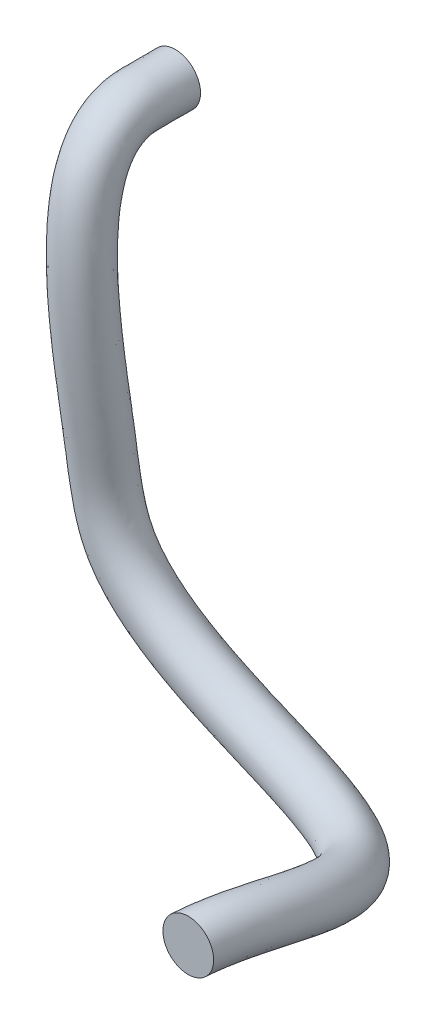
ISO-10303-21;
HEADER;
FILE_DESCRIPTION(('STEP AP214'),'2;1');
FILE_NAME('part.step','',(''),(''),'','','');
FILE_SCHEMA(('AUTOMOTIVE_DESIGN { 1 0 10303 214 1 1 1 1 }'));
ENDSEC;
DATA;
#1=APPLICATION_CONTEXT('core data for automotive mechanical design processes');
#2=APPLICATION_PROTOCOL_DEFINITION('international standard','automotive_design',2000,#1);
#3=PRODUCT_CONTEXT('',#1,'mechanical');
#4=PRODUCT('Part','Part','',(#3));
#5=PRODUCT_RELATED_PRODUCT_CATEGORY('part','',(#4));
#6=PRODUCT_DEFINITION_FORMATION('','',#4);
#7=PRODUCT_DEFINITION_CONTEXT('part definition',#1,'design');
#8=PRODUCT_DEFINITION('design','',#6,#7);
#9=PRODUCT_DEFINITION_SHAPE('','',#8);
#10=(LENGTH_UNIT() NAMED_UNIT(*) SI_UNIT(.MILLI.,.METRE.));
#11=(NAMED_UNIT(*) PLANE_ANGLE_UNIT() SI_UNIT($,.RADIAN.));
#12=(NAMED_UNIT(*) SI_UNIT($,.STERADIAN.) SOLID_ANGLE_UNIT());
#13=UNCERTAINTY_MEASURE_WITH_UNIT(LENGTH_MEASURE(1.E-05),#10,'distance_accuracy_value','');
#14=(GEOMETRIC_REPRESENTATION_CONTEXT(3) GLOBAL_UNCERTAINTY_ASSIGNED_CONTEXT((#13)) GLOBAL_UNIT_ASSIGNED_CONTEXT((#10,
#11,#12)) REPRESENTATION_CONTEXT('',''));
#15=CARTESIAN_POINT('',(0.,0.,0.));
#16=DIRECTION('',(0.,0.,1.));
#17=DIRECTION('',(1.,0.,0.));
#18=AXIS2_PLACEMENT_3D('',#15,#16,#17);
#19=CARTESIAN_POINT('',(3.21,-25.6699939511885,329.985554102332));
#20=CARTESIAN_POINT('',(3.21043225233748,-25.6765205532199,337.751147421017));
#21=CARTESIAN_POINT('',(3.21085902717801,-25.6829644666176,345.760372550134));
#22=CARTESIAN_POINT('',(3.20989937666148,-25.6684746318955,354.426743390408));
#23=CARTESIAN_POINT('',(3.2067920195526,-25.67855524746,354.761847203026));
#24=CARTESIAN_POINT('',(3.20588201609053,-25.732378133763,355.844076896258));
#25=CARTESIAN_POINT('',(3.20638203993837,-25.7741028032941,356.363381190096));
#26=CARTESIAN_POINT('',(3.21038545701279,-25.9381558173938,357.851634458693));
#27=CARTESIAN_POINT('',(3.21633732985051,-26.0982360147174,358.74668638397));
#28=CARTESIAN_POINT('',(3.24132989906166,-26.6929220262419,361.203455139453));
#29=CARTESIAN_POINT('',(3.26699998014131,-27.2347933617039,362.548824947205));
#30=CARTESIAN_POINT('',(3.36985939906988,-29.3138801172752,366.271283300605));
#31=CARTESIAN_POINT('',(3.47773600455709,-31.3697057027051,368.490210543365));
#32=CARTESIAN_POINT('',(4.02168081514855,-41.6694867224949,375.184081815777));
#33=CARTESIAN_POINT('',(4.69871752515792,-54.2138293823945,378.809281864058));
#34=CARTESIAN_POINT('',(5.65077979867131,-77.4912109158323,381.070366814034));
#35=CARTESIAN_POINT('',(5.95515599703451,-85.9548973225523,381.373685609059));
#36=CARTESIAN_POINT('',(6.35692576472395,-103.589374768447,381.298500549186));
#37=CARTESIAN_POINT('',(6.16287645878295,-112.77965979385,380.979855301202));
#38=CARTESIAN_POINT('',(7.4571089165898,-140.337212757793,379.024375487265));
#39=CARTESIAN_POINT('',(8.21719557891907,-158.820918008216,376.816943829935));
#40=CARTESIAN_POINT('',(8.8434836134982,-181.792232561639,374.035794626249));
#41=CARTESIAN_POINT('',(8.9288635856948,-187.957596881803,373.276038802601));
#42=CARTESIAN_POINT('',(9.31846337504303,-200.179826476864,371.947884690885));
#43=CARTESIAN_POINT('',(9.64112176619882,-206.186130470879,371.389169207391));
#44=CARTESIAN_POINT('',(11.1969395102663,-218.542634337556,370.694487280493));
#45=CARTESIAN_POINT('',(12.4811910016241,-224.948523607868,370.630564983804));
#46=CARTESIAN_POINT('',(16.084979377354,-236.721259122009,370.706284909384));
#47=CARTESIAN_POINT('',(18.4173060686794,-242.175910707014,370.760029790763));
#48=CARTESIAN_POINT('',(27.41809768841,-257.879545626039,370.60345970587));
#49=CARTESIAN_POINT('',(35.8881204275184,-267.294619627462,370.236016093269));
#50=CARTESIAN_POINT('',(56.2090553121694,-283.990136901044,369.605042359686));
#51=CARTESIAN_POINT('',(68.0560428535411,-291.273427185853,369.341545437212));
#52=CARTESIAN_POINT('',(106.364837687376,-310.012597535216,369.674750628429));
#53=CARTESIAN_POINT('',(135.526326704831,-318.383433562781,371.315478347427));
#54=CARTESIAN_POINT('',(176.443834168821,-325.037470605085,380.437113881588));
#55=CARTESIAN_POINT('',(189.647283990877,-326.273948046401,384.591802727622));
#56=CARTESIAN_POINT('',(213.841605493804,-326.603730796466,396.496649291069));
#57=CARTESIAN_POINT('',(224.916342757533,-325.678791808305,404.322759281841));
#58=CARTESIAN_POINT('',(242.377412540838,-321.139217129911,425.695845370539));
#59=CARTESIAN_POINT('',(247.559093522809,-317.673272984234,438.337052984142));
#60=CARTESIAN_POINT('',(253.472223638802,-310.747142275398,464.419583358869));
#61=CARTESIAN_POINT('',(254.275477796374,-307.238913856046,478.008988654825));
#62=CARTESIAN_POINT('',(253.679050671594,-298.689219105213,519.2448235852));
#63=CARTESIAN_POINT('',(249.258837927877,-295.70014604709,547.528137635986));
#64=CARTESIAN_POINT('',(245.242610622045,-305.048976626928,594.534293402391));
#65=CARTESIAN_POINT('',(245.124583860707,-316.682075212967,615.199931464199));
#66=CARTESIAN_POINT('',(245.795640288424,-332.705809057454,646.144874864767));
#67=CARTESIAN_POINT('',(246.159134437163,-337.79690306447,656.445365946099));
#68=CARTESIAN_POINT('',(246.83175796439,-345.348386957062,677.587767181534));
#69=CARTESIAN_POINT('',(247.141129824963,-347.811342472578,688.429033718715));
#70=CARTESIAN_POINT('',(247.302935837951,-347.84763795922,705.629611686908));
#71=CARTESIAN_POINT('',(247.304620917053,-347.231969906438,711.493810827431));
#72=CARTESIAN_POINT('',(247.274273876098,-345.641308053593,723.238026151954));
#73=CARTESIAN_POINT('',(247.245119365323,-344.702691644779,729.110694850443));
#74=CARTESIAN_POINT('',(247.186441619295,-342.330612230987,746.676295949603));
#75=CARTESIAN_POINT('',(247.165033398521,-341.080618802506,758.35960171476));
#76=CARTESIAN_POINT('',(247.138608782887,-338.066922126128,793.354541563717));
#77=CARTESIAN_POINT('',(247.171399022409,-337.039642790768,816.610894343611));
#78=CARTESIAN_POINT('',(247.297801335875,-334.829575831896,886.384080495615));
#79=CARTESIAN_POINT('',(247.419442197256,-334.518256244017,932.912679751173));
#80=CARTESIAN_POINT('',(247.111318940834,-326.027834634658,1018.13154382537));
#81=CARTESIAN_POINT('',(246.783206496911,-319.376303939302,1056.57720236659));
#82=CARTESIAN_POINT('',(246.524233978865,-312.227515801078,1132.52994294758));
#83=CARTESIAN_POINT('',(246.593195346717,-311.727919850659,1170.02716730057));
#84=CARTESIAN_POINT('',(247.387181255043,-322.00914261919,1214.07083354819));
#85=CARTESIAN_POINT('',(247.560178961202,-324.282999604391,1221.96972388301));
#86=CARTESIAN_POINT('',(247.449486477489,-328.835579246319,1238.27039071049));
#87=CARTESIAN_POINT('',(247.098014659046,-331.052732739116,1246.75225121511));
#88=CARTESIAN_POINT('',(245.139814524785,-336.539793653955,1272.05879730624));
#89=CARTESIAN_POINT('',(242.867533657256,-338.971010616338,1288.95352730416));
#90=CARTESIAN_POINT('',(239.337856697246,-341.628191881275,1321.83452004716));
#91=CARTESIAN_POINT('',(238.088334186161,-341.846667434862,1337.81030438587));
#92=CARTESIAN_POINT('',(239.062379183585,-340.322180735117,1367.63510600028));
#93=CARTESIAN_POINT('',(241.256820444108,-338.598754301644,1381.41106500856));
#94=CARTESIAN_POINT('',(253.742257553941,-331.994712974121,1413.5917186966));
#95=CARTESIAN_POINT('',(269.198185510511,-325.252924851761,1432.80570935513));
#96=CARTESIAN_POINT('',(307.735376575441,-306.730365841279,1468.94226912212));
#97=CARTESIAN_POINT('',(330.565164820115,-295.044618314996,1485.8114157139));
#98=CARTESIAN_POINT('',(357.123929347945,-277.856593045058,1505.78150539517));
#99=CARTESIAN_POINT('',(362.337830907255,-274.287904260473,1509.7241636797));
#100=CARTESIAN_POINT('',(372.412895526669,-266.887331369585,1517.53349674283));
#101=CARTESIAN_POINT('',(377.332743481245,-263.162502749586,1521.46181289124));
#102=CARTESIAN_POINT('',(390.406182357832,-249.423623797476,1531.93425614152));
#103=CARTESIAN_POINT('',(398.043856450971,-240.216543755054,1539.08954316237));
#104=CARTESIAN_POINT('',(410.023926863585,-221.235193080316,1553.66762006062));
#105=CARTESIAN_POINT('',(414.337366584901,-211.376991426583,1561.09966680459));
#106=CARTESIAN_POINT('',(417.592865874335,-190.676443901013,1576.26596996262));
#107=CARTESIAN_POINT('',(416.421909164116,-179.854814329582,1583.98459029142));
#108=CARTESIAN_POINT('',(409.515999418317,-163.848618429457,1595.20368044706));
#109=CARTESIAN_POINT('',(406.490954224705,-158.610398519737,1598.93603448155));
#110=CARTESIAN_POINT('',(402.855466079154,-153.587130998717,1602.49958725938));
#111=CARTESIAN_POINT('',(7.72603943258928,-25.6699937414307,329.985303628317));
#112=CARTESIAN_POINT('',(7.72647168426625,-25.6765203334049,337.750884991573));
#113=CARTESIAN_POINT('',(7.72689849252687,-25.6829647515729,345.760389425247));
#114=CARTESIAN_POINT('',(7.72593878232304,-25.6684740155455,354.427299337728));
#115=CARTESIAN_POINT('',(7.72282609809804,-25.6794638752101,354.752796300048));
#116=CARTESIAN_POINT('',(7.72187732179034,-25.7338755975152,355.823323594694));
#117=CARTESIAN_POINT('',(7.72234593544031,-25.7757196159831,356.33658887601));
#118=CARTESIAN_POINT('',(7.72621422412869,-25.9395231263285,357.806319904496));
#119=CARTESIAN_POINT('',(7.73202154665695,-26.0986226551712,358.688532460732));
#120=CARTESIAN_POINT('',(7.75639531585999,-26.6875926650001,361.106176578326));
#121=CARTESIAN_POINT('',(7.78139252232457,-27.22175843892,362.424508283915));
#122=CARTESIAN_POINT('',(7.88157970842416,-29.2681179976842,366.071515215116));
#123=CARTESIAN_POINT('',(7.98689017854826,-31.2904474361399,368.250444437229));
#124=CARTESIAN_POINT('',(8.52367620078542,-41.5055787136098,374.858046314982));
#125=CARTESIAN_POINT('',(9.19741370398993,-54.0179073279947,378.458732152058));
#126=CARTESIAN_POINT('',(10.1387216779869,-77.2659180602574,380.619296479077));
#127=CARTESIAN_POINT('',(10.4386230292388,-85.7222396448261,380.879796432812));
#128=CARTESIAN_POINT('',(10.8221436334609,-103.340651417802,380.666441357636));
#129=CARTESIAN_POINT('',(10.5990432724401,-112.516325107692,380.176299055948));
#130=CARTESIAN_POINT('',(11.8924246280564,-140.063796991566,378.219467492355));
#131=CARTESIAN_POINT('',(12.6534894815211,-158.557972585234,376.012748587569));
#132=CARTESIAN_POINT('',(13.2814591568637,-181.590967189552,373.224131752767));
#133=CARTESIAN_POINT('',(13.3678180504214,-187.785121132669,372.461295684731));
#134=CARTESIAN_POINT('',(13.7538181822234,-199.893912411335,371.145543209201));
#135=CARTESIAN_POINT('',(14.0725763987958,-205.773974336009,370.600224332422));
#136=CARTESIAN_POINT('',(15.5814043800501,-217.757262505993,369.926531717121));
#137=CARTESIAN_POINT('',(16.8238032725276,-223.929989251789,369.86658241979));
#138=CARTESIAN_POINT('',(20.2574910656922,-235.145893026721,369.939648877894));
#139=CARTESIAN_POINT('',(22.440568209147,-240.245594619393,369.990252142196));
#140=CARTESIAN_POINT('',(30.9449679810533,-255.083286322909,369.842179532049));
#141=CARTESIAN_POINT('',(39.0314578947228,-264.110209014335,369.491530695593));
#142=CARTESIAN_POINT('',(58.6956725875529,-280.266226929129,368.880798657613));
#143=CARTESIAN_POINT('',(70.2596817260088,-287.388553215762,368.622103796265));
#144=CARTESIAN_POINT('',(107.849121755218,-305.775909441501,368.948800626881));
#145=CARTESIAN_POINT('',(136.687662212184,-314.075595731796,370.561699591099));
#146=CARTESIAN_POINT('',(177.196934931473,-320.66333990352,379.591911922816));
#147=CARTESIAN_POINT('',(190.277747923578,-321.888853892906,383.707029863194));
#148=CARTESIAN_POINT('',(214.254174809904,-322.215670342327,395.504645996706));
#149=CARTESIAN_POINT('',(225.234294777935,-321.300099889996,403.259762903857));
#150=CARTESIAN_POINT('',(242.57146507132,-316.792736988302,424.481190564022));
#151=CARTESIAN_POINT('',(247.75968238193,-313.335866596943,437.094846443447));
#152=CARTESIAN_POINT('',(253.691055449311,-306.388502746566,463.257352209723));
#153=CARTESIAN_POINT('',(254.507028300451,-302.853465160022,476.944621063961));
#154=CARTESIAN_POINT('',(253.904215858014,-294.209343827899,518.635891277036));
#155=CARTESIAN_POINT('',(249.406384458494,-291.077210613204,547.433072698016));
#156=CARTESIAN_POINT('',(245.227576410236,-300.80449112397,596.342084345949));
#157=CARTESIAN_POINT('',(245.133749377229,-312.72414921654,617.377627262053));
#158=CARTESIAN_POINT('',(245.801585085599,-328.6692291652,648.170671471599));
#159=CARTESIAN_POINT('',(246.159806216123,-333.664324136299,658.301236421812));
#160=CARTESIAN_POINT('',(246.811025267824,-340.975375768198,678.7704791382));
#161=CARTESIAN_POINT('',(247.104212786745,-343.296882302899,689.085212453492));
#162=CARTESIAN_POINT('',(247.256853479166,-343.331121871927,705.311481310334));
#163=CARTESIAN_POINT('',(247.259230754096,-342.744800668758,710.977895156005));
#164=CARTESIAN_POINT('',(247.229356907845,-341.17860155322,722.541498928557));
#165=CARTESIAN_POINT('',(247.200073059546,-340.233058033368,728.465193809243));
#166=CARTESIAN_POINT('',(247.140983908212,-337.844361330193,746.153848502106));
#167=CARTESIAN_POINT('',(247.119454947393,-336.586827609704,757.909844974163));
#168=CARTESIAN_POINT('',(247.092888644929,-333.5570447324,793.091577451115));
#169=CARTESIAN_POINT('',(247.125849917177,-332.527282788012,816.430461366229));
#170=CARTESIAN_POINT('',(247.252454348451,-330.313647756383,886.316294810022));
#171=CARTESIAN_POINT('',(247.373366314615,-329.997575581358,932.737121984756));
#172=CARTESIAN_POINT('',(247.067023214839,-321.556206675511,1017.46364116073));
#173=CARTESIAN_POINT('',(246.738820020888,-314.902695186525,1055.91674874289));
#174=CARTESIAN_POINT('',(246.478230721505,-307.709267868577,1132.34376092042));
#175=CARTESIAN_POINT('',(246.545616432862,-307.16471904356,1170.34464746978));
#176=CARTESIAN_POINT('',(247.35514265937,-317.64717410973,1215.25037143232));
#177=CARTESIAN_POINT('',(247.527849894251,-319.940558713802,1223.20967110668));
#178=CARTESIAN_POINT('',(247.417498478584,-324.47895620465,1239.45955832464));
#179=CARTESIAN_POINT('',(247.069895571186,-326.661235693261,1247.81039238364));
#180=CARTESIAN_POINT('',(245.135392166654,-332.08154270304,1272.80909132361));
#181=CARTESIAN_POINT('',(242.888778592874,-334.485763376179,1289.51420139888));
#182=CARTESIAN_POINT('',(239.400032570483,-337.111846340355,1322.01060727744));
#183=CARTESIAN_POINT('',(238.167464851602,-337.326364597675,1337.78984496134));
#184=CARTESIAN_POINT('',(239.127351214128,-335.823552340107,1367.19020242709));
#185=CARTESIAN_POINT('',(241.287260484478,-334.127791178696,1380.73449725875));
#186=CARTESIAN_POINT('',(253.561745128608,-327.635330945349,1412.37143046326));
#187=CARTESIAN_POINT('',(268.827155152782,-320.976184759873,1431.38282692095));
#188=CARTESIAN_POINT('',(307.032361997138,-302.613202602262,1467.20805427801));
#189=CARTESIAN_POINT('',(329.703675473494,-291.007579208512,1483.9620021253));
#190=CARTESIAN_POINT('',(356.035364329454,-273.966656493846,1503.76107722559));
#191=CARTESIAN_POINT('',(361.202321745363,-270.429993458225,1507.66822436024));
#192=CARTESIAN_POINT('',(371.179498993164,-263.101361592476,1515.4016174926));
#193=CARTESIAN_POINT('',(376.074020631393,-259.417063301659,1519.26461172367));
#194=CARTESIAN_POINT('',(388.572381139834,-245.745579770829,1530.01412595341));
#195=CARTESIAN_POINT('',(395.89457359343,-236.681835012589,1537.24353067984));
#196=CARTESIAN_POINT('',(407.330686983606,-218.150688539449,1551.73018994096));
#197=CARTESIAN_POINT('',(411.402484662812,-208.612851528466,1559.00464216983));
#198=CARTESIAN_POINT('',(414.381756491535,-188.744757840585,1573.69682711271));
#199=CARTESIAN_POINT('',(413.204205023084,-178.433475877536,1581.10229608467));
#200=CARTESIAN_POINT('',(406.493312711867,-163.095854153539,1591.92305992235));
#201=CARTESIAN_POINT('',(403.565293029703,-158.025462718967,1595.53604227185));
#202=CARTESIAN_POINT('',(400.042290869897,-153.148422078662,1598.99187803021));
#203=CARTESIAN_POINT('',(12.2142698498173,-23.8109082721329,329.9866115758));
#204=CARTESIAN_POINT('',(12.2147021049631,-23.817434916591,337.752255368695));
#205=CARTESIAN_POINT('',(12.2151287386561,-23.8238766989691,345.760301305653));
#206=CARTESIAN_POINT('',(12.2141693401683,-23.8093906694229,354.424396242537));
#207=CARTESIAN_POINT('',(12.2114909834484,-23.8217771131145,354.799977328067));
#208=CARTESIAN_POINT('',(12.2112228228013,-23.8803719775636,355.931212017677));
#209=CARTESIAN_POINT('',(12.2120957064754,-23.9252504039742,356.475702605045));
#210=CARTESIAN_POINT('',(12.2173899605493,-24.1013572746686,358.040875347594));
#211=CARTESIAN_POINT('',(12.2244297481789,-24.2729166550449,358.9888194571));
#212=CARTESIAN_POINT('',(12.25345842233,-24.9137537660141,361.605280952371));
#213=CARTESIAN_POINT('',(12.28291256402,-25.5029362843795,363.059073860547));
#214=CARTESIAN_POINT('',(12.399841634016,-27.7646910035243,367.074810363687));
#215=CARTESIAN_POINT('',(12.520373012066,-29.9918527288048,369.435331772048));
#216=CARTESIAN_POINT('',(13.0992938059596,-40.7375405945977,376.355942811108));
#217=CARTESIAN_POINT('',(13.7949405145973,-53.4768189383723,379.939961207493));
#218=CARTESIAN_POINT('',(14.7793599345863,-76.936752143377,382.020172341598));
#219=CARTESIAN_POINT('',(15.0956749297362,-85.4458131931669,382.237445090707));
#220=CARTESIAN_POINT('',(15.5231151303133,-103.143807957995,381.878824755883));
#221=CARTESIAN_POINT('',(15.3437477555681,-112.338350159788,381.204516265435));
#222=CARTESIAN_POINT('',(16.6413701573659,-139.965460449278,379.239817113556));
#223=CARTESIAN_POINT('',(17.4038635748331,-158.501815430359,377.029429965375));
#224=CARTESIAN_POINT('',(18.033707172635,-181.603542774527,374.23249162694));
#225=CARTESIAN_POINT('',(18.1211331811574,-187.82422563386,373.466976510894));
#226=CARTESIAN_POINT('',(18.5020070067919,-199.772619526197,372.168733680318));
#227=CARTESIAN_POINT('',(18.8153120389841,-205.484096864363,371.6411688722));
#228=CARTESIAN_POINT('',(20.262667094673,-216.979164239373,370.994931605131));
#229=CARTESIAN_POINT('',(21.4474798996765,-222.846249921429,370.939635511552));
#230=CARTESIAN_POINT('',(24.6924274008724,-233.445716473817,371.009723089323));
#231=CARTESIAN_POINT('',(26.7258657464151,-238.192668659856,371.057140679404));
#232=CARTESIAN_POINT('',(34.7219305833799,-252.143463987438,370.917765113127));
#233=CARTESIAN_POINT('',(42.4086660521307,-260.762124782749,370.584586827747));
#234=CARTESIAN_POINT('',(61.3656729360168,-276.337083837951,369.99565621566));
#235=CARTESIAN_POINT('',(72.6129209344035,-283.276749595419,369.742635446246));
#236=CARTESIAN_POINT('',(109.35088938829,-301.247552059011,370.061659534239));
#237=CARTESIAN_POINT('',(137.744822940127,-309.430700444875,371.649472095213));
#238=CARTESIAN_POINT('',(177.495272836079,-315.894979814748,380.510072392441));
#239=CARTESIAN_POINT('',(190.304785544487,-317.092030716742,384.54540764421));
#240=CARTESIAN_POINT('',(213.678805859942,-317.410634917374,396.046592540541));
#241=CARTESIAN_POINT('',(224.318483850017,-316.518846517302,403.572539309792));
#242=CARTESIAN_POINT('',(241.088718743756,-312.158876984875,424.100013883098));
#243=CARTESIAN_POINT('',(246.188583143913,-308.786805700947,436.413624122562));
#244=CARTESIAN_POINT('',(252.051094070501,-301.920199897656,462.271873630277));
#245=CARTESIAN_POINT('',(252.879393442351,-298.389844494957,475.928966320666));
#246=CARTESIAN_POINT('',(252.274017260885,-289.705962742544,517.811627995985));
#247=CARTESIAN_POINT('',(247.709410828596,-286.406172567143,547.088539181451));
#248=CARTESIAN_POINT('',(243.351965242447,-296.549279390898,598.08833638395));
#249=CARTESIAN_POINT('',(243.283538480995,-308.790635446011,619.548231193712));
#250=CARTESIAN_POINT('',(243.949044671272,-324.678324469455,650.230505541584));
#251=CARTESIAN_POINT('',(244.302289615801,-329.580522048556,660.198706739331));
#252=CARTESIAN_POINT('',(244.93210945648,-336.651197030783,679.994960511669));
#253=CARTESIAN_POINT('',(245.208792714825,-338.828001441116,689.774895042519));
#254=CARTESIAN_POINT('',(245.352039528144,-338.860133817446,705.002558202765));
#255=CARTESIAN_POINT('',(245.355125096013,-338.303896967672,710.466078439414));
#256=CARTESIAN_POINT('',(245.325737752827,-336.762859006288,721.84389426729));
#257=CARTESIAN_POINT('',(245.296323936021,-335.810304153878,727.819319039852));
#258=CARTESIAN_POINT('',(245.236818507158,-333.404793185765,745.632487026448));
#259=CARTESIAN_POINT('',(245.215167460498,-332.139633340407,757.462009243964));
#260=CARTESIAN_POINT('',(245.188457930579,-329.093588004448,792.832584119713));
#261=CARTESIAN_POINT('',(245.221592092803,-328.061326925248,816.254754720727));
#262=CARTESIAN_POINT('',(245.348399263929,-325.84411410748,886.253567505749));
#263=CARTESIAN_POINT('',(245.468569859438,-325.523230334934,932.564217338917));
#264=CARTESIAN_POINT('',(245.164037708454,-317.131762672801,1016.78987481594));
#265=CARTESIAN_POINT('',(244.835743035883,-310.476253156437,1055.25046492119));
#266=CARTESIAN_POINT('',(244.573510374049,-303.237452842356,1132.15954376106));
#267=CARTESIAN_POINT('',(244.639293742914,-302.64719602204,1170.67247278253));
#268=CARTESIAN_POINT('',(245.464619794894,-313.334243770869,1216.45464961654));
#269=CARTESIAN_POINT('',(245.636501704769,-315.643351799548,1224.45898814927));
#270=CARTESIAN_POINT('',(245.526927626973,-320.14962699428,1240.59385491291));
#271=CARTESIAN_POINT('',(245.185483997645,-322.282756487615,1248.75803215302));
#272=CARTESIAN_POINT('',(243.282605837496,-327.614143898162,1273.3464231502));
#273=CARTESIAN_POINT('',(241.064757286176,-329.992412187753,1289.84476796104));
#274=CARTESIAN_POINT('',(237.610051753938,-332.592731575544,1322.02077107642));
#275=CARTESIAN_POINT('',(236.383591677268,-332.808389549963,1337.68593057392));
#276=CARTESIAN_POINT('',(237.338717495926,-331.312675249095,1366.9496249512));
#277=CARTESIAN_POINT('',(239.487477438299,-329.622788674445,1380.47557123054));
#278=CARTESIAN_POINT('',(251.789251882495,-323.115893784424,1412.18284269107));
#279=CARTESIAN_POINT('',(267.039549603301,-316.46374813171,1431.1480904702));
#280=CARTESIAN_POINT('',(305.092041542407,-298.17416946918,1466.83008533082));
#281=CARTESIAN_POINT('',(327.635536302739,-286.628079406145,1483.48547502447));
#282=CARTESIAN_POINT('',(353.710341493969,-269.753456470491,1503.09109971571));
#283=CARTESIAN_POINT('',(358.820871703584,-266.25512386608,1506.95560604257));
#284=CARTESIAN_POINT('',(368.673892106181,-259.01770646,1514.5926921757));
#285=CARTESIAN_POINT('',(373.519818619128,-255.375365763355,1518.37063708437));
#286=CARTESIAN_POINT('',(385.464283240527,-242.022245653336,1529.45815611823));
#287=CARTESIAN_POINT('',(392.475803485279,-233.233669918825,1536.75970134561));
#288=CARTESIAN_POINT('',(403.344525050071,-215.40957692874,1551.09086015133));
#289=CARTESIAN_POINT('',(407.149848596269,-206.326266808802,1558.14445113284));
#290=CARTESIAN_POINT('',(409.855299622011,-187.606664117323,1572.1904265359));
#291=CARTESIAN_POINT('',(408.708319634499,-177.985855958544,1579.17509942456));
#292=CARTESIAN_POINT('',(402.311008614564,-163.544566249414,1589.46579929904));
#293=CARTESIAN_POINT('',(399.514698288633,-158.701739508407,1592.91692187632));
#294=CARTESIAN_POINT('',(396.141621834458,-154.023636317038,1596.22607211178));
#295=CARTESIAN_POINT('',(18.6009140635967,-17.4242659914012,329.99160580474));
#296=CARTESIAN_POINT('',(18.6013463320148,-17.4307928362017,337.757487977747));
#297=CARTESIAN_POINT('',(18.6017722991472,-17.4372245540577,345.759964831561));
#298=CARTESIAN_POINT('',(18.600814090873,-17.4227564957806,354.413311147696));
#299=CARTESIAN_POINT('',(18.5996384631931,-17.4381222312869,354.980163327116));
#300=CARTESIAN_POINT('',(18.6017860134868,-17.5099100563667,356.343355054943));
#301=CARTESIAN_POINT('',(18.6041105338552,-17.5649740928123,357.007194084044));
#302=CARTESIAN_POINT('',(18.6145737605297,-17.7838465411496,358.937288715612));
#303=CARTESIAN_POINT('',(18.6261366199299,-18.0001714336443,360.13672363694));
#304=CARTESIAN_POINT('',(18.6723942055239,-18.8306231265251,363.51444526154));
#305=CARTESIAN_POINT('',(18.7185053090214,-19.6242195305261,365.487673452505));
#306=CARTESIAN_POINT('',(18.8982933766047,-22.6913902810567,370.921034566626));
#307=CARTESIAN_POINT('',(19.0762464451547,-25.6892185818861,373.985387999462));
#308=CARTESIAN_POINT('',(19.8142332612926,-38.4268630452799,382.153839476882));
#309=CARTESIAN_POINT('',(20.5917445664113,-52.009825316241,385.729627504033));
#310=CARTESIAN_POINT('',(21.7457762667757,-76.2565318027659,387.734837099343));
#311=CARTESIAN_POINT('',(22.1274278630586,-84.9615019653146,387.889246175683));
#312=CARTESIAN_POINT('',(22.7422463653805,-102.965024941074,387.307926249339));
#313=CARTESIAN_POINT('',(22.771220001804,-112.253610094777,386.343933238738));
#314=CARTESIAN_POINT('',(24.0851141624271,-140.174469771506,384.354909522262));
#315=CARTESIAN_POINT('',(24.8505588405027,-158.834785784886,382.130495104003));
#316=CARTESIAN_POINT('',(25.4834767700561,-182.049275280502,379.319904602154));
#317=CARTESIAN_POINT('',(25.5726108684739,-188.303515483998,378.551346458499));
#318=CARTESIAN_POINT('',(25.943073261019,-199.927761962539,377.288452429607));
#319=CARTESIAN_POINT('',(26.2454449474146,-205.312573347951,376.79508616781));
#320=CARTESIAN_POINT('',(27.5755974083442,-215.876854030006,376.201189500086));
#321=CARTESIAN_POINT('',(28.6462860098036,-221.160275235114,376.153932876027));
#322=CARTESIAN_POINT('',(31.5830423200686,-230.755716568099,376.219093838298));
#323=CARTESIAN_POINT('',(33.4009154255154,-235.00074471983,376.261850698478));
#324=CARTESIAN_POINT('',(40.6434463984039,-247.636611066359,376.135357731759));
#325=CARTESIAN_POINT('',(47.7239438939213,-255.629044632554,375.828607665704));
#326=CARTESIAN_POINT('',(65.5648721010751,-270.286851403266,375.274089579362));
#327=CARTESIAN_POINT('',(76.2898858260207,-276.920939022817,375.030957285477));
#328=CARTESIAN_POINT('',(111.541445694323,-294.164354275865,375.336639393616));
#329=CARTESIAN_POINT('',(139.053888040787,-302.089451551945,376.893928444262));
#330=CARTESIAN_POINT('',(177.013971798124,-308.262169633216,385.354695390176));
#331=CARTESIAN_POINT('',(189.136741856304,-309.383366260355,389.195089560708));
#332=CARTESIAN_POINT('',(210.877063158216,-309.679690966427,399.892384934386));
#333=CARTESIAN_POINT('',(220.536432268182,-308.850865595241,406.773034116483));
#334=CARTESIAN_POINT('',(235.606834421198,-304.932822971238,425.219841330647));
#335=CARTESIAN_POINT('',(240.390101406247,-301.833920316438,436.557787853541));
#336=CARTESIAN_POINT('',(245.979559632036,-295.287214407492,461.21085436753));
#337=CARTESIAN_POINT('',(246.824767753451,-291.826562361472,474.568553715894));
#338=CARTESIAN_POINT('',(246.223354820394,-283.194942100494,516.197844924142));
#339=CARTESIAN_POINT('',(241.584588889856,-279.605308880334,546.095069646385));
#340=CARTESIAN_POINT('',(236.938619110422,-290.420032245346,600.471772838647));
#341=CARTESIAN_POINT('',(236.909052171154,-303.193420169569,622.64966285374));
#342=CARTESIAN_POINT('',(237.572997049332,-319.0412580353,653.255200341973));
#343=CARTESIAN_POINT('',(237.919692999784,-323.816316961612,663.005474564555));
#344=CARTESIAN_POINT('',(238.518807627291,-330.542074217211,681.836080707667));
#345=CARTESIAN_POINT('',(238.771161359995,-332.504671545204,690.831851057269));
#346=CARTESIAN_POINT('',(238.900467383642,-332.533676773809,704.577554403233));
#347=CARTESIAN_POINT('',(238.904601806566,-332.022097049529,709.739631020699));
#348=CARTESIAN_POINT('',(238.875939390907,-330.518571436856,720.84041999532));
#349=CARTESIAN_POINT('',(238.846337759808,-329.555784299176,726.891503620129));
#350=CARTESIAN_POINT('',(238.786225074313,-327.125744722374,744.886313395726));
#351=CARTESIAN_POINT('',(238.764396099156,-325.849466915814,756.823042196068));
#352=CARTESIAN_POINT('',(238.737477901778,-322.779726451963,792.468774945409));
#353=CARTESIAN_POINT('',(238.770863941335,-321.74384514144,816.012003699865));
#354=CARTESIAN_POINT('',(238.897963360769,-319.521477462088,886.173647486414));
#355=CARTESIAN_POINT('',(239.017044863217,-319.193569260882,932.32134179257));
#356=CARTESIAN_POINT('',(238.715173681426,-310.875425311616,1015.81104481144));
#357=CARTESIAN_POINT('',(238.386746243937,-304.217013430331,1054.28244204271));
#358=CARTESIAN_POINT('',(238.122101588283,-296.911618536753,1131.89905410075));
#359=CARTESIAN_POINT('',(238.185531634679,-296.254243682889,1171.1637130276));
#360=CARTESIAN_POINT('',(239.034055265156,-307.241677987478,1218.23271256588));
#361=CARTESIAN_POINT('',(239.203682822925,-309.565746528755,1226.27095747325));
#362=CARTESIAN_POINT('',(239.096097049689,-313.990034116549,1242.11224586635));
#363=CARTESIAN_POINT('',(238.76807498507,-316.024063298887,1249.89724114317));
#364=CARTESIAN_POINT('',(236.92644771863,-321.183486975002,1273.69176766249));
#365=CARTESIAN_POINT('',(234.75608301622,-323.526591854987,1289.85903754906));
#366=CARTESIAN_POINT('',(231.336457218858,-326.100600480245,1321.70351301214));
#367=CARTESIAN_POINT('',(230.097069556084,-326.328088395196,1337.36986526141));
#368=CARTESIAN_POINT('',(231.064158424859,-324.813409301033,1367.0129599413));
#369=CARTESIAN_POINT('',(233.243680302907,-323.088373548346,1380.93920053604));
#370=CARTESIAN_POINT('',(246.061110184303,-316.308728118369,1413.97555077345));
#371=CARTESIAN_POINT('',(261.640527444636,-309.515347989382,1433.18744923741));
#372=CARTESIAN_POINT('',(299.832355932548,-291.158783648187,1469.00005261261));
#373=CARTESIAN_POINT('',(322.253695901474,-279.656964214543,1485.54725625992));
#374=CARTESIAN_POINT('',(347.90016252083,-263.059437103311,1504.83033676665));
#375=CARTESIAN_POINT('',(352.9107328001,-259.628732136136,1508.61937852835));
#376=CARTESIAN_POINT('',(362.533003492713,-252.560787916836,1516.07749454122));
#377=CARTESIAN_POINT('',(367.26264050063,-248.981526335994,1519.69390756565));
#378=CARTESIAN_POINT('',(378.454425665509,-236.587310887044,1531.38845552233));
#379=CARTESIAN_POINT('',(385.029635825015,-228.45737143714,1538.78959450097));
#380=CARTESIAN_POINT('',(395.037071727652,-212.161858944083,1552.7693873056));
#381=CARTESIAN_POINT('',(398.410242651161,-203.999286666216,1559.37942765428));
#382=CARTESIAN_POINT('',(400.727473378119,-187.560265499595,1572.15367192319));
#383=CARTESIAN_POINT('',(399.698707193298,-179.290793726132,1578.31905813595));
#384=CARTESIAN_POINT('',(393.988628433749,-166.5915859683,1587.58544587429));
#385=CARTESIAN_POINT('',(391.450737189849,-162.194870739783,1590.71926394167));
#386=CARTESIAN_POINT('',(388.36773873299,-157.907737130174,1593.73992946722));
#387=CARTESIAN_POINT('',(20.459999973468,-12.9360370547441,329.995261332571));
#388=CARTESIAN_POINT('',(20.4604322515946,-12.9425640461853,337.761317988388));
#389=CARTESIAN_POINT('',(20.4608577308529,-12.9489883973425,345.759718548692));
#390=CARTESIAN_POINT('',(20.4599003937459,-12.934533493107,354.405197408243));
#391=CARTESIAN_POINT('',(20.4597839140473,-12.9514635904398,355.112058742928));
#392=CARTESIAN_POINT('',(20.4636516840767,-13.0321799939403,356.645071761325));
#393=CARTESIAN_POINT('',(20.4670146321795,-13.0943325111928,357.396298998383));
#394=CARTESIAN_POINT('',(20.4811890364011,-13.3434038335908,359.593626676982));
#395=CARTESIAN_POINT('',(20.496014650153,-13.5917587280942,360.977272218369));
#396=CARTESIAN_POINT('',(20.554740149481,-14.5587902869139,364.912748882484));
#397=CARTESIAN_POINT('',(20.6129487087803,-15.5005250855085,367.266752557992));
#398=CARTESIAN_POINT('',(20.8384668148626,-19.1527570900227,373.740279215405));
#399=CARTESIAN_POINT('',(21.0582670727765,-22.7116740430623,377.322538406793));
#400=CARTESIAN_POINT('',(21.9122056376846,-36.8984523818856,386.418137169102));
#401=CARTESIAN_POINT('',(22.7491682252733,-51.0929535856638,390.002412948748));
#402=CARTESIAN_POINT('',(24.0286563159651,-75.9096660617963,392.013436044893));
#403=CARTESIAN_POINT('',(24.4588285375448,-84.75659949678,392.148595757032));
#404=CARTESIAN_POINT('',(25.215951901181,-102.984186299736,391.491212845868));
#405=CARTESIAN_POINT('',(25.4082506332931,-112.347366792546,390.423485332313));
#406=CARTESIAN_POINT('',(26.7340753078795,-140.480528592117,388.418154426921));
#407=CARTESIAN_POINT('',(27.5010245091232,-159.22186291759,386.183467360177));
#408=CARTESIAN_POINT('',(28.135123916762,-182.479687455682,383.367630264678));
#409=CARTESIAN_POINT('',(28.2248884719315,-188.740749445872,382.598726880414));
#410=CARTESIAN_POINT('',(28.5901298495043,-200.203241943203,381.3534543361));
#411=CARTESIAN_POINT('',(28.8870887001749,-205.431983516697,380.876321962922));
#412=CARTESIAN_POINT('',(30.1622332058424,-215.559429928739,380.306988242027));
#413=CARTESIAN_POINT('',(31.1770864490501,-220.568421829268,380.263068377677));
#414=CARTESIAN_POINT('',(33.9962896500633,-229.78245778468,380.326311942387));
#415=CARTESIAN_POINT('',(35.7495637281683,-233.881402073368,380.367622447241));
#416=CARTESIAN_POINT('',(42.7515359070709,-246.097332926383,380.24523570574));
#417=CARTESIAN_POINT('',(49.6292829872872,-253.875657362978,379.947280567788));
#418=CARTESIAN_POINT('',(67.0682129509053,-268.203018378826,379.40516167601));
#419=CARTESIAN_POINT('',(77.5909693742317,-274.716070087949,379.166182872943));
#420=CARTESIAN_POINT('',(112.216745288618,-291.653131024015,379.466277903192));
#421=CARTESIAN_POINT('',(139.297731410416,-299.43830412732,381.018317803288));
#422=CARTESIAN_POINT('',(176.237296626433,-305.444721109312,389.251325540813));
#423=CARTESIAN_POINT('',(187.948853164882,-306.518993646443,392.977761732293));
#424=CARTESIAN_POINT('',(208.667942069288,-306.801388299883,403.172549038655));
#425=CARTESIAN_POINT('',(217.693480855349,-306.011356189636,409.641044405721));
#426=CARTESIAN_POINT('',(231.641452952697,-302.385125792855,426.713949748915));
#427=CARTESIAN_POINT('',(236.198424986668,-299.47291053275,437.382286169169));
#428=CARTESIAN_POINT('',(241.585374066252,-293.16337658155,461.141847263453));
#429=CARTESIAN_POINT('',(242.435060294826,-289.767316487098,474.232173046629));
#430=CARTESIAN_POINT('',(241.840149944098,-281.227396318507,515.418262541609));
#431=CARTESIAN_POINT('',(237.194456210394,-277.517361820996,545.452251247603));
#432=CARTESIAN_POINT('',(232.440376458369,-288.583739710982,601.094280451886));
#433=CARTESIAN_POINT('',(232.424029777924,-301.56418537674,623.561392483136));
#434=CARTESIAN_POINT('',(233.088752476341,-317.429808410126,654.201435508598));
#435=CARTESIAN_POINT('',(233.433915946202,-322.171408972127,663.897488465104));
#436=CARTESIAN_POINT('',(234.0239136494,-328.794749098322,682.441382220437));
#437=CARTESIAN_POINT('',(234.268591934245,-330.689160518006,691.192615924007));
#438=CARTESIAN_POINT('',(234.39343689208,-330.717165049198,704.464090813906));
#439=CARTESIAN_POINT('',(234.397905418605,-330.219883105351,709.529473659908));
#440=CARTESIAN_POINT('',(234.369476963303,-328.728477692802,720.540729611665));
#441=CARTESIAN_POINT('',(234.339818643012,-327.762532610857,726.615276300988));
#442=CARTESIAN_POINT('',(234.279518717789,-325.324929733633,744.666096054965));
#443=CARTESIAN_POINT('',(234.257634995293,-324.045228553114,756.635845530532));
#444=CARTESIAN_POINT('',(234.230652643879,-320.968201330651,792.366199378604));
#445=CARTESIAN_POINT('',(234.264116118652,-319.931221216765,815.946454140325));
#446=CARTESIAN_POINT('',(234.391303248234,-317.707308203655,886.156946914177));
#447=CARTESIAN_POINT('',(234.510043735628,-317.377230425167,932.252866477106));
#448=CARTESIAN_POINT('',(234.209006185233,-309.082057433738,1015.51200862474));
#449=CARTESIAN_POINT('',(233.880538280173,-302.422759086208,1053.98666391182));
#450=CARTESIAN_POINT('',(233.615139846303,-295.096552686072,1131.82438564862));
#451=CARTESIAN_POINT('',(233.677833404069,-294.418181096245,1171.32410299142));
#452=CARTESIAN_POINT('',(234.533611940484,-305.499559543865,1218.79554831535));
#453=CARTESIAN_POINT('',(234.701824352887,-307.822773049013,1226.82245194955));
#454=CARTESIAN_POINT('',(234.595437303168,-312.197700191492,1242.48699023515));
#455=CARTESIAN_POINT('',(234.274594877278,-314.182389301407,1250.08179530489));
#456=CARTESIAN_POINT('',(232.462216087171,-319.259827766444,1273.49765377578));
#457=CARTESIAN_POINT('',(230.310277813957,-321.593938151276,1289.54265270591));
#458=CARTESIAN_POINT('',(226.891475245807,-324.167561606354,1321.37804477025));
#459=CARTESIAN_POINT('',(225.633131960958,-324.405666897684,1337.15966061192));
#460=CARTESIAN_POINT('',(226.616870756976,-322.865041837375,1367.31648240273));
#461=CARTESIAN_POINT('',(228.838114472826,-321.099198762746,1381.65890091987));
#462=CARTESIAN_POINT('',(242.140734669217,-314.062916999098,1415.94580742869));
#463=CARTESIAN_POINT('',(258.062357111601,-307.122171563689,1435.44898642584));
#464=CARTESIAN_POINT('',(296.545379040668,-288.625630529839,1471.53462654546));
#465=CARTESIAN_POINT('',(318.973135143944,-277.108275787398,1488.07286849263));
#466=CARTESIAN_POINT('',(344.450784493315,-260.619838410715,1507.22884139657));
#467=CARTESIAN_POINT('',(349.418437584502,-257.218014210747,1510.98552409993));
#468=CARTESIAN_POINT('',(358.935536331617,-250.22728512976,1518.36207905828));
#469=CARTESIAN_POINT('',(363.598195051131,-246.668756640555,1521.90300420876));
#470=CARTESIAN_POINT('',(374.595831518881,-234.909177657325,1533.86283829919));
#471=CARTESIAN_POINT('',(381.048090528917,-227.158649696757,1541.29081725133));
#472=CARTESIAN_POINT('',(390.766936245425,-211.675251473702,1555.07690815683));
#473=CARTESIAN_POINT('',(393.977089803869,-203.973220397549,1561.46699043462));
#474=CARTESIAN_POINT('',(396.182311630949,-188.65224632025,1573.62354421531));
#475=CARTESIAN_POINT('',(395.24045982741,-181.035315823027,1579.39548486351));
#476=CARTESIAN_POINT('',(389.899800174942,-169.171130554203,1588.17393197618));
#477=CARTESIAN_POINT('',(387.487027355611,-164.990215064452,1591.15425921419));
#478=CARTESIAN_POINT('',(384.54239493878,-160.892706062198,1594.03490199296));
#479=CARTESIAN_POINT('',(20.459999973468,-3.90396134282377,330.002825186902));
#480=CARTESIAN_POINT('',(20.4604322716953,-3.91048863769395,337.769242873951));
#481=CARTESIAN_POINT('',(20.4608567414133,-3.91689774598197,345.759208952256));
#482=CARTESIAN_POINT('',(20.4599012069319,-3.90247005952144,354.388408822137));
#483=CARTESIAN_POINT('',(20.4619205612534,-3.92179502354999,355.384982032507));
#484=CARTESIAN_POINT('',(20.4692822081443,-4.01999141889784,357.269436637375));
#485=CARTESIAN_POINT('',(20.4747609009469,-4.09630986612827,358.201526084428));
#486=CARTESIAN_POINT('',(20.4965155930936,-4.40635985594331,360.951975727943));
#487=CARTESIAN_POINT('',(20.5180268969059,-4.71998408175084,362.716961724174));
#488=CARTESIAN_POINT('',(20.6023553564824,-5.96660315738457,367.807272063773));
#489=CARTESIAN_POINT('',(20.6854661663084,-7.21283396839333,370.949944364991));
#490=CARTESIAN_POINT('',(21.0052247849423,-12.0695506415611,379.579197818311));
#491=CARTESIAN_POINT('',(21.3113638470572,-16.7853470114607,384.236821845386));
#492=CARTESIAN_POINT('',(22.404573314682,-33.9584768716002,395.269672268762));
#493=CARTESIAN_POINT('',(23.3639083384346,-49.410155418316,398.891336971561));
#494=CARTESIAN_POINT('',(24.9047730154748,-75.398274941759,400.997333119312));
#495=CARTESIAN_POINT('',(25.4362948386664,-84.5369953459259,401.129227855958));
#496=CARTESIAN_POINT('',(26.4949094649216,-103.228795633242,400.433240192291));
#497=CARTESIAN_POINT('',(27.0399489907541,-112.754195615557,399.298831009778));
#498=CARTESIAN_POINT('',(28.3904876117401,-141.322943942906,397.26180347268));
#499=CARTESIAN_POINT('',(29.1596541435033,-160.218644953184,395.005853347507));
#500=CARTESIAN_POINT('',(29.7947380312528,-183.512579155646,392.185644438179));
#501=CARTESIAN_POINT('',(29.884960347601,-189.763519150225,391.418598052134));
#502=CARTESIAN_POINT('',(30.2426770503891,-200.994474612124,390.198512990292));
#503=CARTESIAN_POINT('',(30.53197416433,-206.013724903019,389.742951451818));
#504=CARTESIAN_POINT('',(31.7353486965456,-215.571271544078,389.205659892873));
#505=CARTESIAN_POINT('',(32.6725111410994,-220.221162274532,389.165163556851));
#506=CARTESIAN_POINT('',(35.3960673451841,-229.128955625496,389.226746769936));
#507=CARTESIAN_POINT('',(37.1429852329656,-233.227972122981,389.267749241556));
#508=CARTESIAN_POINT('',(44.072083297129,-245.316199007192,389.146586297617));
#509=CARTESIAN_POINT('',(50.8595460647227,-252.985207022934,388.85241675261));
#510=CARTESIAN_POINT('',(68.0335428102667,-267.09451755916,388.318481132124));
#511=CARTESIAN_POINT('',(78.3837052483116,-273.497344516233,388.083882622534));
#512=CARTESIAN_POINT('',(112.346091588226,-290.109352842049,388.378125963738));
#513=CARTESIAN_POINT('',(138.826358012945,-297.671886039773,389.94265661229));
#514=CARTESIAN_POINT('',(174.050432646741,-303.398558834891,397.793061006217));
#515=CARTESIAN_POINT('',(185.0360620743,-304.387484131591,401.322950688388));
#516=CARTESIAN_POINT('',(203.880540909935,-304.644303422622,410.59532738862));
#517=CARTESIAN_POINT('',(211.708948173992,-303.924577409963,416.293220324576));
#518=CARTESIAN_POINT('',(223.500792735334,-300.858902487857,430.726934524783));
#519=CARTESIAN_POINT('',(227.596955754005,-298.314858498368,440.070577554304));
#520=CARTESIAN_POINT('',(232.561264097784,-292.500197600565,461.965801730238));
#521=CARTESIAN_POINT('',(233.40942552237,-289.256331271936,474.436994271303));
#522=CARTESIAN_POINT('',(232.83289068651,-280.979173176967,514.353893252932));
#523=CARTESIAN_POINT('',(228.237556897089,-277.145359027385,544.237403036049));
#524=CARTESIAN_POINT('',(223.400603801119,-288.404646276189,600.849386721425));
#525=CARTESIAN_POINT('',(223.390813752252,-301.564379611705,623.592087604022));
#526=CARTESIAN_POINT('',(224.059769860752,-317.530952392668,654.427406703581));
#527=CARTESIAN_POINT('',(224.406217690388,-322.284749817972,664.155116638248));
#528=CARTESIAN_POINT('',(224.995600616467,-328.901167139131,682.679695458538));
#529=CARTESIAN_POINT('',(225.238240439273,-330.775541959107,691.375019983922));
#530=CARTESIAN_POINT('',(225.361700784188,-330.803235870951,704.49930543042));
#531=CARTESIAN_POINT('',(225.36626822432,-330.310414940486,709.533953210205));
#532=CARTESIAN_POINT('',(225.337918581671,-328.823134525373,720.514657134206));
#533=CARTESIAN_POINT('',(225.308253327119,-327.856573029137,726.594149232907));
#534=CARTESIAN_POINT('',(225.247917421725,-325.417516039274,744.655742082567));
#535=CARTESIAN_POINT('',(225.226023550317,-324.137172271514,756.631723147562));
#536=CARTESIAN_POINT('',(225.199029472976,-321.058807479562,792.377623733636));
#537=CARTESIAN_POINT('',(225.232507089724,-320.021672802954,815.964018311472));
#538=CARTESIAN_POINT('',(225.359703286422,-317.797605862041,886.179494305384));
#539=CARTESIAN_POINT('',(225.478361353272,-317.46709921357,932.260504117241));
#540=CARTESIAN_POINT('',(225.177526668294,-309.17751620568,1015.46353928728));
#541=CARTESIAN_POINT('',(224.849052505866,-302.518074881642,1053.93858008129));
#542=CARTESIAN_POINT('',(224.583476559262,-295.18696788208,1131.82836168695));
#543=CARTESIAN_POINT('',(224.645993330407,-294.503582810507,1171.38386127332));
#544=CARTESIAN_POINT('',(225.503497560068,-305.607307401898,1218.95103328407));
#545=CARTESIAN_POINT('',(225.669102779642,-307.912623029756,1226.90506909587));
#546=CARTESIAN_POINT('',(225.564845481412,-312.199966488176,1242.25598408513));
#547=CARTESIAN_POINT('',(225.255246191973,-314.114254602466,1249.57659777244));
#548=CARTESIAN_POINT('',(223.482095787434,-319.082007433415,1272.48545663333));
#549=CARTESIAN_POINT('',(221.345975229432,-321.4203818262,1288.44148476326));
#550=CARTESIAN_POINT('',(217.894921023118,-324.018992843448,1320.57719965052));
#551=CARTESIAN_POINT('',(216.584385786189,-324.281742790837,1336.75359560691));
#552=CARTESIAN_POINT('',(217.613360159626,-322.670948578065,1368.29585875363));
#553=CARTESIAN_POINT('',(219.947171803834,-320.800066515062,1383.66770727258));
#554=CARTESIAN_POINT('',(234.400943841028,-313.154895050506,1420.92165597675));
#555=CARTESIAN_POINT('',(251.169047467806,-305.849130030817,1441.1788401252));
#556=CARTESIAN_POINT('',(290.51308947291,-286.938703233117,1478.07185338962));
#557=CARTESIAN_POINT('',(313.085042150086,-275.323708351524,1494.68749465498));
#558=CARTESIAN_POINT('',(338.411080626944,-258.932938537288,1513.72935036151));
#559=CARTESIAN_POINT('',(343.331257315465,-255.56270276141,1517.45033235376));
#560=CARTESIAN_POINT('',(352.717801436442,-248.667762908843,1524.72566520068));
#561=CARTESIAN_POINT('',(357.266654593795,-245.117381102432,1528.1687936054));
#562=CARTESIAN_POINT('',(368.349998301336,-234.579107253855,1540.43295427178));
#563=CARTESIAN_POINT('',(374.81618495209,-227.473361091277,1547.85354464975));
#564=CARTESIAN_POINT('',(384.404902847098,-213.251293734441,1561.32556425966));
#565=CARTESIAN_POINT('',(387.487184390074,-206.210653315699,1567.40356024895));
#566=CARTESIAN_POINT('',(389.695834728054,-192.450000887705,1578.70985104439));
#567=CARTESIAN_POINT('',(388.934352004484,-185.723453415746,1583.94944807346));
#568=CARTESIAN_POINT('',(384.175550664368,-174.985795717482,1592.07595171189));
#569=CARTESIAN_POINT('',(381.934186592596,-171.100120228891,1594.84628597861));
#570=CARTESIAN_POINT('',(379.174814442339,-167.263071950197,1597.53438380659));
#571=CARTESIAN_POINT('',(18.6009140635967,0.584267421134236,330.006686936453));
#572=CARTESIAN_POINT('',(18.6013463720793,0.577739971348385,337.773288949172));
#573=CARTESIAN_POINT('',(18.6017703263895,0.571338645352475,345.758948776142));
#574=CARTESIAN_POINT('',(18.6008157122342,0.585752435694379,354.379837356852));
#575=CARTESIAN_POINT('',(18.6038986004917,0.565611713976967,355.52432929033));
#576=CARTESIAN_POINT('',(18.6130123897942,0.4589715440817,357.588240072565));
#577=CARTESIAN_POINT('',(18.6195553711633,0.375662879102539,358.61268980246));
#578=CARTESIAN_POINT('',(18.6451324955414,0.0352085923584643,361.645622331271));
#579=CARTESIAN_POINT('',(18.6700255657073,-0.311253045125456,363.605389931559));
#580=CARTESIAN_POINT('',(18.7673314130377,-1.69915811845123,369.285667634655));
#581=CARTESIAN_POINT('',(18.8630936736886,-3.09987151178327,372.831376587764));
#582=CARTESIAN_POINT('',(19.2307824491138,-8.56859458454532,382.56291668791));
#583=CARTESIAN_POINT('',(19.5808814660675,-13.873057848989,387.771377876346));
#584=CARTESIAN_POINT('',(20.7959366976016,-32.5650159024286,399.802403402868));
#585=CARTESIAN_POINT('',(21.8174393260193,-48.6545913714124,403.452739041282));
#586=CARTESIAN_POINT('',(23.4926146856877,-75.2368986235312,405.647309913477));
#587=CARTESIAN_POINT('',(24.076341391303,-84.5236459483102,405.7952091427));
#588=CARTESIAN_POINT('',(25.2922858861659,-103.452737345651,405.136917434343));
#589=CARTESIAN_POINT('',(26.0245689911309,-113.064762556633,404.03997169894));
#590=CARTESIAN_POINT('',(27.3877388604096,-141.854113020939,401.987749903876));
#591=CARTESIAN_POINT('',(28.157604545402,-160.822211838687,399.720940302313));
#592=CARTESIAN_POINT('',(28.7924853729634,-184.108698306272,396.901633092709));
#593=CARTESIAN_POINT('',(28.882532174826,-190.342756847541,396.13677751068));
#594=CARTESIAN_POINT('',(29.2379915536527,-201.505355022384,394.924103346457));
#595=CARTESIAN_POINT('',(29.5250869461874,-206.472473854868,394.473745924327));
#596=CARTESIAN_POINT('',(30.7121414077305,-215.900464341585,393.943736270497));
#597=CARTESIAN_POINT('',(31.6279268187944,-220.467894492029,393.903305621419));
#598=CARTESIAN_POINT('',(34.3739781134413,-229.452736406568,393.965156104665));
#599=CARTESIAN_POINT('',(36.1791779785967,-233.697908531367,394.007298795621));
#600=CARTESIAN_POINT('',(43.2764094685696,-246.079153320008,393.883245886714));
#601=CARTESIAN_POINT('',(50.1768942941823,-253.853627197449,393.584043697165));
#602=CARTESIAN_POINT('',(67.4895874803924,-268.076675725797,393.045841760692));
#603=CARTESIAN_POINT('',(77.8704760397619,-274.49099258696,392.811443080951));
#604=CARTESIAN_POINT('',(111.799341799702,-291.086304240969,393.10545784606));
#605=CARTESIAN_POINT('',(138.114043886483,-298.567492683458,394.68765147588));
#606=CARTESIAN_POINT('',(172.653710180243,-304.18244500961,402.385567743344));
#607=CARTESIAN_POINT('',(183.329096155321,-305.133472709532,405.83407919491));
#608=CARTESIAN_POINT('',(201.331740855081,-305.378804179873,414.692233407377));
#609=CARTESIAN_POINT('',(208.604218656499,-304.690158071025,420.036422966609));
#610=CARTESIAN_POINT('',(219.375642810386,-301.889774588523,433.22109959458));
#611=CARTESIAN_POINT('',(223.240129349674,-299.524947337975,441.91781657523));
#612=CARTESIAN_POINT('',(227.986908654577,-293.964940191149,462.85368952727));
#613=CARTESIAN_POINT('',(228.829076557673,-290.807738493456,474.976934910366));
#614=CARTESIAN_POINT('',(228.26430150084,-282.700024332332,514.075660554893));
#615=CARTESIAN_POINT('',(223.725945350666,-278.863594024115,543.67285405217));
#616=CARTESIAN_POINT('',(218.914739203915,-290.062948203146,599.983493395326));
#617=CARTESIAN_POINT('',(218.898245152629,-303.193807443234,622.710864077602));
#618=CARTESIAN_POINT('',(219.570630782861,-319.242923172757,653.705751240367));
#619=CARTESIAN_POINT('',(219.91988754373,-324.042300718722,663.519144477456));
#620=CARTESIAN_POINT('',(220.517776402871,-330.754254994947,682.311239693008));
#621=CARTESIAN_POINT('',(220.76606576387,-332.676902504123,691.195535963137));
#622=CARTESIAN_POINT('',(220.892611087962,-332.705288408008,704.647766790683));
#623=CARTESIAN_POINT('',(220.89694272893,-332.202603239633,709.748562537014));
#624=CARTESIAN_POINT('',(220.868437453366,-330.707302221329,720.788435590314));
#625=CARTESIAN_POINT('',(220.838821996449,-329.743286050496,726.849379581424));
#626=CARTESIAN_POINT('',(220.778637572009,-327.310347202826,744.865669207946));
#627=CARTESIAN_POINT('',(220.756788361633,-326.032788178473,756.814822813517));
#628=CARTESIAN_POINT('',(220.729846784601,-322.960380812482,792.491553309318));
#629=CARTESIAN_POINT('',(220.76326102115,-321.924191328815,816.04702387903));
#630=CARTESIAN_POINT('',(220.890378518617,-319.701516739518,886.218603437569));
#631=CARTESIAN_POINT('',(221.009295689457,-319.372753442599,932.336570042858));
#632=CARTESIAN_POINT('',(220.707828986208,-311.065755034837,1015.71440460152));
#633=CARTESIAN_POINT('',(220.379389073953,-304.407058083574,1054.18657046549));
#634=CARTESIAN_POINT('',(220.1143904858,-297.091892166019,1131.90698170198));
#635=CARTESIAN_POINT('',(220.177468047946,-296.424521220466,1171.28286161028));
#636=CARTESIAN_POINT('',(221.029432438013,-307.456510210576,1218.54272505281));
#637=CARTESIAN_POINT('',(221.193861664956,-309.744893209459,1226.43568302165));
#638=CARTESIAN_POINT('',(221.090522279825,-313.994552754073,1241.65165606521));
#639=CARTESIAN_POINT('',(220.78491725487,-315.888213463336,1248.88995700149));
#640=CARTESIAN_POINT('',(219.021505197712,-320.828941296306,1271.67360631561));
#641=CARTESIAN_POINT('',(216.882678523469,-323.180547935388,1287.66348246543));
#642=CARTESIAN_POINT('',(213.398748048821,-325.804377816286,1320.10675424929));
#643=CARTESIAN_POINT('',(212.055297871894,-326.081003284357,1336.56023572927));
#644=CARTESIAN_POINT('',(213.112579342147,-324.426417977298,1368.96568180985));
#645=CARTESIAN_POINT('',(215.51654390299,-322.491951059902,1384.9444433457));
#646=CARTESIAN_POINT('',(230.629188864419,-314.498275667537,1423.89660743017));
#647=CARTESIAN_POINT('',(247.896356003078,-306.97710410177,1444.61187314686));
#648=CARTESIAN_POINT('',(287.804922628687,-287.795316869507,1482.03425116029));
#649=CARTESIAN_POINT('',(310.513767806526,-276.098818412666,1498.73577682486));
#650=CARTESIAN_POINT('',(335.857946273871,-259.69602500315,1517.79132564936));
#651=CARTESIAN_POINT('',(340.773856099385,-256.328302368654,1521.50918582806));
#652=CARTESIAN_POINT('',(350.135821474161,-249.45134675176,1528.76548092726));
#653=CARTESIAN_POINT('',(354.638548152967,-245.888328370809,1532.18690267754));
#654=CARTESIAN_POINT('',(366.001220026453,-235.929202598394,1544.48822978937));
#655=CARTESIAN_POINT('',(372.604199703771,-229.084856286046,1551.87463711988));
#656=CARTESIAN_POINT('',(382.352181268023,-215.304238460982,1565.22822133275));
#657=CARTESIAN_POINT('',(385.470395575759,-208.460374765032,1571.21601088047));
#658=CARTESIAN_POINT('',(387.794462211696,-195.132388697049,1582.2949649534));
#659=CARTESIAN_POINT('',(387.125323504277,-188.638200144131,1587.39894201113));
#660=CARTESIAN_POINT('',(382.575378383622,-178.185110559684,1595.36545736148));
#661=CARTESIAN_POINT('',(380.379249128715,-174.377057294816,1598.08058258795));
#662=CARTESIAN_POINT('',(377.665630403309,-170.609241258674,1600.71734387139));
#663=CARTESIAN_POINT('',(12.2142698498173,6.97090910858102,330.012389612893));
#664=CARTESIAN_POINT('',(12.2147021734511,6.96438143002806,337.779263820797));
#665=CARTESIAN_POINT('',(12.215125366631,6.95799159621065,345.758564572));
#666=CARTESIAN_POINT('',(12.2141721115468,6.97238486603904,354.367179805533));
#667=CARTESIAN_POINT('',(12.2187727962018,6.95183658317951,355.730115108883));
#668=CARTESIAN_POINT('',(12.2304119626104,6.8336689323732,358.059082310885));
#669=CARTESIAN_POINT('',(12.2384954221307,6.74051222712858,359.219961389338));
#670=CARTESIAN_POINT('',(12.2696237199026,6.35658665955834,362.670204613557));
#671=CARTESIAN_POINT('',(12.2994487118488,5.96258576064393,364.917778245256));
#672=CARTESIAN_POINT('',(12.4157337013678,4.36889881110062,371.469977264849));
#673=CARTESIAN_POINT('',(12.5300561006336,2.7419769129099,375.611596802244));
#674=CARTESIAN_POINT('',(12.9681620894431,-3.62472868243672,386.974170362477));
#675=CARTESIAN_POINT('',(13.3829409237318,-9.79459993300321,392.999595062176));
#676=CARTESIAN_POINT('',(14.7773102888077,-30.7179402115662,406.522467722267));
#677=CARTESIAN_POINT('',(15.8900090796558,-47.7417490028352,410.233909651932));
#678=CARTESIAN_POINT('',(17.7652144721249,-75.1939027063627,412.637794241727));
#679=CARTESIAN_POINT('',(18.4269345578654,-84.6973900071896,412.843939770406));
#680=CARTESIAN_POINT('',(19.8818737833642,-103.977450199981,412.353752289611));
#681=CARTESIAN_POINT('',(20.9046666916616,-113.724845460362,411.452188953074));
#682=CARTESIAN_POINT('',(22.2865156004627,-142.836458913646,409.379465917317));
#683=CARTESIAN_POINT('',(23.0565658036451,-161.898904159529,407.096613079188));
#684=CARTESIAN_POINT('',(23.6897645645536,-185.12369525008,404.284775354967));
#685=CARTESIAN_POINT('',(23.7787506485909,-191.309881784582,403.525588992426));
#686=CARTESIAN_POINT('',(24.1339799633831,-202.469184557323,402.313186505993));
#687=CARTESIAN_POINT('',(24.421173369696,-207.466703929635,401.859136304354));
#688=CARTESIAN_POINT('',(25.6239323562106,-217.01952112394,401.322100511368));
#689=CARTESIAN_POINT('',(26.5439705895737,-221.662770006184,401.278471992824));
#690=CARTESIAN_POINT('',(29.4629477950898,-231.218544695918,401.342900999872));
#691=CARTESIAN_POINT('',(31.4747238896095,-235.965742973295,401.38926879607));
#692=CARTESIAN_POINT('',(39.2224296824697,-249.481316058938,401.254063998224));
#693=CARTESIAN_POINT('',(46.6014711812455,-257.727420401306,400.933787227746));
#694=CARTESIAN_POINT('',(64.6555708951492,-272.559251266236,400.372745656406));
#695=CARTESIAN_POINT('',(75.3146089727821,-279.123264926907,400.134653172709));
#696=CARTESIAN_POINT('',(109.791708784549,-295.986269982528,400.433734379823));
#697=CARTESIAN_POINT('',(136.1383561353,-303.410649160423,402.064116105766));
#698=CARTESIAN_POINT('',(170.042318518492,-308.921544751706,409.62078288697));
#699=CARTESIAN_POINT('',(180.377831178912,-309.827727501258,412.986276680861));
#700=CARTESIAN_POINT('',(197.363075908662,-310.059169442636,421.343834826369));
#701=CARTESIAN_POINT('',(203.922862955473,-309.406988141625,426.243525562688));
#702=CARTESIAN_POINT('',(213.344895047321,-306.957422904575,437.776489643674));
#703=CARTESIAN_POINT('',(216.87429664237,-304.840099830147,445.575470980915));
#704=CARTESIAN_POINT('',(221.29642438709,-299.660048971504,465.079956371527));
#705=CARTESIAN_POINT('',(222.119527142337,-296.648378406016,476.627008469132));
#706=CARTESIAN_POINT('',(221.576775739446,-288.860004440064,514.18419814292));
#707=CARTESIAN_POINT('',(217.183798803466,-285.138366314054,542.948268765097));
#708=CARTESIAN_POINT('',(212.543916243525,-295.938918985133,597.253724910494));
#709=CARTESIAN_POINT('',(212.497834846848,-308.791297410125,619.652841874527));
#710=CARTESIAN_POINT('',(213.177768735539,-325.02302879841,651.000627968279));
#711=CARTESIAN_POINT('',(213.535390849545,-329.966793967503,661.076717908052));
#712=CARTESIAN_POINT('',(214.163115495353,-337.013875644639,680.807145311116));
#713=CARTESIAN_POINT('',(214.432851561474,-339.122394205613,690.396538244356));
#714=CARTESIAN_POINT('',(214.571379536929,-339.153467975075,705.122571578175));
#715=CARTESIAN_POINT('',(214.574802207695,-338.61243450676,710.481344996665));
#716=CARTESIAN_POINT('',(214.545683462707,-337.085454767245,721.755037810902));
#717=CARTESIAN_POINT('',(214.516246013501,-336.130799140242,727.747316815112));
#718=CARTESIAN_POINT('',(214.456617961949,-333.720332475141,745.597200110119));
#719=CARTESIAN_POINT('',(214.434932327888,-332.452982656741,757.447959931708));
#720=CARTESIAN_POINT('',(214.408182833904,-329.402378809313,792.871518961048));
#721=CARTESIAN_POINT('',(214.441365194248,-328.369590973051,816.314614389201));
#722=CARTESIAN_POINT('',(214.568203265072,-326.151853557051,886.330410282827));
#723=CARTESIAN_POINT('',(214.688092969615,-325.829508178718,932.590246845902));
#724=CARTESIAN_POINT('',(214.384252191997,-317.457091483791,1016.62468860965));
#725=CARTESIAN_POINT('',(214.055936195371,-310.801094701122,1055.08659253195));
#726=CARTESIAN_POINT('',(213.793098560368,-303.545592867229,1132.17309433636));
#727=CARTESIAN_POINT('',(213.858279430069,-302.938249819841,1170.87613233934));
#728=CARTESIAN_POINT('',(214.689486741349,-313.701454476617,1216.98455105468));
#729=CARTESIAN_POINT('',(214.852483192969,-315.949565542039,1224.74055198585));
#730=CARTESIAN_POINT('',(214.750167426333,-320.157350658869,1239.80657308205));
#731=CARTESIAN_POINT('',(214.447041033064,-322.050549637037,1247.03629080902));
#732=CARTESIAN_POINT('',(212.67785539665,-327.008122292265,1269.89679887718));
#733=CARTESIAN_POINT('',(210.513914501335,-329.400922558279,1286.09192623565));
#734=CARTESIAN_POINT('',(206.949293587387,-332.086400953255,1319.2914462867));
#735=CARTESIAN_POINT('',(205.54496043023,-332.386049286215,1336.30203840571));
#736=CARTESIAN_POINT('',(206.654251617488,-330.65119460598,1370.28739413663));
#737=CARTESIAN_POINT('',(209.18664933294,-328.603329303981,1387.32169522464));
#738=CARTESIAN_POINT('',(225.411613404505,-320.02130437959,1429.14081185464));
#739=CARTESIAN_POINT('',(243.546766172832,-312.125151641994,1450.67575118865));
#740=CARTESIAN_POINT('',(284.533662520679,-292.425027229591,1489.10931874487));
#741=CARTESIAN_POINT('',(307.568587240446,-280.546174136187,1506.02848962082));
#742=CARTESIAN_POINT('',(333.1266941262,-264.004407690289,1525.24519653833));
#743=CARTESIAN_POINT('',(338.075422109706,-260.613730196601,1528.98803285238));
#744=CARTESIAN_POINT('',(347.483505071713,-253.702767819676,1536.28014839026));
#745=CARTESIAN_POINT('',(351.941575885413,-250.088191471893,1539.7247965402));
#746=CARTESIAN_POINT('',(364.178135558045,-240.897347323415,1551.8494774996));
#747=CARTESIAN_POINT('',(371.237121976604,-234.306223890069,1559.12584205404));
#748=CARTESIAN_POINT('',(381.66236067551,-220.780816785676,1572.38662838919));
#749=CARTESIAN_POINT('',(385.031889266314,-213.951562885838,1578.37661190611));
#750=CARTESIAN_POINT('',(387.74902484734,-200.549623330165,1589.52484366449));
#751=CARTESIAN_POINT('',(387.216752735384,-193.963290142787,1594.69525983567));
#752=CARTESIAN_POINT('',(382.802447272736,-183.361269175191,1602.76410001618));
#753=CARTESIAN_POINT('',(380.590307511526,-179.524636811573,1605.49955484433));
#754=CARTESIAN_POINT('',(377.848608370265,-175.734198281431,1608.15250115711));
#755=CARTESIAN_POINT('',(7.72603943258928,8.82999416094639,330.014195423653));
#756=CARTESIAN_POINT('',(7.72647176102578,8.82346640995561,337.781155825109));
#757=CARTESIAN_POINT('',(7.72689471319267,8.81708021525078,345.758442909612));
#758=CARTESIAN_POINT('',(7.72594188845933,8.83146698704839,354.363171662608));
#759=CARTESIAN_POINT('',(7.73098748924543,8.81132941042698,355.79528647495));
#760=CARTESIAN_POINT('',(7.74338433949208,8.69014903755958,358.208221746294));
#761=CARTESIAN_POINT('',(7.7519345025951,8.59419515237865,359.412329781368));
#762=CARTESIAN_POINT('',(7.78475735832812,8.19747028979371,362.994831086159));
#763=CARTESIAN_POINT('',(7.81610213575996,7.7890602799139,365.33365688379));
#764=CARTESIAN_POINT('',(7.93827200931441,6.13214462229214,372.16244071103));
#765=CARTESIAN_POINT('',(8.05838880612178,4.43488975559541,376.493264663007));
#766=CARTESIAN_POINT('',(8.51854823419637,-2.21226233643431,388.374541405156));
#767=CARTESIAN_POINT('',(8.95364864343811,-8.65354564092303,394.661061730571));
#768=CARTESIAN_POINT('',(10.4043821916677,-30.2756994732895,408.66841987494));
#769=CARTESIAN_POINT('',(11.5455479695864,-47.5900918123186,412.411920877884));
#770=CARTESIAN_POINT('',(13.4852409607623,-75.3125478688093,414.93525554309));
#771=CARTESIAN_POINT('',(14.1722692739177,-84.8834135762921,415.183284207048));
#772=CARTESIAN_POINT('',(15.7074016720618,-104.274990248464,414.822469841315));
#773=CARTESIAN_POINT('',(16.8316718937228,-114.070296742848,414.077622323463));
#774=CARTESIAN_POINT('',(18.2194535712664,-143.281586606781,411.999718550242));
#775=CARTESIAN_POINT('',(18.9889880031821,-162.365399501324,409.711780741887));
#776=CARTESIAN_POINT('',(19.6207181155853,-185.536322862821,406.906464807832));
#777=CARTESIAN_POINT('',(19.7088255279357,-191.69181363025,406.150721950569));
#778=CARTESIAN_POINT('',(20.066083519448,-202.91619858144,404.931178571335));
#779=CARTESIAN_POINT('',(20.3555760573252,-207.996062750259,404.468254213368));
#780=CARTESIAN_POINT('',(21.5902629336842,-217.802494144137,403.916953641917));
#781=CARTESIAN_POINT('',(22.5359048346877,-222.603555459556,403.870081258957));
#782=CARTESIAN_POINT('',(25.6042480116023,-232.649698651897,403.936805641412));
#783=CARTESIAN_POINT('',(27.7630462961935,-237.74967606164,403.986232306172));
#784=CARTESIAN_POINT('',(35.9890874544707,-252.09957453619,403.842834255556));
#785=CARTESIAN_POINT('',(43.7307166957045,-260.70893925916,403.506645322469));
#786=CARTESIAN_POINT('',(62.3829610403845,-276.032065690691,402.927171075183));
#787=CARTESIAN_POINT('',(73.2877097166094,-282.733364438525,402.685207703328));
#788=CARTESIAN_POINT('',(108.343188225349,-299.879111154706,402.989552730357));
#789=CARTESIAN_POINT('',(134.887148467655,-307.328375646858,404.650162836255));
#790=CARTESIAN_POINT('',(168.843729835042,-312.847575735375,412.218938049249));
#791=CARTESIAN_POINT('',(179.151705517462,-313.747087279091,415.583303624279));
#792=CARTESIAN_POINT('',(195.967649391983,-313.976213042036,423.857570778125));
#793=CARTESIAN_POINT('',(202.375063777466,-313.329192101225,428.669203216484));
#794=CARTESIAN_POINT('',(211.476433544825,-310.962993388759,439.809663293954));
#795=CARTESIAN_POINT('',(214.904490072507,-308.912433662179,447.363363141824));
#796=CARTESIAN_POINT('',(219.221494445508,-303.85534563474,466.404626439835));
#797=CARTESIAN_POINT('',(220.031642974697,-300.901645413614,477.726980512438));
#798=CARTESIAN_POINT('',(219.49901982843,-293.261201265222,514.570300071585));
#799=CARTESIAN_POINT('',(215.193549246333,-289.656264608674,542.792694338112));
#800=CARTESIAN_POINT('',(210.698188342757,-300.12040459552,595.406659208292));
#801=CARTESIAN_POINT('',(210.629405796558,-312.72489113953,617.494873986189));
#802=CARTESIAN_POINT('',(211.313411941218,-329.055570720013,649.033817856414));
#803=CARTESIAN_POINT('',(211.676538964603,-334.09725427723,659.285303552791));
#804=CARTESIAN_POINT('',(212.325409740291,-341.381862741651,679.680768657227));
#805=CARTESIAN_POINT('',(212.610810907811,-343.626835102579,689.781944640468));
#806=CARTESIAN_POINT('',(212.758162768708,-343.659888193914,705.445991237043));
#807=CARTESIAN_POINT('',(212.760917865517,-343.090606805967,710.995005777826));
#808=CARTESIAN_POINT('',(212.731345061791,-341.540164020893,722.441909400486));
#809=CARTESIAN_POINT('',(212.702034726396,-340.592265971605,728.384494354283));
#810=CARTESIAN_POINT('',(212.642808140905,-338.198014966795,746.114299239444));
#811=CARTESIAN_POINT('',(212.62124041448,-336.938026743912,757.894098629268));
#812=CARTESIAN_POINT('',(212.594629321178,-333.90313472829,793.135215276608));
#813=CARTESIAN_POINT('',(212.627644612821,-332.872782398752,816.497551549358));
#814=CARTESIAN_POINT('',(212.754283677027,-330.658559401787,886.402419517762));
#815=CARTESIAN_POINT('',(212.87488082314,-330.340849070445,932.766295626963));
#816=CARTESIAN_POINT('',(212.569312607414,-321.92083232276,1017.27850192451));
#817=CARTESIAN_POINT('',(212.241085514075,-315.266774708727,1055.73308202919));
#818=CARTESIAN_POINT('',(211.979818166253,-308.054628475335,1132.35894827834));
#819=CARTESIAN_POINT('',(212.046528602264,-307.490929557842,1170.57290729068));
#820=CARTESIAN_POINT('',(212.862646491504,-318.058740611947,1215.84428026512));
#821=CARTESIAN_POINT('',(213.025394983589,-320.283760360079,1223.52524535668));
#822=CARTESIAN_POINT('',(212.923178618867,-324.487612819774,1238.57717983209));
#823=CARTESIAN_POINT('',(212.618521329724,-326.400980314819,1245.88067995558));
#824=CARTESIAN_POINT('',(210.833859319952,-331.402319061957,1268.9427830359));
#825=CARTESIAN_POINT('',(208.647664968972,-333.822827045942,1285.3080496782));
#826=CARTESIAN_POINT('',(205.035726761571,-336.544355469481,1318.95160426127));
#827=CARTESIAN_POINT('',(203.603800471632,-336.853009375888,1336.23879089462));
#828=CARTESIAN_POINT('',(204.736474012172,-335.082170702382,1370.93114452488));
#829=CARTESIAN_POINT('',(207.32636109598,-332.98519015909,1388.40757231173));
#830=CARTESIAN_POINT('',(223.99792187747,-324.166942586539,1431.37777189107));
#831=CARTESIAN_POINT('',(242.496651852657,-316.113524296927,1453.26925585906));
#832=CARTESIAN_POINT('',(283.990713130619,-296.169614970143,1492.17842147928));
#833=CARTESIAN_POINT('',(307.212816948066,-284.19103372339,1509.22801293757));
#834=CARTESIAN_POINT('',(332.965394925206,-267.523173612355,1528.59119245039));
#835=CARTESIAN_POINT('',(337.951005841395,-264.107169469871,1532.36197291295));
#836=CARTESIAN_POINT('',(347.429501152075,-257.144425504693,1539.70872606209));
#837=CARTESIAN_POINT('',(351.889317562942,-253.491245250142,1543.19816424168));
#838=CARTESIAN_POINT('',(364.715055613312,-244.484803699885,1555.1101203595));
#839=CARTESIAN_POINT('',(372.090447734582,-237.88394399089,1562.31130281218));
#840=CARTESIAN_POINT('',(383.029509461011,-224.170726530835,1575.59829809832));
#841=CARTESIAN_POINT('',(386.612872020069,-217.159215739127,1581.68066851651));
#842=CARTESIAN_POINT('',(389.605239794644,-203.251111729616,1593.12508808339));
#843=CARTESIAN_POINT('',(389.11664746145,-196.340842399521,1598.49715421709));
#844=CARTESIAN_POINT('',(384.628290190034,-185.306239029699,1606.82767741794));
#845=CARTESIAN_POINT('',(382.355003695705,-181.363581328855,1609.63854570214));
#846=CARTESIAN_POINT('',(379.539643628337,-177.481427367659,1612.35891392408));
#847=CARTESIAN_POINT('',(-1.30603943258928,8.82999374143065,330.014696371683));
#848=CARTESIAN_POINT('',(-1.30560710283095,8.82346597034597,337.781680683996));
#849=CARTESIAN_POINT('',(-1.30518421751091,8.81708078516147,345.758409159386));
#850=CARTESIAN_POINT('',(-1.30613692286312,8.83146575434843,354.362059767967));
#851=CARTESIAN_POINT('',(-1.30108066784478,8.81314666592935,355.813388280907));
#852=CARTESIAN_POINT('',(-1.2886062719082,8.69314396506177,358.249728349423));
#853=CARTESIAN_POINT('',(-1.27999328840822,8.59742877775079,359.46591440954));
#854=CARTESIAN_POINT('',(-1.24690017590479,8.20020490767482,363.085460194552));
#855=CARTESIAN_POINT('',(-1.2152662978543,7.78983356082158,365.449964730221));
#856=CARTESIAN_POINT('',(-1.09185882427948,6.12148589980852,372.356997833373));
#857=CARTESIAN_POINT('',(-0.970396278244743,4.40881990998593,376.741897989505));
#858=CARTESIAN_POINT('',(-0.504892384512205,-2.30378657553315,388.774077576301));
#859=CARTESIAN_POINT('',(-0.0646597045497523,-8.8120621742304,395.14059394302));
#860=CARTESIAN_POINT('',(1.40039142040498,-30.6035154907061,409.320490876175));
#861=CARTESIAN_POINT('',(2.54815561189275,-47.9819359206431,413.113020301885));
#862=CARTESIAN_POINT('',(4.50935720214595,-75.7631335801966,415.837396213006));
#863=CARTESIAN_POINT('',(5.20533520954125,-85.3487289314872,416.1710625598));
#864=CARTESIAN_POINT('',(6.77696593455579,-104.77243695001,416.086588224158));
#865=CARTESIAN_POINT('',(7.95933826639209,-114.596966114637,415.684734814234));
#866=CARTESIAN_POINT('',(9.34882214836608,-143.828418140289,413.609534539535));
#867=CARTESIAN_POINT('',(10.1164001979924,-162.891290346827,411.320171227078));
#868=CARTESIAN_POINT('',(10.7447670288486,-185.938853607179,408.529790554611));
#869=CARTESIAN_POINT('',(10.8309165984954,-192.036765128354,407.780208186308));
#870=CARTESIAN_POINT('',(11.1953739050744,-203.488026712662,406.535861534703));
#871=CARTESIAN_POINT('',(11.4926667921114,-208.820375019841,406.046143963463));
#872=CARTESIAN_POINT('',(12.8213331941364,-219.37323780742,405.452864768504));
#873=CARTESIAN_POINT('',(13.8506802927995,-224.64062417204,405.398046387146));
#874=CARTESIAN_POINT('',(17.259224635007,-235.800430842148,405.470077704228));
#875=CARTESIAN_POINT('',(19.7165220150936,-241.610308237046,405.525787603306));
#876=CARTESIAN_POINT('',(28.935346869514,-257.692093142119,405.365394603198));
#877=CARTESIAN_POINT('',(37.4440417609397,-267.077760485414,404.995616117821));
#878=CARTESIAN_POINT('',(57.4097264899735,-283.479885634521,404.375658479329));
#879=CARTESIAN_POINT('',(68.8804319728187,-290.503112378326,404.124090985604));
#880=CARTESIAN_POINT('',(105.374620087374,-308.352487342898,404.441452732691));
#881=CARTESIAN_POINT('',(132.564477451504,-315.944051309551,406.157720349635));
#882=CARTESIAN_POINT('',(167.337528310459,-321.595837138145,413.909341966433));
#883=CARTESIAN_POINT('',(177.890777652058,-322.517275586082,417.352849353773));
#884=CARTESIAN_POINT('',(195.142510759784,-322.752333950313,425.841577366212));
#885=CARTESIAN_POINT('',(201.739159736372,-322.086575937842,430.795195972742));
#886=CARTESIAN_POINT('',(211.088328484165,-319.655953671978,442.238972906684));
#887=CARTESIAN_POINT('',(214.503312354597,-317.58724643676,449.847776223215));
#888=CARTESIAN_POINT('',(218.783830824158,-312.572624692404,468.729088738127));
#889=CARTESIAN_POINT('',(219.568541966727,-309.67254280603,479.855715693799));
#890=CARTESIAN_POINT('',(219.048689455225,-302.220951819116,515.788164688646));
#891=CARTESIAN_POINT('',(214.898456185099,-298.902135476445,542.982824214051));
#892=CARTESIAN_POINT('',(210.728256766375,-308.609375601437,591.791077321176));
#893=CARTESIAN_POINT('',(210.611074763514,-320.640743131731,613.139482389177));
#894=CARTESIAN_POINT('',(211.301522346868,-337.128730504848,644.982224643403));
#895=CARTESIAN_POINT('',(211.675195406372,-342.36241213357,655.573562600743));
#896=CARTESIAN_POINT('',(212.366875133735,-350.127885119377,677.315344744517));
#897=CARTESIAN_POINT('',(212.684644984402,-352.655755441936,688.469587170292));
#898=CARTESIAN_POINT('',(212.850327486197,-352.6929203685,706.082251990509));
#899=CARTESIAN_POINT('',(212.851698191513,-352.064945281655,712.026837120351));
#900=CARTESIAN_POINT('',(212.821178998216,-350.465577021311,723.834963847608));
#901=CARTESIAN_POINT('',(212.792127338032,-349.531533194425,729.67549643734));
#902=CARTESIAN_POINT('',(212.733723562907,-347.170516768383,747.159194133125));
#903=CARTESIAN_POINT('',(212.7123973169,-345.925609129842,758.793612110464));
#904=CARTESIAN_POINT('',(212.686069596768,-342.922889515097,793.661143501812));
#905=CARTESIAN_POINT('',(212.718742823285,-341.897502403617,816.858417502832));
#906=CARTESIAN_POINT('',(212.844977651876,-339.690415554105,886.537990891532));
#907=CARTESIAN_POINT('',(212.967032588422,-339.382210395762,933.117411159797));
#908=CARTESIAN_POINT('',(212.657904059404,-330.864088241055,1018.61430725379));
#909=CARTESIAN_POINT('',(212.32985846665,-324.213992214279,1057.05398927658));
#910=CARTESIAN_POINT('',(212.071824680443,-317.091124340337,1132.73131233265));
#911=CARTESIAN_POINT('',(212.141686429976,-316.617331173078,1169.93794695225));
#912=CARTESIAN_POINT('',(212.926723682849,-326.782677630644,1213.48520449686));
#913=CARTESIAN_POINT('',(213.090053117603,-328.968642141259,1221.04535091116));
#914=CARTESIAN_POINT('',(212.987154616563,-333.200858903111,1236.19884460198));
#915=CARTESIAN_POINT('',(212.674759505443,-335.1839744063,1243.76439761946));
#916=CARTESIAN_POINT('',(210.842704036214,-340.31882096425,1267.44219499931));
#917=CARTESIAN_POINT('',(208.605175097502,-342.793321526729,1284.18670148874));
#918=CARTESIAN_POINT('',(204.911375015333,-345.577046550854,1318.59942980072));
#919=CARTESIAN_POINT('',(203.445539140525,-345.893615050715,1336.27970974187));
#920=CARTESIAN_POINT('',(204.606529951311,-344.07942749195,1371.82095167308));
#921=CARTESIAN_POINT('',(207.265481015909,-341.927116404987,1389.76070781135));
#922=CARTESIAN_POINT('',(224.358946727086,-332.885706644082,1433.81834835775));
#923=CARTESIAN_POINT('',(243.238712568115,-324.667004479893,1456.11502072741));
#924=CARTESIAN_POINT('',(285.396742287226,-304.403941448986,1495.64685116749));
#925=CARTESIAN_POINT('',(308.935795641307,-292.265111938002,1512.92684011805));
#926=CARTESIAN_POINT('',(335.142524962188,-275.303046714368,1532.63204878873));
#927=CARTESIAN_POINT('',(340.222024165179,-271.822991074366,1536.47385155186));
#928=CARTESIAN_POINT('',(349.896294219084,-264.716365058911,1543.97248456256));
#929=CARTESIAN_POINT('',(354.406763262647,-260.982124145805,1547.59256657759));
#930=CARTESIAN_POINT('',(368.382658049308,-251.840891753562,1558.9503807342));
#931=CARTESIAN_POINT('',(376.389013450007,-244.953361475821,1566.00332777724));
#932=CARTESIAN_POINT('',(388.415989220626,-230.339735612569,1579.47315833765));
#933=CARTESIAN_POINT('',(392.482635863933,-222.687495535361,1585.87071778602));
#934=CARTESIAN_POINT('',(396.027458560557,-207.114483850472,1598.26337378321));
#935=CARTESIAN_POINT('',(395.552055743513,-199.183519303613,1604.2617426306));
#936=CARTESIAN_POINT('',(390.673663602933,-186.811767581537,1613.38891846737));
#937=CARTESIAN_POINT('',(388.206326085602,-182.533452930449,1616.43853012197));
#938=CARTESIAN_POINT('',(385.165994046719,-178.358845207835,1619.37433238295));
#939=CARTESIAN_POINT('',(-5.79426984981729,6.97090827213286,330.0133884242));
#940=CARTESIAN_POINT('',(-5.7938375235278,6.964380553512,337.780310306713));
#941=CARTESIAN_POINT('',(-5.7934144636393,6.95799273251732,345.758497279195));
#942=CARTESIAN_POINT('',(-5.79436748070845,6.9723824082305,354.364962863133));
#943=CARTESIAN_POINT('',(-5.78974555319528,6.95545990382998,355.766207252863));
#944=CARTESIAN_POINT('',(-5.77795177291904,6.83964034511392,358.141839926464));
#945=CARTESIAN_POINT('',(-5.76974305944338,6.74695956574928,359.326800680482));
#946=CARTESIAN_POINT('',(-5.73807591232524,6.36203905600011,362.850904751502));
#947=CARTESIAN_POINT('',(-5.70767449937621,5.96412756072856,365.149677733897));
#948=CARTESIAN_POINT('',(-5.58892193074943,4.34764700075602,371.857893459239));
#949=CARTESIAN_POINT('',(-5.47191631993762,2.68999775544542,376.107332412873));
#950=CARTESIAN_POINT('',(-5.02315431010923,-3.80721356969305,387.77078242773));
#951=CARTESIAN_POINT('',(-4.5981425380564,-10.1106568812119,393.955706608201));
#952=CARTESIAN_POINT('',(-3.17522618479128,-31.3715536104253,407.822594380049));
#953=CARTESIAN_POINT('',(-2.04937119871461,-48.5230243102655,411.631791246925));
#954=CARTESIAN_POINT('',(-0.13128105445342,-76.0922994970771,414.436520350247));
#955=CARTESIAN_POINT('',(0.548283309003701,-85.6251553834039,414.813413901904));
#956=CARTESIAN_POINT('',(2.07599443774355,-104.96928040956,414.874204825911));
#957=CARTESIAN_POINT('',(3.21463378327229,-114.774941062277,414.656517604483));
#958=CARTESIAN_POINT('',(4.59987661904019,-143.926754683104,412.589184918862));
#959=CARTESIAN_POINT('',(5.36602610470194,-162.947447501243,410.303489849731));
#960=CARTESIAN_POINT('',(5.99251901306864,-185.92627802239,407.521430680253));
#961=CARTESIAN_POINT('',(6.07760146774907,-191.997660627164,406.774527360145));
#962=CARTESIAN_POINT('',(6.44718508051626,-203.6093195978,405.512671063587));
#963=CARTESIAN_POINT('',(6.74993115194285,-209.110252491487,405.005199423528));
#964=CARTESIAN_POINT('',(8.14007047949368,-220.151336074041,404.384464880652));
#965=CARTESIAN_POINT('',(9.22700366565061,-225.724363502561,404.324993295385));
#966=CARTESIAN_POINT('',(12.8242882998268,-237.50060739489,404.400003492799));
#967=CARTESIAN_POINT('',(15.4312244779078,-243.663234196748,404.458899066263));
#968=CARTESIAN_POINT('',(25.1583842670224,-260.631915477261,404.289809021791));
#969=CARTESIAN_POINT('',(34.0668336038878,-270.425844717,403.902559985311));
#970=CARTESIAN_POINT('',(54.7397261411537,-287.409028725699,403.260800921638));
#971=CARTESIAN_POINT('',(66.5271927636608,-294.614915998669,403.003559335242));
#972=CARTESIAN_POINT('',(103.872852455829,-312.880844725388,403.328593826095));
#973=CARTESIAN_POINT('',(131.50731672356,-320.588946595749,405.069947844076));
#974=CARTESIAN_POINT('',(167.039190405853,-326.364197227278,412.99118149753));
#975=CARTESIAN_POINT('',(177.863740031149,-327.314098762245,416.514471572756));
#976=CARTESIAN_POINT('',(195.717879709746,-327.557369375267,425.299630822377));
#977=CARTESIAN_POINT('',(202.65497066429,-326.867829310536,430.482419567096));
#978=CARTESIAN_POINT('',(212.571074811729,-324.289813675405,442.620149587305));
#979=CARTESIAN_POINT('',(216.074411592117,-322.136307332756,450.52899854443));
#980=CARTESIAN_POINT('',(220.423792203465,-317.040927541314,469.714567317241));
#981=CARTESIAN_POINT('',(221.196176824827,-314.136163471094,480.871370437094));
#982=CARTESIAN_POINT('',(220.678888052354,-306.724332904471,516.612427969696));
#983=CARTESIAN_POINT('',(216.595429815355,-303.573173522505,543.327357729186));
#984=CARTESIAN_POINT('',(212.603867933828,-312.864587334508,590.044825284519));
#985=CARTESIAN_POINT('',(212.461285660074,-324.57425690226,610.968878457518));
#986=CARTESIAN_POINT('',(213.154062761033,-341.119635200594,642.922390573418));
#987=CARTESIAN_POINT('',(213.532712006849,-346.446214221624,653.676092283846));
#988=CARTESIAN_POINT('',(214.245790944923,-354.452063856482,676.090863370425));
#989=CARTESIAN_POINT('',(214.580065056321,-357.124636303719,687.779904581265));
#990=CARTESIAN_POINT('',(214.755141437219,-357.163908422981,706.391175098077));
#991=CARTESIAN_POINT('',(214.755803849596,-356.505848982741,712.538653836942));
#992=CARTESIAN_POINT('',(214.724798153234,-354.881319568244,724.532568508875));
#993=CARTESIAN_POINT('',(214.695876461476,-353.95428707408,730.321371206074));
#994=CARTESIAN_POINT('',(214.637888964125,-351.610084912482,747.680555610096));
#995=CARTESIAN_POINT('',(214.616684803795,-350.372803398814,759.241447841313));
#996=CARTESIAN_POINT('',(214.590500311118,-347.386346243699,793.920136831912));
#997=CARTESIAN_POINT('',(214.623000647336,-346.363458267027,817.034124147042));
#998=CARTESIAN_POINT('',(214.749032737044,-344.159949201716,886.600718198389));
#999=CARTESIAN_POINT('',(214.871829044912,-343.85655563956,933.290315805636));
#1000=CARTESIAN_POINT('',(214.560889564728,-335.288532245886,1019.28807359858));
#1001=CARTESIAN_POINT('',(214.232935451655,-328.640434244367,1057.72027309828));
#1002=CARTESIAN_POINT('',(213.976545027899,-321.562939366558,1132.91552949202));
#1003=CARTESIAN_POINT('',(214.048009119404,-321.134854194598,1169.6101216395));
#1004=CARTESIAN_POINT('',(214.817246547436,-331.095607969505,1212.28092631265));
#1005=CARTESIAN_POINT('',(214.981401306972,-333.265849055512,1219.79603386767));
#1006=CARTESIAN_POINT('',(214.877725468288,-337.530188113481,1235.06454801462));
#1007=CARTESIAN_POINT('',(214.559171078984,-339.562453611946,1242.81675785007));
#1008=CARTESIAN_POINT('',(212.695490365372,-344.786219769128,1266.90486317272));
#1009=CARTESIAN_POINT('',(210.429196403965,-347.286672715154,1283.85613492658));
#1010=CARTESIAN_POINT('',(206.701355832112,-350.096161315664,1318.58926600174));
#1011=CARTESIAN_POINT('',(205.229412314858,-350.411590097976,1336.3836241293));
#1012=CARTESIAN_POINT('',(206.395163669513,-348.590304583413,1372.06152914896));
#1013=CARTESIAN_POINT('',(209.065264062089,-346.432118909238,1390.01963384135));
#1014=CARTESIAN_POINT('',(226.131439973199,-337.405143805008,1434.00693612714));
#1015=CARTESIAN_POINT('',(245.026318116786,-329.179441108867,1456.34975717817));
#1016=CARTESIAN_POINT('',(287.337062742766,-308.842974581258,1496.02482011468));
#1017=CARTESIAN_POINT('',(311.003934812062,-296.644611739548,1513.40336721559));
#1018=CARTESIAN_POINT('',(337.467547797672,-279.516246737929,1533.30202629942));
#1019=CARTESIAN_POINT('',(342.603474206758,-275.99786066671,1537.18646986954));
#1020=CARTESIAN_POINT('',(352.401901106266,-268.800020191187,1544.78140987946));
#1021=CARTESIAN_POINT('',(356.960965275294,-265.023821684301,1548.48654121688));
#1022=CARTESIAN_POINT('',(371.49075594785,-255.564225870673,1559.50635056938));
#1023=CARTESIAN_POINT('',(379.807783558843,-248.401526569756,1566.48715711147));
#1024=CARTESIAN_POINT('',(392.402151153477,-233.080847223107,1580.11248812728));
#1025=CARTESIAN_POINT('',(396.735271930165,-224.974080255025,1586.73090882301));
#1026=CARTESIAN_POINT('',(400.553915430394,-208.252577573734,1599.76977436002));
#1027=CARTESIAN_POINT('',(400.047941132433,-199.631139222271,1606.1889392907));
#1028=CARTESIAN_POINT('',(394.855967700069,-186.363055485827,1615.84617909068));
#1029=CARTESIAN_POINT('',(392.256920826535,-181.857176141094,1619.0576505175));
#1030=CARTESIAN_POINT('',(389.066663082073,-177.483630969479,1622.14013830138));
#1031=CARTESIAN_POINT('',(-12.1809140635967,0.584265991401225,330.00839419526));
#1032=CARTESIAN_POINT('',(-12.1804817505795,0.57773847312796,337.7750776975));
#1033=CARTESIAN_POINT('',(-12.1800580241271,0.571340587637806,345.758833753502));
#1034=CARTESIAN_POINT('',(-12.1810122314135,0.585748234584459,354.376047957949));
#1035=CARTESIAN_POINT('',(-12.1778930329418,0.571805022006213,355.586021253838));
#1036=CARTESIAN_POINT('',(-12.1685149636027,0.46917842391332,357.729696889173));
#1037=CARTESIAN_POINT('',(-12.161757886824,0.38668325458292,358.795309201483));
#1038=CARTESIAN_POINT('',(-12.1352597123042,0.0445283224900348,361.954491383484));
#1039=CARTESIAN_POINT('',(-12.1093813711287,-0.308617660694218,364.001773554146));
#1040=CARTESIAN_POINT('',(-12.0078577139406,-1.73548363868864,369.948729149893));
#1041=CARTESIAN_POINT('',(-11.9075090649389,-3.18871899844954,373.678732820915));
#1042=CARTESIAN_POINT('',(-11.521606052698,-8.88051429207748,383.924558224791));
#1043=CARTESIAN_POINT('',(-11.1540159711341,-14.4132910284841,389.40565038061));
#1044=CARTESIAN_POINT('',(-9.8901656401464,-33.682231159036,402.024697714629));
#1045=CARTESIAN_POINT('',(-8.84617525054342,-49.9900179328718,405.842124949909));
#1046=CARTESIAN_POINT('',(-7.09769738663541,-76.7725198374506,408.72185559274));
#1047=CARTESIAN_POINT('',(-6.48346962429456,-86.1094666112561,409.161612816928));
#1048=CARTESIAN_POINT('',(-5.14313679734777,-105.148063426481,409.445103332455));
#1049=CARTESIAN_POINT('',(-4.21283846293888,-114.859681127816,409.517100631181));
#1050=CARTESIAN_POINT('',(-2.84386738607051,-143.717745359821,407.474092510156));
#1051=CARTESIAN_POINT('',(-2.08066916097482,-162.614477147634,405.202424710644));
#1052=CARTESIAN_POINT('',(-1.45725058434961,-185.480545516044,402.434017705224));
#1053=CARTESIAN_POINT('',(-1.37387621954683,-191.51837077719,401.690157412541));
#1054=CARTESIAN_POINT('',(-0.993881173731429,-203.454177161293,400.392952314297));
#1055=CARTESIAN_POINT('',(-0.680201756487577,-209.281776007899,399.851282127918));
#1056=CARTESIAN_POINT('',(0.827140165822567,-221.253646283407,399.178206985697));
#1057=CARTESIAN_POINT('',(2.0281975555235,-227.410338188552,399.110695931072));
#1058=CARTESIAN_POINT('',(5.93367338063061,-240.190607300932,399.190632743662));
#1059=CARTESIAN_POINT('',(8.75617479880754,-246.855158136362,399.254189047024));
#1060=CARTESIAN_POINT('',(19.2368684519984,-265.138768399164,399.072216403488));
#1061=CARTESIAN_POINT('',(28.7515557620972,-275.558924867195,398.658539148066));
#1062=CARTESIAN_POINT('',(50.5405269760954,-293.459261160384,397.982367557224));
#1063=CARTESIAN_POINT('',(62.8502278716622,-300.970726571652,397.715237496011));
#1064=CARTESIAN_POINT('',(101.682296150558,-319.964042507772,398.053613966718));
#1065=CARTESIAN_POINT('',(130.198251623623,-327.930195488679,399.825491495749));
#1066=CARTESIAN_POINT('',(167.520491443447,-333.99700740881,408.146558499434));
#1067=CARTESIAN_POINT('',(179.031783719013,-335.022763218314,411.864789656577));
#1068=CARTESIAN_POINT('',(198.519622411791,-335.288313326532,421.453838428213));
#1069=CARTESIAN_POINT('',(206.43702224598,-334.535810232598,427.281924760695));
#1070=CARTESIAN_POINT('',(218.052959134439,-331.515867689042,441.500322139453));
#1071=CARTESIAN_POINT('',(221.872893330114,-329.089192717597,450.38483481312));
#1072=CARTESIAN_POINT('',(226.495326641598,-323.673913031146,470.77558658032));
#1073=CARTESIAN_POINT('',(227.250802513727,-320.699445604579,482.231783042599));
#1074=CARTESIAN_POINT('',(226.729550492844,-313.235353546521,518.226211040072));
#1075=CARTESIAN_POINT('',(222.72025175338,-310.374037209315,544.320827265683));
#1076=CARTESIAN_POINT('',(219.017214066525,-318.99383448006,587.661388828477));
#1077=CARTESIAN_POINT('',(218.835771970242,-330.171472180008,607.867446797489));
#1078=CARTESIAN_POINT('',(219.53011038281,-346.756701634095,639.897695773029));
#1079=CARTESIAN_POINT('',(219.915308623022,-352.21041930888,650.869324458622));
#1080=CARTESIAN_POINT('',(220.659092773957,-360.561186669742,674.249743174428));
#1081=CARTESIAN_POINT('',(221.017696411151,-363.447966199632,686.722948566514));
#1082=CARTESIAN_POINT('',(221.206713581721,-363.490365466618,706.816178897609));
#1083=CARTESIAN_POINT('',(221.20632713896,-362.787648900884,713.265101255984));
#1084=CARTESIAN_POINT('',(221.174596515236,-361.125607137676,725.536042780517));
#1085=CARTESIAN_POINT('',(221.145862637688,-360.208806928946,731.249186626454));
#1086=CARTESIAN_POINT('',(221.08848239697,-357.889133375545,748.426729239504));
#1087=CARTESIAN_POINT('',(221.067456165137,-356.662969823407,759.880414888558));
#1088=CARTESIAN_POINT('',(221.04148033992,-353.700207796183,794.283946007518));
#1089=CARTESIAN_POINT('',(221.073728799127,-352.680940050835,817.276875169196));
#1090=CARTESIAN_POINT('',(221.199468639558,-350.482585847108,886.680638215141));
#1091=CARTESIAN_POINT('',(221.32335403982,-350.186216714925,933.533191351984));
#1092=CARTESIAN_POINT('',(221.009753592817,-341.54486960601,1020.26690360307));
#1093=CARTESIAN_POINT('',(220.681932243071,-334.899673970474,1058.68829598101));
#1094=CARTESIAN_POINT('',(220.427953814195,-327.888773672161,1133.17601914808));
#1095=CARTESIAN_POINT('',(220.501771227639,-327.527806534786,1169.11888138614));
#1096=CARTESIAN_POINT('',(221.247811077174,-337.188173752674,1210.50286336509));
#1097=CARTESIAN_POINT('',(221.41422018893,-339.343454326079,1217.9840645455));
#1098=CARTESIAN_POINT('',(221.308556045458,-343.689780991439,1233.54615705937));
#1099=CARTESIAN_POINT('',(220.976580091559,-345.821146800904,1241.67754885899));
#1100=CARTESIAN_POINT('',(219.051648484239,-351.216876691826,1266.55951866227));
#1101=CARTESIAN_POINT('',(216.737870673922,-353.752493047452,1283.84186533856));
#1102=CARTESIAN_POINT('',(212.974950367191,-356.588292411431,1318.90652406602));
#1103=CARTESIAN_POINT('',(211.515934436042,-356.891891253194,1336.69968944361));
#1104=CARTESIAN_POINT('',(212.66972274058,-355.089570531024,1371.99819415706));
#1105=CARTESIAN_POINT('',(215.30906119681,-352.96653403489,1389.55600453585));
#1106=CARTESIAN_POINT('',(231.859581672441,-344.212309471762,1432.21422804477));
#1107=CARTESIAN_POINT('',(250.425340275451,-336.127841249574,1454.3103984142));
#1108=CARTESIAN_POINT('',(292.596748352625,-315.858360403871,1493.85485282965));
#1109=CARTESIAN_POINT('',(316.385775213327,-303.61572693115,1511.34158598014));
#1110=CARTESIAN_POINT('',(343.277726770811,-286.210266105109,1531.56278924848));
#1111=CARTESIAN_POINT('',(348.513613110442,-282.624252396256,1535.52269738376));
#1112=CARTESIAN_POINT('',(358.542789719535,-275.25693873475,1543.29660751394));
#1113=CARTESIAN_POINT('',(363.218143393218,-271.417661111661,1547.1632707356));
#1114=CARTESIAN_POINT('',(378.500613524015,-260.999160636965,1557.57605116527));
#1115=CARTESIAN_POINT('',(387.25395121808,-253.177825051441,1564.45726395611));
#1116=CARTESIAN_POINT('',(400.709604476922,-236.328565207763,1578.43396097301));
#1117=CARTESIAN_POINT('',(405.474877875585,-227.301060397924,1585.49593230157));
#1118=CARTESIAN_POINT('',(409.681741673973,-208.298976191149,1599.80652897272));
#1119=CARTESIAN_POINT('',(409.057553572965,-198.32620145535,1607.04498057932));
#1120=CARTESIAN_POINT('',(403.178347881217,-183.316035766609,1617.72653251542));
#1121=CARTESIAN_POINT('',(400.3208819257,-178.364044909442,1621.25530845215));
#1122=CARTESIAN_POINT('',(396.840546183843,-173.599530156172,1624.62628094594));
#1123=CARTESIAN_POINT('',(-14.039999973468,-3.90396294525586,330.00473866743));
#1124=CARTESIAN_POINT('',(-14.0395676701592,-3.9104903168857,337.771247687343));
#1125=CARTESIAN_POINT('',(-14.0391434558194,-3.91689556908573,345.759080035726));
#1126=CARTESIAN_POINT('',(-14.040098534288,-3.9024747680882,354.384161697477));
#1127=CARTESIAN_POINT('',(-14.0380384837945,-3.91485361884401,355.45412583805));
#1128=CARTESIAN_POINT('',(-14.0303806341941,-4.0085516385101,357.427980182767));
#1129=CARTESIAN_POINT('',(-14.0246619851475,-4.08395832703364,358.40620428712));
#1130=CARTESIAN_POINT('',(-14.001874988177,-4.39591438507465,361.298153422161));
#1131=CARTESIAN_POINT('',(-13.979259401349,-4.71703036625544,363.161224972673));
#1132=CARTESIAN_POINT('',(-13.8902036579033,-6.00731647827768,368.550425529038));
#1133=CARTESIAN_POINT('',(-13.8019524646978,-7.31241344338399,371.899653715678));
#1134=CARTESIAN_POINT('',(-13.4617794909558,-12.4191474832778,381.105313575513));
#1135=CARTESIAN_POINT('',(-13.136036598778,-17.3908355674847,386.068499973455));
#1136=CARTESIAN_POINT('',(-11.9881380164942,-35.2106418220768,397.760400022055));
#1137=CARTESIAN_POINT('',(-11.0035989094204,-50.9068896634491,401.569339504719));
#1138=CARTESIAN_POINT('',(-9.3805774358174,-77.1193855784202,404.443256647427));
#1139=CARTESIAN_POINT('',(-8.81487029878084,-86.3143690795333,404.902263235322));
#1140=CARTESIAN_POINT('',(-7.61684233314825,-105.128902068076,405.261816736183));
#1141=CARTESIAN_POINT('',(-6.84986909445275,-114.765924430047,405.437548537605));
#1142=CARTESIAN_POINT('',(-5.4928285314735,-143.41168653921,403.410847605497));
#1143=CARTESIAN_POINT('',(-4.73113482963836,-162.22740001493,401.149452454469));
#1144=CARTESIAN_POINT('',(-4.10889773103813,-185.050133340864,398.3862920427));
#1145=CARTESIAN_POINT('',(-4.02615382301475,-191.081136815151,397.642776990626));
#1146=CARTESIAN_POINT('',(-3.64093776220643,-203.178697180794,396.327950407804));
#1147=CARTESIAN_POINT('',(-3.32184550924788,-209.162365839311,395.770046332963));
#1148=CARTESIAN_POINT('',(-1.75949563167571,-221.571070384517,395.072408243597));
#1149=CARTESIAN_POINT('',(-0.502602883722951,-228.002191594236,395.00156042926));
#1150=CARTESIAN_POINT('',(3.52042605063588,-241.163866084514,395.083414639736));
#1151=CARTESIAN_POINT('',(6.40752649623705,-247.974500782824,395.148417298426));
#1152=CARTESIAN_POINT('',(17.1287789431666,-266.67804653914,394.962338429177));
#1153=CARTESIAN_POINT('',(26.8462166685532,-277.312312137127,394.539866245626));
#1154=CARTESIAN_POINT('',(49.0371861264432,-295.543094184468,393.851295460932));
#1155=CARTESIAN_POINT('',(61.5491443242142,-303.175595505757,393.580011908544));
#1156=CARTESIAN_POINT('',(101.006996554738,-322.475265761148,393.923975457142));
#1157=CARTESIAN_POINT('',(129.954408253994,-330.581342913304,395.701102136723));
#1158=CARTESIAN_POINT('',(168.297166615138,-336.814455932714,404.249928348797));
#1159=CARTESIAN_POINT('',(180.219672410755,-337.887135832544,408.082117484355));
#1160=CARTESIAN_POINT('',(200.7287435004,-338.166615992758,418.173674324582));
#1161=CARTESIAN_POINT('',(209.279973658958,-337.375319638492,424.413914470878));
#1162=CARTESIAN_POINT('',(222.018340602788,-334.063564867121,440.006213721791));
#1163=CARTESIAN_POINT('',(226.064569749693,-331.450202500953,449.560336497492));
#1164=CARTESIAN_POINT('',(230.889512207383,-325.797750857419,470.844593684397));
#1165=CARTESIAN_POINT('',(231.640509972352,-322.758691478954,482.568163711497));
#1166=CARTESIAN_POINT('',(231.11275536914,-315.202899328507,519.005793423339));
#1167=CARTESIAN_POINT('',(227.110384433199,-312.461984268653,544.963645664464));
#1168=CARTESIAN_POINT('',(223.515456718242,-320.830127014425,587.038881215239));
#1169=CARTESIAN_POINT('',(223.320794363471,-331.800706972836,606.955717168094));
#1170=CARTESIAN_POINT('',(224.0143549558,-348.368151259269,638.951460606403));
#1171=CARTESIAN_POINT('',(224.401085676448,-353.855327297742,649.977310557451));
#1172=CARTESIAN_POINT('',(225.153986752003,-362.308511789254,673.64444166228));
#1173=CARTESIAN_POINT('',(225.520265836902,-365.263477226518,686.362183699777));
#1174=CARTESIAN_POINT('',(225.713744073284,-365.306877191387,706.929642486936));
#1175=CARTESIAN_POINT('',(225.713023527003,-364.589862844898,713.475258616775));
#1176=CARTESIAN_POINT('',(225.681058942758,-362.915700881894,725.835733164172));
#1177=CARTESIAN_POINT('',(225.652381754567,-362.002058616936,731.525413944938));
#1178=CARTESIAN_POINT('',(225.595188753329,-359.689948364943,748.646946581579));
#1179=CARTESIAN_POINT('',(225.574217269,-358.467208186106,760.067611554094));
#1180=CARTESIAN_POINT('',(225.548305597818,-355.511732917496,794.386521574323));
#1181=CARTESIAN_POINT('',(225.580476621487,-354.49356397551,817.342424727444));
#1182=CARTESIAN_POINT('',(225.706128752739,-352.296755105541,886.697338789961));
#1183=CARTESIAN_POINT('',(225.830355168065,-352.00255555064,933.601666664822));
#1184=CARTESIAN_POINT('',(225.51592108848,-343.338237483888,1020.5659397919));
#1185=CARTESIAN_POINT('',(225.188140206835,-336.693928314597,1058.98407410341));
#1186=CARTESIAN_POINT('',(224.934915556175,-329.703839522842,1133.25068760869));
#1187=CARTESIAN_POINT('',(225.00946945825,-329.363869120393,1168.95849143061));
#1188=CARTESIAN_POINT('',(225.748254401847,-338.93029219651,1209.94002761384));
#1189=CARTESIAN_POINT('',(225.916078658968,-341.086427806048,1217.43257006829));
#1190=CARTESIAN_POINT('',(225.809215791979,-345.482114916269,1233.17141269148));
#1191=CARTESIAN_POINT('',(225.470060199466,-347.662820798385,1241.4929946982));
#1192=CARTESIAN_POINT('',(223.515880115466,-353.140535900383,1266.75363254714));
#1193=CARTESIAN_POINT('',(221.183675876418,-355.685146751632,1284.15825017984));
#1194=CARTESIAN_POINT('',(217.419932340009,-358.521331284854,1319.23199230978));
#1195=CARTESIAN_POINT('',(215.979872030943,-358.814312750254,1336.90989409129));
#1196=CARTESIAN_POINT('',(217.117010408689,-357.037937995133,1371.69467169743));
#1197=CARTESIAN_POINT('',(219.714627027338,-354.955708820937,1388.83630415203));
#1198=CARTESIAN_POINT('',(235.779957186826,-346.458120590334,1430.24397138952));
#1199=CARTESIAN_POINT('',(254.003510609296,-338.521017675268,1452.04886122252));
#1200=CARTESIAN_POINT('',(295.883725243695,-318.391513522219,1491.32027890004));
#1201=CARTESIAN_POINT('',(319.666335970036,-306.164415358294,1508.81597375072));
#1202=CARTESIAN_POINT('',(346.727104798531,-288.649864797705,1529.16428461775));
#1203=CARTESIAN_POINT('',(352.00590832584,-285.034970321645,1533.15655181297));
#1204=CARTESIAN_POINT('',(362.140256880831,-277.590441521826,1541.01202299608));
#1205=CARTESIAN_POINT('',(366.882588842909,-273.7304308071,1544.95417409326));
#1206=CARTESIAN_POINT('',(382.359207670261,-262.677293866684,1555.10166838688));
#1207=CARTESIAN_POINT('',(391.235496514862,-254.476546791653,1561.95604120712));
#1208=CARTESIAN_POINT('',(404.979739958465,-236.815172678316,1576.12644012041));
#1209=CARTESIAN_POINT('',(409.908030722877,-227.327126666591,1583.40836952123));
#1210=CARTESIAN_POINT('',(414.226903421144,-207.206995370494,1598.33665668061));
#1211=CARTESIAN_POINT('',(413.515800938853,-196.581679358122,1605.96855385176));
#1212=CARTESIAN_POINT('',(407.267176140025,-180.736491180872,1617.13804641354));
#1213=CARTESIAN_POINT('',(404.284591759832,-175.568700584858,1620.82031317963));
#1214=CARTESIAN_POINT('',(400.665889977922,-170.614561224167,1624.3313084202));
#1215=CARTESIAN_POINT('',(-14.039999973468,-12.9360386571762,329.997174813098));
#1216=CARTESIAN_POINT('',(-14.0395676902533,-12.9425657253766,337.763322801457));
#1217=CARTESIAN_POINT('',(-14.0391424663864,-12.948986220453,345.759589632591));
#1218=CARTESIAN_POINT('',(-14.0400993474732,-12.9345382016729,354.400950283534));
#1219=CARTESIAN_POINT('',(-14.0401751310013,-12.9445221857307,355.181202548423));
#1220=CARTESIAN_POINT('',(-14.0360111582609,-13.0207402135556,356.803615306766));
#1221=CARTESIAN_POINT('',(-14.0324082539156,-13.0819809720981,357.600977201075));
#1222=CARTESIAN_POINT('',(-14.017201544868,-13.3329583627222,359.9398043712));
#1223=CARTESIAN_POINT('',(-14.0012716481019,-13.5888050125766,361.421535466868));
#1224=CARTESIAN_POINT('',(-13.9378188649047,-14.5995036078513,365.655902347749));
#1225=CARTESIAN_POINT('',(-13.8744699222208,-15.6001045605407,368.216461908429));
#1226=CARTESIAN_POINT('',(-13.628537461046,-19.5023539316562,375.266394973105));
#1227=CARTESIAN_POINT('',(-13.3891333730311,-23.3171625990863,379.154216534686));
#1228=CARTESIAN_POINT('',(-12.4805056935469,-38.1506173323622,388.908864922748));
#1229=CARTESIAN_POINT('',(-11.6183390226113,-52.5896878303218,392.680415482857));
#1230=CARTESIAN_POINT('',(-10.2566941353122,-77.630776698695,395.459359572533));
#1231=CARTESIAN_POINT('',(-9.79233659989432,-86.5339732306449,395.921631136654));
#1232=CARTESIAN_POINT('',(-8.89579989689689,-104.884292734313,396.319789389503));
#1233=CARTESIAN_POINT('',(-8.48156745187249,-114.359095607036,396.562202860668));
#1234=CARTESIAN_POINT('',(-7.14924083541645,-142.569271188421,394.567198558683));
#1235=CARTESIAN_POINT('',(-6.38976446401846,-161.230617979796,392.32706646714));
#1236=CARTESIAN_POINT('',(-5.76851184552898,-184.017241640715,389.568277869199));
#1237=CARTESIAN_POINT('',(-5.68622569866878,-190.058367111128,388.822905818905));
#1238=CARTESIAN_POINT('',(-5.29348496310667,-202.387464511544,387.482891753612));
#1239=CARTESIAN_POINT('',(-4.96673097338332,-208.580624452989,386.903416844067));
#1240=CARTESIAN_POINT('',(-3.3326111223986,-221.559228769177,386.173736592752));
#1241=CARTESIAN_POINT('',(-1.99802757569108,-228.349451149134,386.099465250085));
#1242=CARTESIAN_POINT('',(2.12064835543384,-241.817368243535,386.182979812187));
#1243=CARTESIAN_POINT('',(5.01410499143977,-248.627930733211,386.248290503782));
#1244=CARTESIAN_POINT('',(15.8082315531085,-267.459180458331,386.06098783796));
#1245=CARTESIAN_POINT('',(25.6159535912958,-278.202762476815,385.634730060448));
#1246=CARTESIAN_POINT('',(48.0718562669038,-296.65159500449,384.937976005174));
#1247=CARTESIAN_POINT('',(60.7564084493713,-304.394321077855,384.662312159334));
#1248=CARTESIAN_POINT('',(100.877650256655,-324.01904394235,385.012127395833));
#1249=CARTESIAN_POINT('',(130.425781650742,-332.34776100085,386.776763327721));
#1250=CARTESIAN_POINT('',(170.484030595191,-338.860618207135,395.708192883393));
#1251=CARTESIAN_POINT('',(183.132463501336,-340.018645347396,399.736928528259));
#1252=CARTESIAN_POINT('',(205.516144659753,-340.323700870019,410.750895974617));
#1253=CARTESIAN_POINT('',(215.264506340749,-339.462098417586,417.761738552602));
#1254=CARTESIAN_POINT('',(230.159000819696,-335.589788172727,435.993228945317));
#1255=CARTESIAN_POINT('',(234.666038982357,-332.608254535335,446.872045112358));
#1256=CARTESIAN_POINT('',(239.913622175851,-326.460929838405,470.020639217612));
#1257=CARTESIAN_POINT('',(240.666144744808,-323.269676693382,482.363342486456));
#1258=CARTESIAN_POINT('',(240.120014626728,-315.451122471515,520.070162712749));
#1259=CARTESIAN_POINT('',(236.067283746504,-312.833987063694,546.178493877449));
#1260=CARTESIAN_POINT('',(232.555229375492,-321.009220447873,587.283774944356));
#1261=CARTESIAN_POINT('',(232.354010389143,-331.800512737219,606.925022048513));
#1262=CARTESIAN_POINT('',(233.043337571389,-348.267007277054,638.725489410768));
#1263=CARTESIAN_POINT('',(233.428783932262,-353.741986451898,649.719682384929));
#1264=CARTESIAN_POINT('',(234.182299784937,-362.202093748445,673.406128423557));
#1265=CARTESIAN_POINT('',(234.550617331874,-365.177095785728,686.179779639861));
#1266=CARTESIAN_POINT('',(234.745480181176,-365.220806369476,706.894427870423));
#1267=CARTESIAN_POINT('',(234.744660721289,-364.499331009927,713.470779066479));
#1268=CARTESIAN_POINT('',(234.712617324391,-362.821044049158,725.861805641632));
#1269=CARTESIAN_POINT('',(234.683947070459,-361.908018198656,731.546541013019));
#1270=CARTESIAN_POINT('',(234.626790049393,-359.597362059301,748.657300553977));
#1271=CARTESIAN_POINT('',(234.605828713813,-358.375264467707,760.071733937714));
#1272=CARTESIAN_POINT('',(234.579928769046,-355.421126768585,794.37509721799));
#1273=CARTESIAN_POINT('',(234.612085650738,-354.403112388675,817.324860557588));
#1274=CARTESIAN_POINT('',(234.737728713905,-352.206457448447,886.67479139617));
#1275=CARTESIAN_POINT('',(234.862037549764,-351.912686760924,933.594029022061));
#1276=CARTESIAN_POINT('',(234.547400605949,-343.242778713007,1020.61440913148));
#1277=CARTESIAN_POINT('',(234.219625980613,-336.598612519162,1059.03215794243));
#1278=CARTESIAN_POINT('',(233.966578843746,-329.613424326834,1133.24671156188));
#1279=CARTESIAN_POINT('',(234.041309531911,-329.278467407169,1168.89873314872));
#1280=CARTESIAN_POINT('',(234.778368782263,-338.822544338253,1209.78454264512));
#1281=CARTESIAN_POINT('',(234.9488002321,-340.996577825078,1217.34995292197));
#1282=CARTESIAN_POINT('',(234.839807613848,-345.479848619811,1233.40241884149));
#1283=CARTESIAN_POINT('',(234.489408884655,-347.730955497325,1241.99819223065));
#1284=CARTESIAN_POINT('',(232.496000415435,-353.318356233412,1267.76582968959));
#1285=CARTESIAN_POINT('',(230.147978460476,-355.858703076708,1285.25941812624));
#1286=CARTESIAN_POINT('',(226.416486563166,-358.66990004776,1320.03283742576));
#1287=CARTESIAN_POINT('',(225.028618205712,-358.938236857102,1337.31595909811));
#1288=CARTESIAN_POINT('',(226.120521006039,-357.232031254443,1370.71529534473));
#1289=CARTESIAN_POINT('',(228.60556969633,-355.254841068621,1386.82749779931));
#1290=CARTESIAN_POINT('',(243.519748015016,-347.366142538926,1425.26812284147));
#1291=CARTESIAN_POINT('',(260.896820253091,-339.794059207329,1446.31900752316));
#1292=CARTESIAN_POINT('',(301.916014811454,-320.078440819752,1484.78305205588));
#1293=CARTESIAN_POINT('',(325.554428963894,-307.948982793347,1502.20134758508));
#1294=CARTESIAN_POINT('',(352.766808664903,-290.336764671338,1522.66377565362));
#1295=CARTESIAN_POINT('',(358.093088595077,-286.690281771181,1526.69174355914));
#1296=CARTESIAN_POINT('',(368.357991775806,-279.149963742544,1534.64843685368));
#1297=CARTESIAN_POINT('',(373.214129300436,-275.281806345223,1538.68838469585));
#1298=CARTESIAN_POINT('',(388.605040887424,-263.007364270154,1548.53155241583));
#1299=CARTESIAN_POINT('',(397.467402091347,-254.161835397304,1555.39331381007));
#1300=CARTESIAN_POINT('',(411.341773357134,-235.239130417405,1569.87778401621));
#1301=CARTESIAN_POINT('',(416.397936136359,-225.089693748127,1577.4717997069));
#1302=CARTESIAN_POINT('',(420.713380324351,-203.409240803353,1593.25034985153));
#1303=CARTESIAN_POINT('',(419.821908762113,-191.893541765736,1601.41459064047));
#1304=CARTESIAN_POINT('',(412.991425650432,-174.921826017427,1613.23602667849));
#1305=CARTESIAN_POINT('',(409.837432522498,-169.458795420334,1617.12828641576));
#1306=CARTESIAN_POINT('',(406.033470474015,-164.244195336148,1620.83182660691));
#1307=CARTESIAN_POINT('',(-12.1809140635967,-17.4242674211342,329.993313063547));
#1308=CARTESIAN_POINT('',(-12.180481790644,-17.4307943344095,337.759276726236));
#1309=CARTESIAN_POINT('',(-12.1800560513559,-17.4372226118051,345.759849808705));
#1310=CARTESIAN_POINT('',(-12.1810138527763,-17.4227606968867,354.409521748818));
#1311=CARTESIAN_POINT('',(-12.1821531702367,-17.4319289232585,355.041855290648));
#1312=CARTESIAN_POINT('',(-12.1797413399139,-17.4997031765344,356.484811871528));
#1313=CARTESIAN_POINT('',(-12.1772027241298,-17.5539537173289,357.189813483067));
#1314=CARTESIAN_POINT('',(-12.1658184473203,-17.774526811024,359.246157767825));
#1315=CARTESIAN_POINT('',(-12.1532703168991,-17.9975360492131,360.533107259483));
#1316=CARTESIAN_POINT('',(-12.1027949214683,-18.8669486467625,364.177506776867));
#1317=CARTESIAN_POINT('',(-12.0520974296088,-19.7130670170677,366.335029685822));
#1318=CARTESIAN_POINT('',(-11.8540951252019,-23.0033099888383,372.282676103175));
#1319=CARTESIAN_POINT('',(-11.6586509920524,-26.229451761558,375.619660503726));
#1320=CARTESIAN_POINT('',(-10.8718690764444,-39.5440783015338,384.376133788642));
#1321=CARTESIAN_POINT('',(-10.0718700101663,-53.3452518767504,388.119013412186));
#1322=CARTESIAN_POINT('',(-8.84453580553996,-77.7921530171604,390.809382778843));
#1323=CARTESIAN_POINT('',(-8.43238315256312,-86.5473226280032,391.255649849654));
#1324=CARTESIAN_POINT('',(-7.69317631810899,-104.660351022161,391.616112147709));
#1325=CARTESIAN_POINT('',(-7.46618745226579,-114.04852866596,391.821062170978));
#1326=CARTESIAN_POINT('',(-6.14649208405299,-142.038102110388,389.841252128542));
#1327=CARTESIAN_POINT('',(-5.38771486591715,-160.627051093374,387.611979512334));
#1328=CARTESIAN_POINT('',(-4.76625918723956,-183.421122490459,384.852289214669));
#1329=CARTESIAN_POINT('',(-4.68379752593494,-189.479129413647,384.104726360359));
#1330=CARTESIAN_POINT('',(-4.28879946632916,-201.876584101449,382.757301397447));
#1331=CARTESIAN_POINT('',(-3.95984375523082,-208.121875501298,382.172622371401));
#1332=CARTESIAN_POINT('',(-2.30940383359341,-221.230035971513,381.435660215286));
#1333=CARTESIAN_POINT('',(-0.953443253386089,-228.1027189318,381.36132318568));
#1334=CARTESIAN_POINT('',(3.14273758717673,-241.4935874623,381.444570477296));
#1335=CARTESIAN_POINT('',(5.97791224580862,-248.157994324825,381.508740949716));
#1336=CARTESIAN_POINT('',(16.6039053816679,-266.696226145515,381.324328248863));
#1337=CARTESIAN_POINT('',(26.2986053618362,-277.334342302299,380.903103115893));
#1338=CARTESIAN_POINT('',(48.615811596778,-295.669436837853,380.210615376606));
#1339=CARTESIAN_POINT('',(61.2696376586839,-303.400673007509,379.934751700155));
#1340=CARTESIAN_POINT('',(101.424400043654,-323.042092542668,380.284795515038));
#1341=CARTESIAN_POINT('',(131.138095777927,-331.452154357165,382.031768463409));
#1342=CARTESIAN_POINT('',(171.880753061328,-338.076732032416,391.115686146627));
#1343=CARTESIAN_POINT('',(184.839429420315,-339.272656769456,395.225800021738));
#1344=CARTESIAN_POINT('',(208.064944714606,-339.589200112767,406.65398995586));
#1345=CARTESIAN_POINT('',(218.369235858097,-338.696517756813,414.018535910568));
#1346=CARTESIAN_POINT('',(234.284150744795,-334.558916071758,433.499063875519));
#1347=CARTESIAN_POINT('',(239.022865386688,-331.398165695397,445.024806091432));
#1348=CARTESIAN_POINT('',(244.487977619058,-324.996187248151,469.132751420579));
#1349=CARTESIAN_POINT('',(245.246493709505,-321.718269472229,481.823401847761));
#1350=CARTESIAN_POINT('',(244.688603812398,-313.730271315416,520.348395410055));
#1351=CARTESIAN_POINT('',(240.578895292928,-311.115752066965,546.743042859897));
#1352=CARTESIAN_POINT('',(237.041093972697,-319.350918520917,588.149668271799));
#1353=CARTESIAN_POINT('',(236.84657898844,-330.171084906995,607.806245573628));
#1354=CARTESIAN_POINT('',(237.532476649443,-346.555036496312,639.447144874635));
#1355=CARTESIAN_POINT('',(237.915114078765,-351.984435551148,650.355654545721));
#1356=CARTESIAN_POINT('',(238.660123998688,-360.349005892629,673.774584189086));
#1357=CARTESIAN_POINT('',(239.022792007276,-363.275735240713,686.359263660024));
#1358=CARTESIAN_POINT('',(239.214569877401,-363.318753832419,706.745966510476));
#1359=CARTESIAN_POINT('',(239.213986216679,-362.60714271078,713.25616973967));
#1360=CARTESIAN_POINT('',(239.182098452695,-360.936876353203,725.588027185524));
#1361=CARTESIAN_POINT('',(239.153378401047,-360.021305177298,731.291310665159));
#1362=CARTESIAN_POINT('',(239.096069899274,-357.70453089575,748.447373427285));
#1363=CARTESIAN_POINT('',(239.075063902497,-356.479648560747,759.888634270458));
#1364=CARTESIAN_POINT('',(239.049111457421,-353.519553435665,794.26116764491));
#1365=CARTESIAN_POINT('',(239.081331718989,-352.500593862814,817.241854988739));
#1366=CARTESIAN_POINT('',(239.207053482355,-350.302546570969,886.635682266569));
#1367=CARTESIAN_POINT('',(239.331103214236,-350.007032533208,933.517963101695));
#1368=CARTESIAN_POINT('',(239.017098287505,-341.354539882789,1020.363543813));
#1369=CARTESIAN_POINT('',(238.689289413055,-334.709629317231,1058.78416755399));
#1370=CARTESIAN_POINT('',(238.435664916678,-327.708500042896,1133.16809155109));
#1371=CARTESIAN_POINT('',(238.509834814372,-327.357528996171,1168.99973280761));
#1372=CARTESIAN_POINT('',(239.252433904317,-336.973341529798,1210.19285087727));
#1373=CARTESIAN_POINT('',(239.424041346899,-339.164307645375,1217.81933899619));
#1374=CARTESIAN_POINT('',(239.314130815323,-343.685262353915,1234.00674686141));
#1375=CARTESIAN_POINT('',(238.959737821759,-345.956996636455,1242.6848330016));
#1376=CARTESIAN_POINT('',(236.956591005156,-351.571422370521,1268.57768000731));
#1377=CARTESIAN_POINT('',(234.611275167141,-354.09853696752,1286.0374204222));
#1378=CARTESIAN_POINT('',(230.91265953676,-356.884515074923,1320.50328282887));
#1379=CARTESIAN_POINT('',(229.557706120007,-357.138976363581,1337.50931897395));
#1380=CARTESIAN_POINT('',(230.621301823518,-355.47656185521,1370.04547229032));
#1381=CARTESIAN_POINT('',(233.036197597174,-353.562956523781,1385.55076172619));
#1382=CARTESIAN_POINT('',(247.291502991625,-346.022761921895,1422.29317138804));
#1383=CARTESIAN_POINT('',(264.169511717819,-338.666085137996,1442.8859745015));
#1384=CARTESIAN_POINT('',(304.624181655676,-319.221827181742,1480.82065428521));
#1385=CARTESIAN_POINT('',(328.125703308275,-307.173872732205,1498.15306541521));
#1386=CARTESIAN_POINT('',(355.31994301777,-289.573678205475,1518.60180036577));
#1387=CARTESIAN_POINT('',(360.650489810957,-285.924682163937,1522.63289008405));
#1388=CARTESIAN_POINT('',(370.939971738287,-278.366379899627,1530.60862112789));
#1389=CARTESIAN_POINT('',(375.842235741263,-274.510859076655,1534.67027562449));
#1390=CARTESIAN_POINT('',(390.953819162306,-261.657268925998,1544.47627689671));
#1391=CARTESIAN_POINT('',(399.679387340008,-252.550340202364,1551.37222133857));
#1392=CARTESIAN_POINT('',(413.394494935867,-233.186185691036,1565.97512694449));
#1393=CARTESIAN_POINT('',(418.414724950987,-222.839972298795,1573.65934907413));
#1394=CARTESIAN_POINT('',(422.614752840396,-200.726852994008,1589.66523594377));
#1395=CARTESIAN_POINT('',(421.630937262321,-188.978795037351,1597.96509670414));
#1396=CARTESIAN_POINT('',(414.591597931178,-171.722511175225,1609.94652102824));
#1397=CARTESIAN_POINT('',(411.392369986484,-166.18185835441,1613.89398980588));
#1398=CARTESIAN_POINT('',(407.542654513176,-160.898026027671,1617.64886654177));
#1399=CARTESIAN_POINT('',(-5.7942698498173,-23.810909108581,329.987610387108));
#1400=CARTESIAN_POINT('',(-5.79383759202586,-23.8174357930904,337.753301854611));
#1401=CARTESIAN_POINT('',(-5.79341109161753,-23.8238755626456,345.760234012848));
#1402=CARTESIAN_POINT('',(-5.7943702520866,-23.8093931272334,354.422179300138));
#1403=CARTESIAN_POINT('',(-5.7970273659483,-23.8181537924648,354.836069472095));
#1404=CARTESIAN_POINT('',(-5.79714091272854,-23.8744005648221,356.013969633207));
#1405=CARTESIAN_POINT('',(-5.79614277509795,-23.918803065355,356.582541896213));
#1406=CARTESIAN_POINT('',(-5.79030967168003,-24.0959048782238,358.221575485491));
#1407=CARTESIAN_POINT('',(-5.78269346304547,-24.2713748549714,359.22071894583));
#1408=CARTESIAN_POINT('',(-5.75119720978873,-24.9350055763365,361.993197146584));
#1409=CARTESIAN_POINT('',(-5.71905985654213,-25.5549154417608,363.554809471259));
#1410=CARTESIAN_POINT('',(-5.59147476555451,-27.9471758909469,367.871422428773));
#1411=CARTESIAN_POINT('',(-5.46071044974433,-30.307909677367,370.391443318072));
#1412=CARTESIAN_POINT('',(-4.85324266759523,-41.3911539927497,377.65606946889));
#1413=CARTESIAN_POINT('',(-4.14443976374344,-54.2580942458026,381.337842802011));
#1414=CARTESIAN_POINT('',(-3.1171355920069,-77.8351489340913,383.818898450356));
#1415=CARTESIAN_POINT('',(-2.78297631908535,-86.3735785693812,384.206919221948));
#1416=CARTESIAN_POINT('',(-2.28276421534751,-104.135638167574,384.399277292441));
#1417=CARTESIAN_POINT('',(-2.34628515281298,-113.388445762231,384.408844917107));
#1418=CARTESIAN_POINT('',(-1.04526882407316,-141.055756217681,382.449536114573));
#1419=CARTESIAN_POINT('',(-0.286676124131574,-159.550358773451,380.236306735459));
#1420=CARTESIAN_POINT('',(0.33646162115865,-182.406125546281,377.469146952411));
#1421=CARTESIAN_POINT('',(0.419984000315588,-188.512004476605,376.715914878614));
#1422=CARTESIAN_POINT('',(0.815212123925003,-200.912754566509,375.368218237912));
#1423=CARTESIAN_POINT('',(1.14406982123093,-207.127645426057,374.787231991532));
#1424=CARTESIAN_POINT('',(2.77880521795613,-220.110979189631,374.057295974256));
#1425=CARTESIAN_POINT('',(4.13051297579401,-226.907843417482,373.986156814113));
#1426=CARTESIAN_POINT('',(8.05376790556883,-239.727779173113,374.066825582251));
#1427=CARTESIAN_POINT('',(10.6823663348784,-245.890159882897,374.126770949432));
#1428=CARTESIAN_POINT('',(20.657885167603,-263.294063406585,373.953510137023));
#1429=CARTESIAN_POINT('',(29.874028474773,-273.460549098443,373.553359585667));
#1430=CARTESIAN_POINT('',(51.4498281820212,-291.186861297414,372.883711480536));
#1431=CARTESIAN_POINT('',(63.8255047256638,-298.76840066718,372.611541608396));
#1432=CARTESIAN_POINT('',(103.432033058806,-318.142126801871,372.956518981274));
#1433=CARTESIAN_POINT('',(133.11378352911,-326.608997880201,374.655303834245));
#1434=CARTESIAN_POINT('',(174.492144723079,-333.337632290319,383.88047100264));
#1435=CARTESIAN_POINT('',(187.790694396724,-334.578401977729,388.073602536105));
#1436=CARTESIAN_POINT('',(212.033609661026,-334.908834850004,400.002388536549));
#1437=CARTESIAN_POINT('',(223.050591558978,-333.979687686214,407.8114333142));
#1438=CARTESIAN_POINT('',(240.314898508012,-329.491267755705,428.943673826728));
#1439=CARTESIAN_POINT('',(245.388698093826,-326.083013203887,441.367151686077));
#1440=CARTESIAN_POINT('',(251.17846188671,-319.301078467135,466.906484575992));
#1441=CARTESIAN_POINT('',(251.956043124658,-315.877629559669,480.173328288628));
#1442=CARTESIAN_POINT('',(251.376129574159,-307.570291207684,520.239857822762));
#1443=CARTESIAN_POINT('',(247.121041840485,-304.84097977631,547.46762814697));
#1444=CARTESIAN_POINT('',(243.41191693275,-313.474947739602,590.879436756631));
#1445=CARTESIAN_POINT('',(243.246989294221,-324.573594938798,610.864267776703));
#1446=CARTESIAN_POINT('',(243.925338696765,-340.774930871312,642.152268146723));
#1447=CARTESIAN_POINT('',(244.299610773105,-346.059942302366,652.798081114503));
#1448=CARTESIAN_POINT('',(245.01478490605,-354.089385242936,675.2786785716));
#1449=CARTESIAN_POINT('',(245.356006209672,-356.830243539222,687.158261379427));
#1450=CARTESIAN_POINT('',(245.535801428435,-356.870574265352,706.271161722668));
#1451=CARTESIAN_POINT('',(245.536126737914,-356.197311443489,712.523387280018));
#1452=CARTESIAN_POINT('',(245.504852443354,-354.558723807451,724.621424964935));
#1453=CARTESIAN_POINT('',(245.475954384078,-353.633792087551,730.393373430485));
#1454=CARTESIAN_POINT('',(245.41808950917,-351.294545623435,747.715842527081));
#1455=CARTESIAN_POINT('',(245.396919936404,-350.05945408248,759.255497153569));
#1456=CARTESIAN_POINT('',(245.370775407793,-347.077555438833,793.881201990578));
#1457=CARTESIAN_POINT('',(245.403227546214,-346.055194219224,816.97426447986));
#1458=CARTESIAN_POINT('',(245.529228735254,-343.852209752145,886.523875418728));
#1459=CARTESIAN_POINT('',(245.652305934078,-343.550277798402,933.2642862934));
#1460=CARTESIAN_POINT('',(245.340675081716,-334.963203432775,1019.45325980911));
#1461=CARTESIAN_POINT('',(245.012742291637,-328.315592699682,1057.88414548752));
#1462=CARTESIAN_POINT('',(244.75695684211,-321.254799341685,1132.90197891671));
#1463=CARTESIAN_POINT('',(244.829023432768,-320.843800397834,1169.40646208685));
#1464=CARTESIAN_POINT('',(245.59237960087,-330.728397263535,1211.75102487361));
#1465=CARTESIAN_POINT('',(245.765419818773,-332.959635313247,1219.51447003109));
#1466=CARTESIAN_POINT('',(245.654485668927,-337.522464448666,1235.85182984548));
#1467=CARTESIAN_POINT('',(245.29761404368,-339.794660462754,1244.53849919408));
#1468=CARTESIAN_POINT('',(243.300240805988,-345.392241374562,1270.35448744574));
#1469=CARTESIAN_POINT('',(240.980039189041,-347.878162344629,1287.60897665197));
#1470=CARTESIAN_POINT('',(237.362113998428,-350.602491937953,1321.31859079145));
#1471=CARTESIAN_POINT('',(236.068043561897,-350.833930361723,1337.76751629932));
#1472=CARTESIAN_POINT('',(237.079629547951,-349.251785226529,1368.72375996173));
#1473=CARTESIAN_POINT('',(239.366092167,-347.451578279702,1383.17350984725));
#1474=CARTESIAN_POINT('',(252.509078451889,-340.499733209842,1417.04896696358));
#1475=CARTESIAN_POINT('',(268.519101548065,-333.518037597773,1436.82209646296));
#1476=CARTESIAN_POINT('',(307.895441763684,-314.592116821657,1473.74558669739));
#1477=CARTESIAN_POINT('',(331.070883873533,-302.726517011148,1490.86035262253));
#1478=CARTESIAN_POINT('',(358.051195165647,-285.26529551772,1511.14792947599));
#1479=CARTESIAN_POINT('',(363.348923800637,-281.63925433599,1515.15404305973));
#1480=CARTESIAN_POINT('',(373.592288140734,-274.114958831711,1523.09395366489));
#1481=CARTESIAN_POINT('',(378.539208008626,-270.310995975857,1527.13238176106));
#1482=CARTESIAN_POINT('',(392.776903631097,-256.689124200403,1537.11502918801));
#1483=CARTESIAN_POINT('',(401.046465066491,-247.328972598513,1544.12101640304));
#1484=CARTESIAN_POINT('',(414.084315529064,-227.709607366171,1558.81671988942));
#1485=CARTESIAN_POINT('',(418.853231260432,-217.348784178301,1566.49874804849));
#1486=CARTESIAN_POINT('',(422.660190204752,-195.30961836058,1582.43535723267));
#1487=CARTESIAN_POINT('',(421.539508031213,-183.653705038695,1590.66877887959));
#1488=CARTESIAN_POINT('',(414.364529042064,-166.546352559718,1602.54787837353));
#1489=CARTESIAN_POINT('',(411.181311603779,-161.034278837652,1606.47501754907));
#1490=CARTESIAN_POINT('',(407.359676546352,-155.773069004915,1610.21370925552));
#1491=CARTESIAN_POINT('',(-1.30603943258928,-25.6699941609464,329.985804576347));
#1492=CARTESIAN_POINT('',(-1.30560717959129,-25.6765207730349,337.751409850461));
#1493=CARTESIAN_POINT('',(-1.30518043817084,-25.6829641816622,345.76035567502));
#1494=CARTESIAN_POINT('',(-1.30614002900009,-25.6684752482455,354.426187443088));
#1495=CARTESIAN_POINT('',(-1.30924205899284,-25.67764661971,354.770898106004));
#1496=CARTESIAN_POINT('',(-1.31011328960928,-25.7308806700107,355.864830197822));
#1497=CARTESIAN_POINT('',(-1.30958185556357,-25.772485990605,356.390173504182));
#1498=CARTESIAN_POINT('',(-1.30544331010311,-25.9367885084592,357.896949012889));
#1499=CARTESIAN_POINT('',(-1.29934688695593,-26.0978493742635,358.804840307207));
#1500=CARTESIAN_POINT('',(-1.27373551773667,-26.6982513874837,361.30073370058));
#1501=CARTESIAN_POINT('',(-1.24739256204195,-27.2478282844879,362.673141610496));
#1502=CARTESIAN_POINT('',(-1.14186091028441,-29.3596422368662,366.471051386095));
#1503=CARTESIAN_POINT('',(-1.03141816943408,-31.4489639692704,368.729976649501));
#1504=CARTESIAN_POINT('',(-0.480314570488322,-41.83339473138,375.510117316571));
#1505=CARTESIAN_POINT('',(0.200021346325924,-54.4097514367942,379.159831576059));
#1506=CARTESIAN_POINT('',(1.1628379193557,-77.7165037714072,381.521437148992));
#1507=CARTESIAN_POINT('',(1.47168896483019,-86.1875550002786,381.867574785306));
#1508=CARTESIAN_POINT('',(1.89170789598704,-103.838098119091,381.930559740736));
#1509=CARTESIAN_POINT('',(1.72670964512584,-113.042994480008,381.783411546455));
#1510=CARTESIAN_POINT('',(3.02179320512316,-140.61062852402,379.829283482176));
#1511=CARTESIAN_POINT('',(3.78090167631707,-159.083863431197,377.621139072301));
#1512=CARTESIAN_POINT('',(4.40550807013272,-181.993497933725,374.847457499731));
#1513=CARTESIAN_POINT('',(4.48990912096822,-188.130072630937,374.090781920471));
#1514=CARTESIAN_POINT('',(4.88310856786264,-200.465740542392,372.750226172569));
#1515=CARTESIAN_POINT('',(5.2096671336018,-206.598286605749,372.17811408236));
#1516=CARTESIAN_POINT('',(6.8124746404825,-219.328006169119,371.462442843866));
#1517=CARTESIAN_POINT('',(8.1385787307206,-225.967057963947,371.394547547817));
#1518=CARTESIAN_POINT('',(11.9124676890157,-238.296625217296,371.472920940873));
#1519=CARTESIAN_POINT('',(14.3940439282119,-244.106226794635,371.529807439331));
#1520=CARTESIAN_POINT('',(23.8912273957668,-260.675804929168,371.364739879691));
#1521=CARTESIAN_POINT('',(32.744782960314,-270.479030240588,370.980501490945));
#1522=CARTESIAN_POINT('',(53.7224380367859,-287.71404687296,370.329286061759));
#1523=CARTESIAN_POINT('',(65.8524039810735,-295.158301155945,370.060987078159));
#1524=CARTESIAN_POINT('',(104.880553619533,-314.24928562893,370.400700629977));
#1525=CARTESIAN_POINT('',(134.364991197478,-322.691271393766,372.069257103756));
#1526=CARTESIAN_POINT('',(175.690733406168,-329.411601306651,381.282315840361));
#1527=CARTESIAN_POINT('',(189.016820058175,-330.659042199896,385.47657559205));
#1528=CARTESIAN_POINT('',(213.429036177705,-330.991791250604,397.488652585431));
#1529=CARTESIAN_POINT('',(224.59839073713,-330.057483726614,405.385755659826));
#1530=CARTESIAN_POINT('',(242.183360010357,-325.485697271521,426.910500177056));
#1531=CARTESIAN_POINT('',(247.358504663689,-322.010679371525,439.579259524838));
#1532=CARTESIAN_POINT('',(253.253391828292,-315.10578180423,465.581814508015));
#1533=CARTESIAN_POINT('',(254.043927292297,-311.624362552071,479.073356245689));
#1534=CARTESIAN_POINT('',(253.453885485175,-303.169094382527,519.853755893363));
#1535=CARTESIAN_POINT('',(249.11129139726,-300.323081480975,547.623202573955));
#1536=CARTESIAN_POINT('',(245.257644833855,-309.293462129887,592.726502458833));
#1537=CARTESIAN_POINT('',(245.115418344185,-320.640001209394,613.022235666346));
#1538=CARTESIAN_POINT('',(245.789695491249,-336.742388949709,644.119078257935));
#1539=CARTESIAN_POINT('',(246.158462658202,-341.92948199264,654.589495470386));
#1540=CARTESIAN_POINT('',(246.852490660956,-349.721398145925,676.405055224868));
#1541=CARTESIAN_POINT('',(247.17804686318,-352.325802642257,687.772854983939));
#1542=CARTESIAN_POINT('',(247.349018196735,-352.364154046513,705.947742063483));
#1543=CARTESIAN_POINT('',(247.35001108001,-351.719139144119,712.009726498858));
#1544=CARTESIAN_POINT('',(247.319190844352,-350.104014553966,723.934553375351));
#1545=CARTESIAN_POINT('',(247.2901656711,-349.172325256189,729.756195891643));
#1546=CARTESIAN_POINT('',(247.231899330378,-346.816863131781,747.1987433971));
#1547=CARTESIAN_POINT('',(247.21061184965,-345.574409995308,758.809358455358));
#1548=CARTESIAN_POINT('',(247.184328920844,-342.576799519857,793.617505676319));
#1549=CARTESIAN_POINT('',(247.216948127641,-341.552002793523,816.791327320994));
#1550=CARTESIAN_POINT('',(247.343148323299,-339.345503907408,886.451866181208));
#1551=CARTESIAN_POINT('',(247.465518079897,-339.038936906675,933.08823751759));
#1552=CARTESIAN_POINT('',(247.15561466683,-330.499462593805,1018.79944649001));
#1553=CARTESIAN_POINT('',(246.827592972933,-323.849912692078,1057.23765599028));
#1554=CARTESIAN_POINT('',(246.570237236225,-316.745763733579,1132.71612497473));
#1555=CARTESIAN_POINT('',(246.640774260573,-316.291120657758,1169.70968713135));
#1556=CARTESIAN_POINT('',(247.419219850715,-326.37111112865,1212.89129566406));
#1557=CARTESIAN_POINT('',(247.592508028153,-328.625440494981,1220.72977665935));
#1558=CARTESIAN_POINT('',(247.481474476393,-333.192202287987,1237.08122309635));
#1559=CARTESIAN_POINT('',(247.126133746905,-335.444229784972,1245.69411004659));
#1560=CARTESIAN_POINT('',(245.144236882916,-340.99804460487,1271.30850328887));
#1561=CARTESIAN_POINT('',(242.846288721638,-343.456257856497,1288.39285320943));
#1562=CARTESIAN_POINT('',(239.27568082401,-346.144537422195,1321.65843281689));
#1563=CARTESIAN_POINT('',(238.00920352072,-346.36697027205,1337.83076381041));
#1564=CARTESIAN_POINT('',(238.997407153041,-344.820809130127,1368.08000957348));
#1565=CARTESIAN_POINT('',(241.226380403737,-343.069717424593,1382.08763275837));
#1566=CARTESIAN_POINT('',(253.922769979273,-336.354095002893,1414.81200692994));
#1567=CARTESIAN_POINT('',(269.56921586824,-329.529664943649,1434.22859178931));
#1568=CARTESIAN_POINT('',(308.438391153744,-310.847529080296,1470.67648396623));
#1569=CARTESIAN_POINT('',(331.426654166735,-299.08165742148,1487.66082930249));
#1570=CARTESIAN_POINT('',(358.212494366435,-281.74652959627,1507.80193356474));
#1571=CARTESIAN_POINT('',(363.473340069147,-278.14581506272,1511.78010299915));
#1572=CARTESIAN_POINT('',(373.646292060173,-270.673301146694,1519.66537599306));
#1573=CARTESIAN_POINT('',(378.591466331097,-266.907942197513,1523.65901405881));
#1574=CARTESIAN_POINT('',(392.23998357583,-253.101667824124,1533.85438632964));
#1575=CARTESIAN_POINT('',(400.193139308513,-243.75125249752,1540.93555564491));
#1576=CARTESIAN_POINT('',(412.717166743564,-224.319697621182,1555.60505018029));
#1577=CARTESIAN_POINT('',(417.272248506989,-214.1411313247,1563.19469143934));
#1578=CARTESIAN_POINT('',(420.803975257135,-192.608129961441,1578.83511281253));
#1579=CARTESIAN_POINT('',(419.639613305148,-181.276152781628,1586.86688449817));
#1580=CARTESIAN_POINT('',(412.538686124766,-164.601382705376,1598.48430097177));
#1581=CARTESIAN_POINT('',(409.416615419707,-159.195334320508,1602.33602669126));
#1582=CARTESIAN_POINT('',(405.668641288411,-154.025839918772,1606.00729648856));
#1583=CARTESIAN_POINT('',(3.21,-25.6699939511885,329.985554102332));
#1584=CARTESIAN_POINT('',(3.21043225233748,-25.6765205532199,337.751147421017));
#1585=CARTESIAN_POINT('',(3.21085902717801,-25.6829644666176,345.760372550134));
#1586=CARTESIAN_POINT('',(3.20989937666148,-25.6684746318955,354.426743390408));
#1587=CARTESIAN_POINT('',(3.2067920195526,-25.67855524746,354.761847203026));
#1588=CARTESIAN_POINT('',(3.20588201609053,-25.732378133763,355.844076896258));
#1589=CARTESIAN_POINT('',(3.20638203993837,-25.7741028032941,356.363381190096));
#1590=CARTESIAN_POINT('',(3.21038545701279,-25.9381558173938,357.851634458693));
#1591=CARTESIAN_POINT('',(3.21633732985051,-26.0982360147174,358.74668638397));
#1592=CARTESIAN_POINT('',(3.24132989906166,-26.6929220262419,361.203455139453));
#1593=CARTESIAN_POINT('',(3.26699998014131,-27.2347933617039,362.548824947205));
#1594=CARTESIAN_POINT('',(3.36985939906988,-29.3138801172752,366.271283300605));
#1595=CARTESIAN_POINT('',(3.47773600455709,-31.3697057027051,368.490210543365));
#1596=CARTESIAN_POINT('',(4.02168081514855,-41.6694867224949,375.184081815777));
#1597=CARTESIAN_POINT('',(4.69871752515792,-54.2138293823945,378.809281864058));
#1598=CARTESIAN_POINT('',(5.65077979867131,-77.4912109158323,381.070366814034));
#1599=CARTESIAN_POINT('',(5.95515599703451,-85.9548973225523,381.373685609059));
#1600=CARTESIAN_POINT('',(6.35692576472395,-103.589374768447,381.298500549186));
#1601=CARTESIAN_POINT('',(6.16287645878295,-112.77965979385,380.979855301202));
#1602=CARTESIAN_POINT('',(7.4571089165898,-140.337212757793,379.024375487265));
#1603=CARTESIAN_POINT('',(8.21719557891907,-158.820918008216,376.816943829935));
#1604=CARTESIAN_POINT('',(8.8434836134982,-181.792232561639,374.035794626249));
#1605=CARTESIAN_POINT('',(8.9288635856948,-187.957596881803,373.276038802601));
#1606=CARTESIAN_POINT('',(9.31846337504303,-200.179826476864,371.947884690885));
#1607=CARTESIAN_POINT('',(9.64112176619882,-206.186130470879,371.389169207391));
#1608=CARTESIAN_POINT('',(11.1969395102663,-218.542634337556,370.694487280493));
#1609=CARTESIAN_POINT('',(12.4811910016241,-224.948523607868,370.630564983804));
#1610=CARTESIAN_POINT('',(16.084979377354,-236.721259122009,370.706284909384));
#1611=CARTESIAN_POINT('',(18.4173060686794,-242.175910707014,370.760029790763));
#1612=CARTESIAN_POINT('',(27.41809768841,-257.879545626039,370.60345970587));
#1613=CARTESIAN_POINT('',(35.8881204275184,-267.294619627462,370.236016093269));
#1614=CARTESIAN_POINT('',(56.2090553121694,-283.990136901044,369.605042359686));
#1615=CARTESIAN_POINT('',(68.0560428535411,-291.273427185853,369.341545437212));
#1616=CARTESIAN_POINT('',(106.364837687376,-310.012597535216,369.674750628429));
#1617=CARTESIAN_POINT('',(135.526326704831,-318.383433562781,371.315478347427));
#1618=CARTESIAN_POINT('',(176.443834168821,-325.037470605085,380.437113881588));
#1619=CARTESIAN_POINT('',(189.647283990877,-326.273948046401,384.591802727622));
#1620=CARTESIAN_POINT('',(213.841605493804,-326.603730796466,396.496649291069));
#1621=CARTESIAN_POINT('',(224.916342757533,-325.678791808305,404.322759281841));
#1622=CARTESIAN_POINT('',(242.377412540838,-321.139217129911,425.695845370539));
#1623=CARTESIAN_POINT('',(247.559093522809,-317.673272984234,438.337052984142));
#1624=CARTESIAN_POINT('',(253.472223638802,-310.747142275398,464.419583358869));
#1625=CARTESIAN_POINT('',(254.275477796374,-307.238913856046,478.008988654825));
#1626=CARTESIAN_POINT('',(253.679050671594,-298.689219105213,519.2448235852));
#1627=CARTESIAN_POINT('',(249.258837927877,-295.70014604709,547.528137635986));
#1628=CARTESIAN_POINT('',(245.242610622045,-305.048976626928,594.534293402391));
#1629=CARTESIAN_POINT('',(245.124583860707,-316.682075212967,615.199931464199));
#1630=CARTESIAN_POINT('',(245.795640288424,-332.705809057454,646.144874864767));
#1631=CARTESIAN_POINT('',(246.159134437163,-337.79690306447,656.445365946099));
#1632=CARTESIAN_POINT('',(246.83175796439,-345.348386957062,677.587767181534));
#1633=CARTESIAN_POINT('',(247.141129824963,-347.811342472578,688.429033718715));
#1634=CARTESIAN_POINT('',(247.302935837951,-347.84763795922,705.629611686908));
#1635=CARTESIAN_POINT('',(247.304620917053,-347.231969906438,711.493810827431));
#1636=CARTESIAN_POINT('',(247.274273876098,-345.641308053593,723.238026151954));
#1637=CARTESIAN_POINT('',(247.245119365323,-344.702691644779,729.110694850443));
#1638=CARTESIAN_POINT('',(247.186441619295,-342.330612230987,746.676295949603));
#1639=CARTESIAN_POINT('',(247.165033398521,-341.080618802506,758.35960171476));
#1640=CARTESIAN_POINT('',(247.138608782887,-338.066922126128,793.354541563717));
#1641=CARTESIAN_POINT('',(247.171399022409,-337.039642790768,816.610894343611));
#1642=CARTESIAN_POINT('',(247.297801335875,-334.829575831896,886.384080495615));
#1643=CARTESIAN_POINT('',(247.419442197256,-334.518256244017,932.912679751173));
#1644=CARTESIAN_POINT('',(247.111318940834,-326.027834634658,1018.13154382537));
#1645=CARTESIAN_POINT('',(246.783206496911,-319.376303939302,1056.57720236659));
#1646=CARTESIAN_POINT('',(246.524233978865,-312.227515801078,1132.52994294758));
#1647=CARTESIAN_POINT('',(246.593195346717,-311.727919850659,1170.02716730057));
#1648=CARTESIAN_POINT('',(247.387181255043,-322.00914261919,1214.07083354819));
#1649=CARTESIAN_POINT('',(247.560178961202,-324.282999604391,1221.96972388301));
#1650=CARTESIAN_POINT('',(247.449486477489,-328.835579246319,1238.27039071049));
#1651=CARTESIAN_POINT('',(247.098014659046,-331.052732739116,1246.75225121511));
#1652=CARTESIAN_POINT('',(245.139814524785,-336.539793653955,1272.05879730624));
#1653=CARTESIAN_POINT('',(242.867533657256,-338.971010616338,1288.95352730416));
#1654=CARTESIAN_POINT('',(239.337856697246,-341.628191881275,1321.83452004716));
#1655=CARTESIAN_POINT('',(238.088334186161,-341.846667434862,1337.81030438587));
#1656=CARTESIAN_POINT('',(239.062379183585,-340.322180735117,1367.63510600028));
#1657=CARTESIAN_POINT('',(241.256820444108,-338.598754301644,1381.41106500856));
#1658=CARTESIAN_POINT('',(253.742257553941,-331.994712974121,1413.5917186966));
#1659=CARTESIAN_POINT('',(269.198185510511,-325.252924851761,1432.80570935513));
#1660=CARTESIAN_POINT('',(307.735376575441,-306.730365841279,1468.94226912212));
#1661=CARTESIAN_POINT('',(330.565164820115,-295.044618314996,1485.8114157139));
#1662=CARTESIAN_POINT('',(357.123929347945,-277.856593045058,1505.78150539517));
#1663=CARTESIAN_POINT('',(362.337830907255,-274.287904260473,1509.7241636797));
#1664=CARTESIAN_POINT('',(372.412895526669,-266.887331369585,1517.53349674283));
#1665=CARTESIAN_POINT('',(377.332743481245,-263.162502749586,1521.46181289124));
#1666=CARTESIAN_POINT('',(390.406182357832,-249.423623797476,1531.93425614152));
#1667=CARTESIAN_POINT('',(398.043856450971,-240.216543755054,1539.08954316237));
#1668=CARTESIAN_POINT('',(410.023926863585,-221.235193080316,1553.66762006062));
#1669=CARTESIAN_POINT('',(414.337366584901,-211.376991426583,1561.09966680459));
#1670=CARTESIAN_POINT('',(417.592865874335,-190.676443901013,1576.26596996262));
#1671=CARTESIAN_POINT('',(416.421909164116,-179.854814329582,1583.98459029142));
#1672=CARTESIAN_POINT('',(409.515999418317,-163.848618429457,1595.20368044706));
#1673=CARTESIAN_POINT('',(406.490954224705,-158.610398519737,1598.93603448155));
#1674=CARTESIAN_POINT('',(402.855466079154,-153.587130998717,1602.49958725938));
#1675=B_SPLINE_SURFACE_WITH_KNOTS('',3,3,((#19,#20,#21,#22,#23,#24,#25,#26,#27,#28,#29,#30,#31,
#32,#33,#34,#35,#36,#37,#38,#39,#40,#41,#42,#43,#44,#45,#46,#47,#48,#49,#50,#51,#52,#53,#54,#55,
#56,#57,#58,#59,#60,#61,#62,#63,#64,#65,#66,#67,#68,#69,#70,#71,#72,#73,#74,#75,#76,#77,#78,#79,
#80,#81,#82,#83,#84,#85,#86,#87,#88,#89,#90,#91,#92,#93,#94,#95,#96,#97,#98,#99,#100,#101,#102,
#103,#104,#105,#106,#107,#108,#109,#110),(#111,#112,#113,#114,#115,#116,#117,#118,#119,#120,
#121,#122,#123,#124,#125,#126,#127,#128,#129,#130,#131,#132,#133,#134,#135,#136,#137,#138,#139,
#140,#141,#142,#143,#144,#145,#146,#147,#148,#149,#150,#151,#152,#153,#154,#155,#156,#157,#158,
#159,#160,#161,#162,#163,#164,#165,#166,#167,#168,#169,#170,#171,#172,#173,#174,#175,#176,#177,
#178,#179,#180,#181,#182,#183,#184,#185,#186,#187,#188,#189,#190,#191,#192,#193,#194,#195,#196,
#197,#198,#199,#200,#201,#202),(#203,#204,#205,#206,#207,#208,#209,#210,#211,#212,#213,#214,
#215,#216,#217,#218,#219,#220,#221,#222,#223,#224,#225,#226,#227,#228,#229,#230,#231,#232,#233,
#234,#235,#236,#237,#238,#239,#240,#241,#242,#243,#244,#245,#246,#247,#248,#249,#250,#251,#252,
#253,#254,#255,#256,#257,#258,#259,#260,#261,#262,#263,#264,#265,#266,#267,#268,#269,#270,#271,
#272,#273,#274,#275,#276,#277,#278,#279,#280,#281,#282,#283,#284,#285,#286,#287,#288,#289,#290,
#291,#292,#293,#294),(#295,#296,#297,#298,#299,#300,#301,#302,#303,#304,#305,#306,#307,#308,
#309,#310,#311,#312,#313,#314,#315,#316,#317,#318,#319,#320,#321,#322,#323,#324,#325,#326,#327,
#328,#329,#330,#331,#332,#333,#334,#335,#336,#337,#338,#339,#340,#341,#342,#343,#344,#345,#346,
#347,#348,#349,#350,#351,#352,#353,#354,#355,#356,#357,#358,#359,#360,#361,#362,#363,#364,#365,
#366,#367,#368,#369,#370,#371,#372,#373,#374,#375,#376,#377,#378,#379,#380,#381,#382,#383,#384,
#385,#386),(#387,#388,#389,#390,#391,#392,#393,#394,#395,#396,#397,#398,#399,#400,#401,#402,
#403,#404,#405,#406,#407,#408,#409,#410,#411,#412,#413,#414,#415,#416,#417,#418,#419,#420,#421,
#422,#423,#424,#425,#426,#427,#428,#429,#430,#431,#432,#433,#434,#435,#436,#437,#438,#439,#440,
#441,#442,#443,#444,#445,#446,#447,#448,#449,#450,#451,#452,#453,#454,#455,#456,#457,#458,#459,
#460,#461,#462,#463,#464,#465,#466,#467,#468,#469,#470,#471,#472,#473,#474,#475,#476,#477,#478),
(#479,#480,#481,#482,#483,#484,#485,#486,#487,#488,#489,#490,#491,#492,#493,#494,#495,#496,#497,
#498,#499,#500,#501,#502,#503,#504,#505,#506,#507,#508,#509,#510,#511,#512,#513,#514,#515,#516,
#517,#518,#519,#520,#521,#522,#523,#524,#525,#526,#527,#528,#529,#530,#531,#532,#533,#534,#535,
#536,#537,#538,#539,#540,#541,#542,#543,#544,#545,#546,#547,#548,#549,#550,#551,#552,#553,#554,
#555,#556,#557,#558,#559,#560,#561,#562,#563,#564,#565,#566,#567,#568,#569,#570),(#571,#572,
#573,#574,#575,#576,#577,#578,#579,#580,#581,#582,#583,#584,#585,#586,#587,#588,#589,#590,#591,
#592,#593,#594,#595,#596,#597,#598,#599,#600,#601,#602,#603,#604,#605,#606,#607,#608,#609,#610,
#611,#612,#613,#614,#615,#616,#617,#618,#619,#620,#621,#622,#623,#624,#625,#626,#627,#628,#629,
#630,#631,#632,#633,#634,#635,#636,#637,#638,#639,#640,#641,#642,#643,#644,#645,#646,#647,#648,
#649,#650,#651,#652,#653,#654,#655,#656,#657,#658,#659,#660,#661,#662),(#663,#664,#665,#666,
#667,#668,#669,#670,#671,#672,#673,#674,#675,#676,#677,#678,#679,#680,#681,#682,#683,#684,#685,
#686,#687,#688,#689,#690,#691,#692,#693,#694,#695,#696,#697,#698,#699,#700,#701,#702,#703,#704,
#705,#706,#707,#708,#709,#710,#711,#712,#713,#714,#715,#716,#717,#718,#719,#720,#721,#722,#723,
#724,#725,#726,#727,#728,#729,#730,#731,#732,#733,#734,#735,#736,#737,#738,#739,#740,#741,#742,
#743,#744,#745,#746,#747,#748,#749,#750,#751,#752,#753,#754),(#755,#756,#757,#758,#759,#760,
#761,#762,#763,#764,#765,#766,#767,#768,#769,#770,#771,#772,#773,#774,#775,#776,#777,#778,#779,
#780,#781,#782,#783,#784,#785,#786,#787,#788,#789,#790,#791,#792,#793,#794,#795,#796,#797,#798,
#799,#800,#801,#802,#803,#804,#805,#806,#807,#808,#809,#810,#811,#812,#813,#814,#815,#816,#817,
#818,#819,#820,#821,#822,#823,#824,#825,#826,#827,#828,#829,#830,#831,#832,#833,#834,#835,#836,
#837,#838,#839,#840,#841,#842,#843,#844,#845,#846),(#847,#848,#849,#850,#851,#852,#853,#854,
#855,#856,#857,#858,#859,#860,#861,#862,#863,#864,#865,#866,#867,#868,#869,#870,#871,#872,#873,
#874,#875,#876,#877,#878,#879,#880,#881,#882,#883,#884,#885,#886,#887,#888,#889,#890,#891,#892,
#893,#894,#895,#896,#897,#898,#899,#900,#901,#902,#903,#904,#905,#906,#907,#908,#909,#910,#911,
#912,#913,#914,#915,#916,#917,#918,#919,#920,#921,#922,#923,#924,#925,#926,#927,#928,#929,#930,
#931,#932,#933,#934,#935,#936,#937,#938),(#939,#940,#941,#942,#943,#944,#945,#946,#947,#948,
#949,#950,#951,#952,#953,#954,#955,#956,#957,#958,#959,#960,#961,#962,#963,#964,#965,#966,#967,
#968,#969,#970,#971,#972,#973,#974,#975,#976,#977,#978,#979,#980,#981,#982,#983,#984,#985,#986,
#987,#988,#989,#990,#991,#992,#993,#994,#995,#996,#997,#998,#999,#1000,#1001,#1002,#1003,#1004,
#1005,#1006,#1007,#1008,#1009,#1010,#1011,#1012,#1013,#1014,#1015,#1016,#1017,#1018,#1019,#1020,
#1021,#1022,#1023,#1024,#1025,#1026,#1027,#1028,#1029,#1030),(#1031,#1032,#1033,#1034,#1035,
#1036,#1037,#1038,#1039,#1040,#1041,#1042,#1043,#1044,#1045,#1046,#1047,#1048,#1049,#1050,#1051,
#1052,#1053,#1054,#1055,#1056,#1057,#1058,#1059,#1060,#1061,#1062,#1063,#1064,#1065,#1066,#1067,
#1068,#1069,#1070,#1071,#1072,#1073,#1074,#1075,#1076,#1077,#1078,#1079,#1080,#1081,#1082,#1083,
#1084,#1085,#1086,#1087,#1088,#1089,#1090,#1091,#1092,#1093,#1094,#1095,#1096,#1097,#1098,#1099,
#1100,#1101,#1102,#1103,#1104,#1105,#1106,#1107,#1108,#1109,#1110,#1111,#1112,#1113,#1114,#1115,
#1116,#1117,#1118,#1119,#1120,#1121,#1122),(#1123,#1124,#1125,#1126,#1127,#1128,#1129,#1130,
#1131,#1132,#1133,#1134,#1135,#1136,#1137,#1138,#1139,#1140,#1141,#1142,#1143,#1144,#1145,#1146,
#1147,#1148,#1149,#1150,#1151,#1152,#1153,#1154,#1155,#1156,#1157,#1158,#1159,#1160,#1161,#1162,
#1163,#1164,#1165,#1166,#1167,#1168,#1169,#1170,#1171,#1172,#1173,#1174,#1175,#1176,#1177,#1178,
#1179,#1180,#1181,#1182,#1183,#1184,#1185,#1186,#1187,#1188,#1189,#1190,#1191,#1192,#1193,#1194,
#1195,#1196,#1197,#1198,#1199,#1200,#1201,#1202,#1203,#1204,#1205,#1206,#1207,#1208,#1209,#1210,
#1211,#1212,#1213,#1214),(#1215,#1216,#1217,#1218,#1219,#1220,#1221,#1222,#1223,#1224,#1225,
#1226,#1227,#1228,#1229,#1230,#1231,#1232,#1233,#1234,#1235,#1236,#1237,#1238,#1239,#1240,#1241,
#1242,#1243,#1244,#1245,#1246,#1247,#1248,#1249,#1250,#1251,#1252,#1253,#1254,#1255,#1256,#1257,
#1258,#1259,#1260,#1261,#1262,#1263,#1264,#1265,#1266,#1267,#1268,#1269,#1270,#1271,#1272,#1273,
#1274,#1275,#1276,#1277,#1278,#1279,#1280,#1281,#1282,#1283,#1284,#1285,#1286,#1287,#1288,#1289,
#1290,#1291,#1292,#1293,#1294,#1295,#1296,#1297,#1298,#1299,#1300,#1301,#1302,#1303,#1304,#1305,
#1306),(#1307,#1308,#1309,#1310,#1311,#1312,#1313,#1314,#1315,#1316,#1317,#1318,#1319,#1320,
#1321,#1322,#1323,#1324,#1325,#1326,#1327,#1328,#1329,#1330,#1331,#1332,#1333,#1334,#1335,#1336,
#1337,#1338,#1339,#1340,#1341,#1342,#1343,#1344,#1345,#1346,#1347,#1348,#1349,#1350,#1351,#1352,
#1353,#1354,#1355,#1356,#1357,#1358,#1359,#1360,#1361,#1362,#1363,#1364,#1365,#1366,#1367,#1368,
#1369,#1370,#1371,#1372,#1373,#1374,#1375,#1376,#1377,#1378,#1379,#1380,#1381,#1382,#1383,#1384,
#1385,#1386,#1387,#1388,#1389,#1390,#1391,#1392,#1393,#1394,#1395,#1396,#1397,#1398),(#1399,
#1400,#1401,#1402,#1403,#1404,#1405,#1406,#1407,#1408,#1409,#1410,#1411,#1412,#1413,#1414,#1415,
#1416,#1417,#1418,#1419,#1420,#1421,#1422,#1423,#1424,#1425,#1426,#1427,#1428,#1429,#1430,#1431,
#1432,#1433,#1434,#1435,#1436,#1437,#1438,#1439,#1440,#1441,#1442,#1443,#1444,#1445,#1446,#1447,
#1448,#1449,#1450,#1451,#1452,#1453,#1454,#1455,#1456,#1457,#1458,#1459,#1460,#1461,#1462,#1463,
#1464,#1465,#1466,#1467,#1468,#1469,#1470,#1471,#1472,#1473,#1474,#1475,#1476,#1477,#1478,#1479,
#1480,#1481,#1482,#1483,#1484,#1485,#1486,#1487,#1488,#1489,#1490),(#1491,#1492,#1493,#1494,
#1495,#1496,#1497,#1498,#1499,#1500,#1501,#1502,#1503,#1504,#1505,#1506,#1507,#1508,#1509,#1510,
#1511,#1512,#1513,#1514,#1515,#1516,#1517,#1518,#1519,#1520,#1521,#1522,#1523,#1524,#1525,#1526,
#1527,#1528,#1529,#1530,#1531,#1532,#1533,#1534,#1535,#1536,#1537,#1538,#1539,#1540,#1541,#1542,
#1543,#1544,#1545,#1546,#1547,#1548,#1549,#1550,#1551,#1552,#1553,#1554,#1555,#1556,#1557,#1558,
#1559,#1560,#1561,#1562,#1563,#1564,#1565,#1566,#1567,#1568,#1569,#1570,#1571,#1572,#1573,#1574,
#1575,#1576,#1577,#1578,#1579,#1580,#1581,#1582),(#1583,#1584,#1585,#1586,#1587,#1588,#1589,
#1590,#1591,#1592,#1593,#1594,#1595,#1596,#1597,#1598,#1599,#1600,#1601,#1602,#1603,#1604,#1605,
#1606,#1607,#1608,#1609,#1610,#1611,#1612,#1613,#1614,#1615,#1616,#1617,#1618,#1619,#1620,#1621,
#1622,#1623,#1624,#1625,#1626,#1627,#1628,#1629,#1630,#1631,#1632,#1633,#1634,#1635,#1636,#1637,
#1638,#1639,#1640,#1641,#1642,#1643,#1644,#1645,#1646,#1647,#1648,#1649,#1650,#1651,#1652,#1653,
#1654,#1655,#1656,#1657,#1658,#1659,#1660,#1661,#1662,#1663,#1664,#1665,#1666,#1667,#1668,#1669,
#1670,#1671,#1672,#1673,#1674)),.UNSPECIFIED.,.T.,.F.,.F.,(4,2,2,2,2,2,2,2,4),(4,2,2,2,2,2,2,2,
2,2,2,2,2,2,2,2,2,2,2,2,2,2,2,2,2,2,2,2,2,2,2,2,2,2,2,2,2,2,2,2,2,2,2,2,2,4),(0.,0.125,0.25,
0.375,0.5,0.625,0.75,0.875,1.),(0.,0.011164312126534,0.0124547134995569,0.0137451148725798,
0.0163259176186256,0.0214875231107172,0.0318107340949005,0.052457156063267,0.0627803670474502,
0.0731035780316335,0.09375,0.102076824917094,0.110403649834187,0.118730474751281,
0.127057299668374,0.143710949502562,0.160364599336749,0.193671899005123,0.21032554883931,
0.226979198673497,0.244442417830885,0.261905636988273,0.296832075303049,0.329643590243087,
0.346049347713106,0.362455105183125,0.37078306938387,0.379111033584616,0.395766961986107,
0.429078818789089,0.495702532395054,0.549540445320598,0.603378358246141,0.614938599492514,
0.626498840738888,0.649619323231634,0.67273980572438,0.695860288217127,0.732055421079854,
0.768250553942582,0.777299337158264,0.786348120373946,0.80444568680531,0.822543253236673,
0.840640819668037,0.84965426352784),.UNSPECIFIED.);
#1676=CARTESIAN_POINT('',(3.21,-25.6699939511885,329.985554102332));
#1677=CARTESIAN_POINT('',(7.72603943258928,-25.6699937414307,329.985303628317));
#1678=CARTESIAN_POINT('',(12.2142698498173,-23.8109082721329,329.9866115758));
#1679=CARTESIAN_POINT('',(18.6009140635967,-17.4242659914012,329.99160580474));
#1680=CARTESIAN_POINT('',(20.459999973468,-12.9360370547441,329.995261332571));
#1681=CARTESIAN_POINT('',(20.459999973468,-3.90396134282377,330.002825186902));
#1682=CARTESIAN_POINT('',(18.6009140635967,0.584267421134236,330.006686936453));
#1683=CARTESIAN_POINT('',(12.2142698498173,6.97090910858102,330.012389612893));
#1684=CARTESIAN_POINT('',(7.72603943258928,8.82999416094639,330.014195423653));
#1685=CARTESIAN_POINT('',(-1.30603943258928,8.82999374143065,330.014696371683));
#1686=CARTESIAN_POINT('',(-5.79426984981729,6.97090827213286,330.0133884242));
#1687=CARTESIAN_POINT('',(-12.1809140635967,0.584265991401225,330.00839419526));
#1688=CARTESIAN_POINT('',(-14.039999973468,-3.90396294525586,330.00473866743));
#1689=CARTESIAN_POINT('',(-14.039999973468,-12.9360386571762,329.997174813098));
#1690=CARTESIAN_POINT('',(-12.1809140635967,-17.4242674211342,329.993313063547));
#1691=CARTESIAN_POINT('',(-5.7942698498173,-23.810909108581,329.987610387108));
#1692=CARTESIAN_POINT('',(-1.30603943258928,-25.6699941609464,329.985804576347));
#1693=CARTESIAN_POINT('',(3.21,-25.6699939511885,329.985554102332));
#1694=B_SPLINE_CURVE_WITH_KNOTS('',3,(#1676,#1677,#1678,#1679,#1680,#1681,#1682,#1683,#1684,
#1685,#1686,#1687,#1688,#1689,#1690,#1691,#1692,#1693),.UNSPECIFIED.,.T.,.F.,(4,2,2,2,2,2,2,2,
4),(0.,0.125,0.25,0.375,0.5,0.625,0.75,0.875,1.),.UNSPECIFIED.);
#1695=CARTESIAN_POINT('',(3.21,-25.6699939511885,329.985554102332));
#1696=VERTEX_POINT('',#1695);
#1697=EDGE_CURVE('E12',#1696,#1696,#1694,.T.);
#1698=CARTESIAN_POINT('',(249.402194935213,-298.179074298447,550.00000000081));
#1699=CARTESIAN_POINT('',(249.386130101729,-298.665740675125,550.000000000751));
#1700=CARTESIAN_POINT('',(249.348423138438,-299.15164385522,550.000000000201));
#1701=CARTESIAN_POINT('',(249.231102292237,-300.118536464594,549.999999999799));
#1702=CARTESIAN_POINT('',(249.151472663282,-300.599523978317,549.999999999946));
#1703=CARTESIAN_POINT('',(248.951582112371,-301.554019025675,550.000000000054));
#1704=CARTESIAN_POINT('',(248.831235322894,-302.027508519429,550.000000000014));
#1705=CARTESIAN_POINT('',(248.551480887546,-302.962739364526,549.999999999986));
#1706=CARTESIAN_POINT('',(248.392077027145,-303.424481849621,549.999999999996));
#1707=CARTESIAN_POINT('',(248.0360212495,-304.33234092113,550.000000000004));
#1708=CARTESIAN_POINT('',(247.839441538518,-304.778485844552,550.000000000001));
#1709=CARTESIAN_POINT('',(247.410242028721,-305.653114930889,549.999999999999));
#1710=CARTESIAN_POINT('',(247.17762096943,-306.081598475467,550.));
#1711=CARTESIAN_POINT('',(246.678054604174,-306.917352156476,550.));
#1712=CARTESIAN_POINT('',(246.411151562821,-307.324647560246,550.));
#1713=CARTESIAN_POINT('',(245.844190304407,-308.11553079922,550.));
#1714=CARTESIAN_POINT('',(245.544133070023,-308.499119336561,550.));
#1715=CARTESIAN_POINT('',(245.01438605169,-309.119907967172,550.));
#1716=CARTESIAN_POINT('',(244.793208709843,-309.364424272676,550.));
#1717=CARTESIAN_POINT('',(244.336877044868,-309.840089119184,550.));
#1718=CARTESIAN_POINT('',(244.101722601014,-310.071237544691,550.));
#1719=CARTESIAN_POINT('',(243.618088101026,-310.519121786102,550.));
#1720=CARTESIAN_POINT('',(243.369608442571,-310.735858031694,550.));
#1721=CARTESIAN_POINT('',(242.860302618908,-311.154569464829,550.));
#1722=CARTESIAN_POINT('',(242.59947009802,-311.356536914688,550.));
#1723=CARTESIAN_POINT('',(242.066619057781,-311.745172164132,550.));
#1724=CARTESIAN_POINT('',(241.794599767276,-311.931838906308,550.));
#1725=CARTESIAN_POINT('',(241.240448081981,-312.289468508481,550.));
#1726=CARTESIAN_POINT('',(240.958315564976,-312.46043117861,550.));
#1727=CARTESIAN_POINT('',(240.255114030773,-312.860077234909,550.));
#1728=CARTESIAN_POINT('',(239.828951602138,-313.079867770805,550.));
#1729=CARTESIAN_POINT('',(238.960429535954,-313.484484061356,550.));
#1730=CARTESIAN_POINT('',(238.518071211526,-313.669312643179,550.));
#1731=CARTESIAN_POINT('',(237.619994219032,-314.00299880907,550.));
#1732=CARTESIAN_POINT('',(237.164275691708,-314.151856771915,550.));
#1733=CARTESIAN_POINT('',(236.242272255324,-314.412517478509,550.));
#1734=CARTESIAN_POINT('',(235.775986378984,-314.524316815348,550.));
#1735=CARTESIAN_POINT('',(234.977198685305,-314.681815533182,550.));
#1736=CARTESIAN_POINT('',(234.646590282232,-314.737282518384,550.));
#1737=CARTESIAN_POINT('',(233.982707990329,-314.829102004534,550.));
#1738=CARTESIAN_POINT('',(233.649434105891,-314.865454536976,550.));
#1739=CARTESIAN_POINT('',(232.981355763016,-314.918636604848,550.));
#1740=CARTESIAN_POINT('',(232.646551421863,-314.935467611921,550.));
#1741=CARTESIAN_POINT('',(231.97667261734,-314.949191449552,550.));
#1742=CARTESIAN_POINT('',(231.641598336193,-314.946092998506,550.));
#1743=CARTESIAN_POINT('',(230.972229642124,-314.919708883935,550.));
#1744=CARTESIAN_POINT('',(230.637935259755,-314.896422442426,550.));
#1745=CARTESIAN_POINT('',(229.971339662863,-314.83013723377,550.));
#1746=CARTESIAN_POINT('',(229.639038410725,-314.787138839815,550.));
#1747=CARTESIAN_POINT('',(228.833952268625,-314.658998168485,550.));
#1748=CARTESIAN_POINT('',(228.36275524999,-314.563665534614,550.));
#1749=CARTESIAN_POINT('',(227.429838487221,-314.334671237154,550.));
#1750=CARTESIAN_POINT('',(226.968118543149,-314.201010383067,550.));
#1751=CARTESIAN_POINT('',(226.056624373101,-313.8965119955,550.));
#1752=CARTESIAN_POINT('',(225.606861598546,-313.725640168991,550.));
#1753=CARTESIAN_POINT('',(224.722640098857,-313.348055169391,550.));
#1754=CARTESIAN_POINT('',(224.288181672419,-313.141341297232,550.));
#1755=CARTESIAN_POINT('',(223.423571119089,-312.685964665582,550.));
#1756=CARTESIAN_POINT('',(222.994023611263,-312.436151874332,550.));
#1757=CARTESIAN_POINT('',(222.157661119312,-311.900971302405,550.));
#1758=CARTESIAN_POINT('',(221.750847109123,-311.615602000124,550.));
#1759=CARTESIAN_POINT('',(220.963809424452,-311.011050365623,550.));
#1760=CARTESIAN_POINT('',(220.583554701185,-310.691908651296,550.));
#1761=CARTESIAN_POINT('',(220.035555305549,-310.189031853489,550.));
#1762=CARTESIAN_POINT('',(219.856609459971,-310.017368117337,550.));
#1763=CARTESIAN_POINT('',(219.506610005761,-309.666171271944,550.));
#1764=CARTESIAN_POINT('',(219.335556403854,-309.486638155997,550.));
#1765=CARTESIAN_POINT('',(218.844253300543,-308.947109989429,550.));
#1766=CARTESIAN_POINT('',(218.535430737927,-308.576597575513,550.));
#1767=CARTESIAN_POINT('',(217.95055520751,-307.810613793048,550.));
#1768=CARTESIAN_POINT('',(217.674505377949,-307.415140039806,550.));
#1769=CARTESIAN_POINT('',(217.156172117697,-306.602013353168,550.));
#1770=CARTESIAN_POINT('',(216.913927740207,-306.184335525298,550.));
#1771=CARTESIAN_POINT('',(216.464761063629,-305.330401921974,550.));
#1772=CARTESIAN_POINT('',(216.257839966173,-304.894145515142,550.));
#1773=CARTESIAN_POINT('',(215.880337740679,-304.005871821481,550.));
#1774=CARTESIAN_POINT('',(215.709778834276,-303.55384509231,550.));
#1775=CARTESIAN_POINT('',(215.406293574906,-302.637314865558,550.));
#1776=CARTESIAN_POINT('',(215.273368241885,-302.172811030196,550.));
#1777=CARTESIAN_POINT('',(215.046442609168,-301.234879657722,550.));
#1778=CARTESIAN_POINT('',(214.95240234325,-300.761461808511,550.));
#1779=CARTESIAN_POINT('',(214.804252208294,-299.808440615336,550.));
#1780=CARTESIAN_POINT('',(214.750140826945,-299.328837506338,550.));
#1781=CARTESIAN_POINT('',(214.682419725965,-298.358240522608,550.));
#1782=CARTESIAN_POINT('',(214.66953494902,-297.867194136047,550.));
#1783=CARTESIAN_POINT('',(214.683013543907,-297.131354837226,550.));
#1784=CARTESIAN_POINT('',(214.692977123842,-296.886168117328,550.));
#1785=CARTESIAN_POINT('',(214.7237629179,-296.396476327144,550.));
#1786=CARTESIAN_POINT('',(214.744585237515,-296.151971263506,550.));
#1787=CARTESIAN_POINT('',(214.823075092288,-295.419922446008,550.));
#1788=CARTESIAN_POINT('',(214.896762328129,-294.934008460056,550.));
#1789=CARTESIAN_POINT('',(215.085308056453,-293.970297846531,550.));
#1790=CARTESIAN_POINT('',(215.20016909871,-293.492501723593,550.));
#1791=CARTESIAN_POINT('',(215.465288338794,-292.563023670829,550.));
#1792=CARTESIAN_POINT('',(215.614324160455,-292.11099263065,550.));
#1793=CARTESIAN_POINT('',(215.948198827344,-291.220397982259,550.));
#1794=CARTESIAN_POINT('',(216.133034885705,-290.781833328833,550.));
#1795=CARTESIAN_POINT('',(216.537178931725,-289.920950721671,550.));
#1796=CARTESIAN_POINT('',(216.75648342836,-289.498631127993,550.));
#1797=CARTESIAN_POINT('',(217.228353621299,-288.672897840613,550.));
#1798=CARTESIAN_POINT('',(217.480922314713,-288.269485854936,550.));
#1799=CARTESIAN_POINT('',(217.937207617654,-287.602566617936,550.));
#1800=CARTESIAN_POINT('',(218.132788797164,-287.333454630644,550.));
#1801=CARTESIAN_POINT('',(218.539115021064,-286.806905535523,550.));
#1802=CARTESIAN_POINT('',(218.749860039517,-286.549468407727,550.));
#1803=CARTESIAN_POINT('',(219.185980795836,-286.047334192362,550.));
#1804=CARTESIAN_POINT('',(219.411355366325,-285.802636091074,550.));
#1805=CARTESIAN_POINT('',(219.876149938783,-285.327125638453,550.));
#1806=CARTESIAN_POINT('',(220.115564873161,-285.096308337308,550.));
#1807=CARTESIAN_POINT('',(220.607797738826,-284.649411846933,550.));
#1808=CARTESIAN_POINT('',(220.860616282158,-284.433333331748,550.));
#1809=CARTESIAN_POINT('',(221.378461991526,-284.016387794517,550.));
#1810=CARTESIAN_POINT('',(221.64348900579,-283.815520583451,550.));
#1811=CARTESIAN_POINT('',(222.303544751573,-283.34465981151,550.));
#1812=CARTESIAN_POINT('',(222.704575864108,-283.083022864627,550.));
#1813=CARTESIAN_POINT('',(223.526574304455,-282.593353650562,550.));
#1814=CARTESIAN_POINT('',(223.947541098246,-282.3653204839,550.));
#1815=CARTESIAN_POINT('',(224.806861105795,-281.943710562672,550.));
#1816=CARTESIAN_POINT('',(225.245229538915,-281.750164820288,550.));
#1817=CARTESIAN_POINT('',(226.136080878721,-281.398857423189,550.));
#1818=CARTESIAN_POINT('',(226.588564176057,-281.241096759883,550.));
#1819=CARTESIAN_POINT('',(227.523307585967,-280.956831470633,550.));
#1820=CARTESIAN_POINT('',(228.00603187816,-280.831848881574,550.));
#1821=CARTESIAN_POINT('',(228.980330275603,-280.623125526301,550.));
#1822=CARTESIAN_POINT('',(229.47190476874,-280.5393865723,550.));
#1823=CARTESIAN_POINT('',(230.459980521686,-280.414577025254,550.));
#1824=CARTESIAN_POINT('',(230.956475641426,-280.373458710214,550.));
#1825=CARTESIAN_POINT('',(231.702336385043,-280.34462844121,550.));
#1826=CARTESIAN_POINT('',(231.951157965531,-280.340493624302,550.));
#1827=CARTESIAN_POINT('',(232.448740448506,-280.343344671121,550.));
#1828=CARTESIAN_POINT('',(232.697501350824,-280.350330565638,550.));
#1829=CARTESIAN_POINT('',(233.431155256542,-280.387384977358,550.));
#1830=CARTESIAN_POINT('',(233.915341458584,-280.433098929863,550.));
#1831=CARTESIAN_POINT('',(234.878024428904,-280.565529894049,550.));
#1832=CARTESIAN_POINT('',(235.35652063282,-280.652250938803,550.));
#1833=CARTESIAN_POINT('',(236.305154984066,-280.865434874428,550.));
#1834=CARTESIAN_POINT('',(236.775282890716,-280.991943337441,550.));
#1835=CARTESIAN_POINT('',(237.703515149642,-281.283266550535,550.));
#1836=CARTESIAN_POINT('',(238.161619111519,-281.448082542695,550.));
#1837=CARTESIAN_POINT('',(239.064378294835,-281.8153092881,550.));
#1838=CARTESIAN_POINT('',(239.508980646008,-282.01785001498,550.));
#1839=CARTESIAN_POINT('',(240.380037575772,-282.45882637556,550.));
#1840=CARTESIAN_POINT('',(240.80649152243,-282.697263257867,550.));
#1841=CARTESIAN_POINT('',(241.637714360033,-283.208445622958,550.));
#1842=CARTESIAN_POINT('',(242.042505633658,-283.481154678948,550.));
#1843=CARTESIAN_POINT('',(242.82766521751,-284.05970249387,550.));
#1844=CARTESIAN_POINT('',(243.208034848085,-284.365539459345,550.));
#1845=CARTESIAN_POINT('',(243.945590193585,-285.01280556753,550.));
#1846=CARTESIAN_POINT('',(244.302432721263,-285.354626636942,550.));
#1847=CARTESIAN_POINT('',(244.98404935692,-286.068883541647,550.));
#1848=CARTESIAN_POINT('',(245.308823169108,-286.441319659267,550.));
#1849=CARTESIAN_POINT('',(245.924670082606,-287.213489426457,550.));
#1850=CARTESIAN_POINT('',(246.215717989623,-287.613243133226,550.));
#1851=CARTESIAN_POINT('',(246.762427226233,-288.436253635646,550.));
#1852=CARTESIAN_POINT('',(247.018087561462,-288.859511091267,550.));
#1853=CARTESIAN_POINT('',(247.484167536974,-289.710511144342,550.));
#1854=CARTESIAN_POINT('',(247.695883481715,-290.137545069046,549.999999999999));
#1855=CARTESIAN_POINT('',(248.084114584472,-291.007329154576,550.000000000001));
#1856=CARTESIAN_POINT('',(248.26062929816,-291.450079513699,550.000000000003));
#1857=CARTESIAN_POINT('',(248.577139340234,-292.347812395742,549.999999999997));
#1858=CARTESIAN_POINT('',(248.717181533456,-292.802778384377,549.999999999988));
#1859=CARTESIAN_POINT('',(248.959908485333,-293.722577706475,550.000000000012));
#1860=CARTESIAN_POINT('',(249.06259115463,-294.187411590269,550.000000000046));
#1861=CARTESIAN_POINT('',(249.249457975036,-295.236504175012,549.999999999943));
#1862=CARTESIAN_POINT('',(249.323282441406,-295.822641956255,549.999999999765));
#1863=CARTESIAN_POINT('',(249.409365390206,-296.999252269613,550.000000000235));
#1864=CARTESIAN_POINT('',(249.421649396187,-297.589722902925,550.000000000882));
#1865=CARTESIAN_POINT('',(249.402194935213,-298.179074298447,550.00000000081));
#1866=B_SPLINE_CURVE_WITH_KNOTS('',3,(#1698,#1699,#1700,#1701,#1702,#1703,#1704,#1705,#1706,
#1707,#1708,#1709,#1710,#1711,#1712,#1713,#1714,#1715,#1716,#1717,#1718,#1719,#1720,#1721,#1722,
#1723,#1724,#1725,#1726,#1727,#1728,#1729,#1730,#1731,#1732,#1733,#1734,#1735,#1736,#1737,#1738,
#1739,#1740,#1741,#1742,#1743,#1744,#1745,#1746,#1747,#1748,#1749,#1750,#1751,#1752,#1753,#1754,
#1755,#1756,#1757,#1758,#1759,#1760,#1761,#1762,#1763,#1764,#1765,#1766,#1767,#1768,#1769,#1770,
#1771,#1772,#1773,#1774,#1775,#1776,#1777,#1778,#1779,#1780,#1781,#1782,#1783,#1784,#1785,#1786,
#1787,#1788,#1789,#1790,#1791,#1792,#1793,#1794,#1795,#1796,#1797,#1798,#1799,#1800,#1801,#1802,
#1803,#1804,#1805,#1806,#1807,#1808,#1809,#1810,#1811,#1812,#1813,#1814,#1815,#1816,#1817,#1818,
#1819,#1820,#1821,#1822,#1823,#1824,#1825,#1826,#1827,#1828,#1829,#1830,#1831,#1832,#1833,#1834,
#1835,#1836,#1837,#1838,#1839,#1840,#1841,#1842,#1843,#1844,#1845,#1846,#1847,#1848,#1849,#1850,
#1851,#1852,#1853,#1854,#1855,#1856,#1857,#1858,#1859,#1860,#1861,#1862,#1863,#1864,#1865),
.UNSPECIFIED.,.T.,.F.,(4,2,2,2,2,2,2,2,2,2,2,2,2,2,2,2,2,2,2,2,2,2,2,2,2,2,2,2,2,2,2,2,2,2,2,2,
2,2,2,2,2,2,2,2,2,2,2,2,2,2,2,2,2,2,2,2,2,2,2,2,2,2,2,2,2,2,2,2,2,2,2,2,2,2,2,2,2,2,2,2,2,2,2,
4),(0.,1.46025894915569,2.92106675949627,4.38497463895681,5.84874069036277,7.30969235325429,
8.77069512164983,10.2299136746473,11.6890889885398,12.6777025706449,13.6663246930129,
14.6549173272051,15.6440242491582,16.6331994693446,17.6223866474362,19.0592401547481,
20.495977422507,21.9326995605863,23.3695537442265,24.3747334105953,25.3799114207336,
26.3850136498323,27.3896762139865,28.3943774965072,29.3990597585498,30.8395488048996,
32.2800074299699,33.7217992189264,35.1636191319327,36.6525531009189,38.1415508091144,
39.6287776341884,40.3724781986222,41.1161793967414,42.56123125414,44.0064213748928,
45.453267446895,46.9001627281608,48.3479397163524,49.7957559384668,51.2420803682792,
52.6883500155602,54.1599154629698,54.8958705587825,55.6318328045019,57.1042458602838,
58.5767501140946,60.0030987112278,61.4293363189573,62.8554295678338,64.2816513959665,
65.2791763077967,66.2766995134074,67.2741432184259,68.2712291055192,69.2683605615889,
70.265479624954,71.7002572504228,73.1349964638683,74.5710193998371,76.0070821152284,
77.5012205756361,78.9954246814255,80.4879539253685,81.2343082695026,81.9806646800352,
83.4377143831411,84.8949074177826,86.3537756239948,87.8126911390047,89.2767293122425,
90.7408184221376,92.2033643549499,93.6658311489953,95.1463078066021,96.6267981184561,
98.108387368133,99.5900182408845,101.018366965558,102.446733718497,103.87325595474,
105.299857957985,107.068960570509,108.837329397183),.UNSPECIFIED.);
#1867=CARTESIAN_POINT('',(249.402194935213,-298.179074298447,550.00000000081));
#1868=VERTEX_POINT('',#1867);
#1869=EDGE_CURVE('E45',#1868,#1868,#1866,.T.);
#1870=ORIENTED_EDGE('',*,*,#1697,.T.);
#1871=EDGE_LOOP('',(#1870));
#1872=FACE_BOUND('',#1871,.T.);
#1873=ORIENTED_EDGE('',*,*,#1869,.T.);
#1874=EDGE_LOOP('',(#1873));
#1875=FACE_BOUND('',#1874,.T.);
#1876=ADVANCED_FACE('F40',(#1872,#1875),#1675,.T.);
#1877=CARTESIAN_POINT('',(3.21,-8.42,330.));
#1878=DIRECTION('',(5.5463223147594E-05,-0.000837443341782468,0.999999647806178));
#1879=DIRECTION('',(0.,-0.999999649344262,-0.000837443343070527));
#1880=AXIS2_PLACEMENT_3D('',#1877,#1878,#1879);
#1881=PLANE('',#1880);
#1882=ORIENTED_EDGE('',*,*,#1697,.F.);
#1883=EDGE_LOOP('',(#1882));
#1884=FACE_BOUND('',#1883,.T.);
#1885=ADVANCED_FACE('F42',(#1884),#1881,.F.);
#1886=CARTESIAN_POINT('',(187.299502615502,-175.421677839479,550.));
#1887=DIRECTION('',(0.,0.,1.));
#1888=DIRECTION('',(1.,0.,0.));
#1889=AXIS2_PLACEMENT_3D('',#1886,#1887,#1888);
#1890=PLANE('',#1889);
#1891=ORIENTED_EDGE('',*,*,#1869,.F.);
#1892=EDGE_LOOP('',(#1891));
#1893=FACE_BOUND('',#1892,.T.);
#1894=ADVANCED_FACE('F77',(#1893),#1890,.T.);
#1895=CLOSED_SHELL('',(#1876,#1885,#1894));
#1896=MANIFOLD_SOLID_BREP('B2',#1895);
#1897=ADVANCED_BREP_SHAPE_REPRESENTATION('',(#18,#1896),#14);
#1898=SHAPE_DEFINITION_REPRESENTATION(#9,#1897);
ENDSEC;
END-ISO-10303-21;
